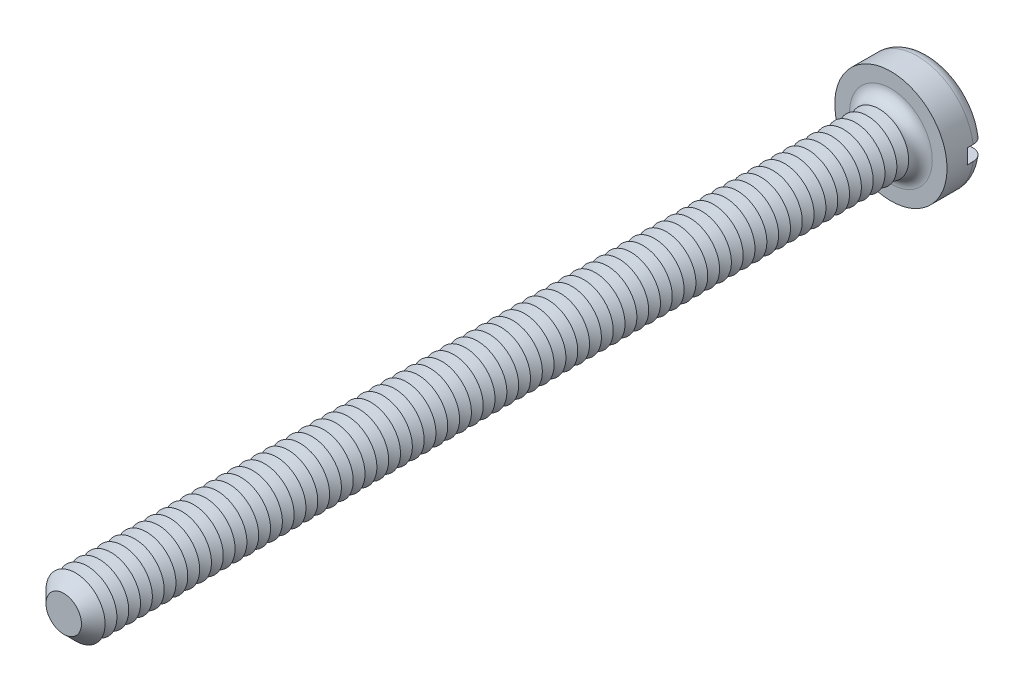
ISO-10303-21;
HEADER;
FILE_DESCRIPTION(('STEP AP214'),'2;1');
FILE_NAME('part.step','',(''),(''),'','','');
FILE_SCHEMA(('AUTOMOTIVE_DESIGN { 1 0 10303 214 1 1 1 1 }'));
ENDSEC;
DATA;
#1=APPLICATION_CONTEXT('core data for automotive mechanical design processes');
#2=APPLICATION_PROTOCOL_DEFINITION('international standard','automotive_design',2000,#1);
#3=PRODUCT_CONTEXT('',#1,'mechanical');
#4=PRODUCT('Part','Part','',(#3));
#5=PRODUCT_RELATED_PRODUCT_CATEGORY('part','',(#4));
#6=PRODUCT_DEFINITION_FORMATION('','',#4);
#7=PRODUCT_DEFINITION_CONTEXT('part definition',#1,'design');
#8=PRODUCT_DEFINITION('design','',#6,#7);
#9=PRODUCT_DEFINITION_SHAPE('','',#8);
#10=(LENGTH_UNIT() NAMED_UNIT(*) SI_UNIT(.MILLI.,.METRE.));
#11=(NAMED_UNIT(*) PLANE_ANGLE_UNIT() SI_UNIT($,.RADIAN.));
#12=(NAMED_UNIT(*) SI_UNIT($,.STERADIAN.) SOLID_ANGLE_UNIT());
#13=UNCERTAINTY_MEASURE_WITH_UNIT(LENGTH_MEASURE(1.E-05),#10,'distance_accuracy_value','');
#14=(GEOMETRIC_REPRESENTATION_CONTEXT(3) GLOBAL_UNCERTAINTY_ASSIGNED_CONTEXT((#13)) GLOBAL_UNIT_ASSIGNED_CONTEXT((#10,
#11,#12)) REPRESENTATION_CONTEXT('',''));
#15=CARTESIAN_POINT('',(0.,0.,0.));
#16=DIRECTION('',(0.,0.,1.));
#17=DIRECTION('',(1.,0.,0.));
#18=AXIS2_PLACEMENT_3D('',#15,#16,#17);
#19=CARTESIAN_POINT('',(0.,0.,-1.3));
#20=DIRECTION('',(0.,0.,1.));
#21=DIRECTION('',(1.,0.,0.));
#22=AXIS2_PLACEMENT_3D('',#19,#20,#21);
#23=PLANE('',#22);
#24=CARTESIAN_POINT('',(0.,0.,-1.3));
#25=DIRECTION('',(0.,0.,1.));
#26=DIRECTION('',(1.,0.,0.));
#27=AXIS2_PLACEMENT_3D('',#24,#25,#26);
#28=CIRCLE('',#27,1.5);
#29=CARTESIAN_POINT('',(-1.4790199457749,0.25,-1.3));
#30=VERTEX_POINT('',#29);
#31=CARTESIAN_POINT('',(1.4790199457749,0.25,-1.3));
#32=VERTEX_POINT('',#31);
#33=EDGE_CURVE('E116',#30,#32,#28,.F.);
#34=ORIENTED_EDGE('',*,*,#33,.T.);
#35=DIRECTION('',(1.,0.,0.));
#36=VECTOR('',#35,1.);
#37=CARTESIAN_POINT('',(-1.9,0.25,-1.3));
#38=LINE('',#37,#36);
#39=EDGE_CURVE('E111',#30,#32,#38,.T.);
#40=ORIENTED_EDGE('',*,*,#39,.F.);
#41=EDGE_LOOP('',(#34,#40));
#42=FACE_BOUND('',#41,.T.);
#43=ADVANCED_FACE('F39',(#42),#23,.F.);
#44=CARTESIAN_POINT('',(0.,0.,-0.9));
#45=DIRECTION('',(0.,0.,1.));
#46=DIRECTION('',(1.,0.,0.));
#47=AXIS2_PLACEMENT_3D('',#44,#45,#46);
#48=TOROIDAL_SURFACE('',#47,1.5,0.4);
#49=CARTESIAN_POINT('',(-1.8150392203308,0.25,-1.12284384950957));
#50=CARTESIAN_POINT('',(-1.80236980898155,0.25,-1.14155059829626));
#51=CARTESIAN_POINT('',(-1.78809920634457,0.25,-1.15919399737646));
#52=CARTESIAN_POINT('',(-1.75677844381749,0.25,-1.19184073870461));
#53=CARTESIAN_POINT('',(-1.73972468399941,0.25,-1.20684060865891));
#54=CARTESIAN_POINT('',(-1.70336024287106,0.25,-1.23375848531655));
#55=CARTESIAN_POINT('',(-1.68405164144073,0.25,-1.24567930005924));
#56=CARTESIAN_POINT('',(-1.64372549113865,0.25,-1.26613528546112));
#57=CARTESIAN_POINT('',(-1.6227083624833,0.25,-1.27467128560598));
#58=CARTESIAN_POINT('',(-1.57937988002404,0.25,-1.2881995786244));
#59=CARTESIAN_POINT('',(-1.55705957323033,0.25,-1.29316318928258));
#60=CARTESIAN_POINT('',(-1.51190394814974,0.25,-1.29931753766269));
#61=CARTESIAN_POINT('',(-1.48906857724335,0.25,-1.3005078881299));
#62=CARTESIAN_POINT('',(-1.4432641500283,0.25,-1.29909058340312));
#63=CARTESIAN_POINT('',(-1.42029638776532,0.25,-1.29644099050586));
#64=CARTESIAN_POINT('',(-1.37512297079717,0.25,-1.28735146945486));
#65=CARTESIAN_POINT('',(-1.3529173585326,0.25,-1.28091133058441));
#66=CARTESIAN_POINT('',(-1.30974098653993,0.25,-1.26436295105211));
#67=CARTESIAN_POINT('',(-1.28877978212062,0.25,-1.25422975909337));
#68=CARTESIAN_POINT('',(-1.24886205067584,0.25,-1.23057736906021));
#69=CARTESIAN_POINT('',(-1.22990554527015,0.25,-1.21705813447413));
#70=CARTESIAN_POINT('',(-1.19461911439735,0.25,-1.18704970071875));
#71=CARTESIAN_POINT('',(-1.17828051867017,0.25,-1.17057070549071));
#72=CARTESIAN_POINT('',(-1.14865897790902,0.25,-1.13506201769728));
#73=CARTESIAN_POINT('',(-1.13537576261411,0.25,-1.11603255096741));
#74=CARTESIAN_POINT('',(-1.11249827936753,0.25,-1.07630328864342));
#75=CARTESIAN_POINT('',(-1.10284494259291,0.25,-1.05563752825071));
#76=CARTESIAN_POINT('',(-1.08724024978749,0.25,-1.01295282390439));
#77=CARTESIAN_POINT('',(-1.08128829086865,0.25,-0.990934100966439));
#78=CARTESIAN_POINT('',(-1.07339124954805,0.25,-0.946722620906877));
#79=CARTESIAN_POINT('',(-1.07135558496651,0.25,-0.924546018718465));
#80=CARTESIAN_POINT('',(-1.07108722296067,0.25,-0.880170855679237));
#81=CARTESIAN_POINT('',(-1.07285419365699,0.25,-0.857972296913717));
#82=CARTESIAN_POINT('',(-1.0800838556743,0.25,-0.814463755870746));
#83=CARTESIAN_POINT('',(-1.08550159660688,0.25,-0.793146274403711));
#84=CARTESIAN_POINT('',(-1.09980522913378,0.25,-0.751709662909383));
#85=CARTESIAN_POINT('',(-1.10869126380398,0.25,-0.731590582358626));
#86=CARTESIAN_POINT('',(-1.12975121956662,0.25,-0.692901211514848));
#87=CARTESIAN_POINT('',(-1.14195627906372,0.25,-0.674347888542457));
#88=CARTESIAN_POINT('',(-1.1692428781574,0.25,-0.639494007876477));
#89=CARTESIAN_POINT('',(-1.18432473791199,0.25,-0.623193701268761));
#90=CARTESIAN_POINT('',(-1.21730350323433,0.25,-0.592916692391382));
#91=CARTESIAN_POINT('',(-1.23525650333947,0.25,-0.579001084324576));
#92=CARTESIAN_POINT('',(-1.27320799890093,0.25,-0.554314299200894));
#93=CARTESIAN_POINT('',(-1.2932067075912,0.25,-0.543543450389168));
#94=CARTESIAN_POINT('',(-1.33509120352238,0.25,-0.525253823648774));
#95=CARTESIAN_POINT('',(-1.35700545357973,0.25,-0.517800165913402));
#96=CARTESIAN_POINT('',(-1.401770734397,0.25,-0.506652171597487));
#97=CARTESIAN_POINT('',(-1.42462180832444,0.25,-0.502958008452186));
#98=CARTESIAN_POINT('',(-1.4707602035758,0.25,-0.499429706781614));
#99=CARTESIAN_POINT('',(-1.49404932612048,0.25,-0.499619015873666));
#100=CARTESIAN_POINT('',(-1.54026206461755,0.25,-0.50392615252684));
#101=CARTESIAN_POINT('',(-1.56318568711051,0.25,-0.508043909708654));
#102=CARTESIAN_POINT('',(-1.60788420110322,0.25,-0.520077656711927));
#103=CARTESIAN_POINT('',(-1.6296645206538,0.25,-0.527973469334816));
#104=CARTESIAN_POINT('',(-1.67156889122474,0.25,-0.547348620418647));
#105=CARTESIAN_POINT('',(-1.69169302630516,0.25,-0.558827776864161));
#106=CARTESIAN_POINT('',(-1.72948251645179,0.25,-0.584913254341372));
#107=CARTESIAN_POINT('',(-1.74717189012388,0.25,-0.599484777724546));
#108=CARTESIAN_POINT('',(-1.77981909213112,0.25,-0.63142070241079));
#109=CARTESIAN_POINT('',(-1.79477707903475,0.25,-0.648784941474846));
#110=CARTESIAN_POINT('',(-1.82136524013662,0.25,-0.685607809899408));
#111=CARTESIAN_POINT('',(-1.83303003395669,0.25,-0.705041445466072));
#112=CARTESIAN_POINT('',(-1.85289960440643,0.25,-0.745602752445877));
#113=CARTESIAN_POINT('',(-1.86110468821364,0.25,-0.76673027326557));
#114=CARTESIAN_POINT('',(-1.87375648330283,0.25,-0.809891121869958));
#115=CARTESIAN_POINT('',(-1.87823381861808,0.25,-0.831915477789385));
#116=CARTESIAN_POINT('',(-1.88341152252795,0.25,-0.87640983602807));
#117=CARTESIAN_POINT('',(-1.88411103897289,0.25,-0.898879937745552));
#118=CARTESIAN_POINT('',(-1.88171559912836,0.25,-0.943534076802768));
#119=CARTESIAN_POINT('',(-1.87863413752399,0.25,-0.965718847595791));
#120=CARTESIAN_POINT('',(-1.86879153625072,0.25,-1.00923650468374));
#121=CARTESIAN_POINT('',(-1.86203494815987,0.25,-1.03057040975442));
#122=CARTESIAN_POINT('',(-1.84837477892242,0.25,-1.06373797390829));
#123=CARTESIAN_POINT('',(-1.84255723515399,0.25,-1.07603047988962));
#124=CARTESIAN_POINT('',(-1.82969924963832,0.25,-1.09995814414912));
#125=CARTESIAN_POINT('',(-1.82265881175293,0.25,-1.11159330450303));
#126=CARTESIAN_POINT('',(-1.8150392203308,0.25,-1.12284384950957));
#127=B_SPLINE_CURVE_WITH_KNOTS('',3,(#49,#50,#51,#52,#53,#54,#55,#56,#57,#58,#59,#60,#61,#62,
#63,#64,#65,#66,#67,#68,#69,#70,#71,#72,#73,#74,#75,#76,#77,#78,#79,#80,#81,#82,#83,#84,#85,#86,
#87,#88,#89,#90,#91,#92,#93,#94,#95,#96,#97,#98,#99,#100,#101,#102,#103,#104,#105,#106,#107,
#108,#109,#110,#111,#112,#113,#114,#115,#116,#117,#118,#119,#120,#121,#122,#123,#124,#125,#126),
.UNSPECIFIED.,.T.,.F.,(4,2,2,2,2,2,2,2,2,2,2,2,2,2,2,2,2,2,2,2,2,2,2,2,2,2,2,2,2,2,2,2,2,2,2,2,
2,2,4),(0.,0.0677296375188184,0.135547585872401,0.203303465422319,0.27104273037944,
0.339319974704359,0.407604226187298,0.47663988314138,0.545679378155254,0.615194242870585,
0.684709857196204,0.753990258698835,0.82326452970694,0.891356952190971,0.959438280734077,
1.02592503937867,1.0924059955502,1.15808300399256,1.2237627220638,1.29008126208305,
1.35640718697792,1.4242376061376,1.49207510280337,1.5611911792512,1.63031044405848,
1.69984715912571,1.76938262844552,1.8385508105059,1.90771547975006,1.97613962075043,
2.04455978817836,2.11223135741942,2.17989691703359,2.24700094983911,2.31412011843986,
2.38100042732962,2.44779809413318,2.48853193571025,2.52926564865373),.UNSPECIFIED.);
#128=CARTESIAN_POINT('',(-1.88348082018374,0.25,-0.9));
#129=VERTEX_POINT('',#128);
#130=EDGE_CURVE('E723',#129,#30,#127,.T.);
#131=ORIENTED_EDGE('',*,*,#130,.F.);
#132=CARTESIAN_POINT('',(0.,0.,-0.9));
#133=DIRECTION('',(0.,0.,1.));
#134=DIRECTION('',(1.,0.,0.));
#135=AXIS2_PLACEMENT_3D('',#132,#133,#134);
#136=CIRCLE('',#135,1.9);
#137=CARTESIAN_POINT('',(1.88348082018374,0.25,-0.9));
#138=VERTEX_POINT('',#137);
#139=EDGE_CURVE('E125',#138,#129,#136,.T.);
#140=ORIENTED_EDGE('',*,*,#139,.F.);
#141=CARTESIAN_POINT('',(1.11362660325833,0.25,-1.07710243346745));
#142=CARTESIAN_POINT('',(1.12388366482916,0.25,-1.09736755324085));
#143=CARTESIAN_POINT('',(1.13589127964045,0.25,-1.11676768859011));
#144=CARTESIAN_POINT('',(1.16301945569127,0.25,-1.15328107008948));
#145=CARTESIAN_POINT('',(1.17814463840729,0.25,-1.17039085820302));
#146=CARTESIAN_POINT('',(1.21101661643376,0.25,-1.20182395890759));
#147=CARTESIAN_POINT('',(1.22875976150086,0.25,-1.21615108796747));
#148=CARTESIAN_POINT('',(1.26636392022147,0.25,-1.24166932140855));
#149=CARTESIAN_POINT('',(1.28622436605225,0.25,-1.25286126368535));
#150=CARTESIAN_POINT('',(1.32781377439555,0.25,-1.27196191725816));
#151=CARTESIAN_POINT('',(1.34956550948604,0.25,-1.27982107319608));
#152=CARTESIAN_POINT('',(1.39407620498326,0.25,-1.29180513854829));
#153=CARTESIAN_POINT('',(1.41683526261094,0.25,-1.29592968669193));
#154=CARTESIAN_POINT('',(1.46288034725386,0.25,-1.3003367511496));
#155=CARTESIAN_POINT('',(1.48616890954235,0.25,-1.30059287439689));
#156=CARTESIAN_POINT('',(1.53245605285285,0.25,-1.29717239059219));
#157=CARTESIAN_POINT('',(1.55545463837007,0.25,-1.29349584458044));
#158=CARTESIAN_POINT('',(1.60038828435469,0.25,-1.28232271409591));
#159=CARTESIAN_POINT('',(1.62232790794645,0.25,-1.27484449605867));
#160=CARTESIAN_POINT('',(1.66461970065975,0.25,-1.25627203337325));
#161=CARTESIAN_POINT('',(1.68497195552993,0.25,-1.24517798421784));
#162=CARTESIAN_POINT('',(1.72328060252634,0.25,-1.21981269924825));
#163=CARTESIAN_POINT('',(1.74126001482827,0.25,-1.2055762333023));
#164=CARTESIAN_POINT('',(1.77453973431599,0.25,-1.17425606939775));
#165=CARTESIAN_POINT('',(1.78984019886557,0.25,-1.1571725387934));
#166=CARTESIAN_POINT('',(1.81715014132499,0.25,-1.12084732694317));
#167=CARTESIAN_POINT('',(1.82919410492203,0.25,-1.10163156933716));
#168=CARTESIAN_POINT('',(1.84985315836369,0.25,-1.06143759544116));
#169=CARTESIAN_POINT('',(1.85846842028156,0.25,-1.04045946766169));
#170=CARTESIAN_POINT('',(1.87195437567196,0.25,-0.997526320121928));
#171=CARTESIAN_POINT('',(1.87685590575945,0.25,-0.975580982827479));
#172=CARTESIAN_POINT('',(1.88288741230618,0.25,-0.931178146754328));
#173=CARTESIAN_POINT('',(1.88401750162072,0.25,-0.908720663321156));
#174=CARTESIAN_POINT('',(1.88247598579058,0.25,-0.864033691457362));
#175=CARTESIAN_POINT('',(1.87982069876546,0.25,-0.841803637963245));
#176=CARTESIAN_POINT('',(1.87081646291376,0.25,-0.798104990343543));
#177=CARTESIAN_POINT('',(1.86446754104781,0.25,-0.776636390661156));
#178=CARTESIAN_POINT('',(1.84826063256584,0.25,-0.735060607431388));
#179=CARTESIAN_POINT('',(1.83840161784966,0.25,-0.714953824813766));
#180=CARTESIAN_POINT('',(1.81546327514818,0.25,-0.676670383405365));
#181=CARTESIAN_POINT('',(1.80238389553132,0.25,-0.658493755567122));
#182=CARTESIAN_POINT('',(1.77331327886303,0.25,-0.62448916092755));
#183=CARTESIAN_POINT('',(1.75730833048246,0.25,-0.608672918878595));
#184=CARTESIAN_POINT('',(1.72289038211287,0.25,-0.579924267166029));
#185=CARTESIAN_POINT('',(1.70447729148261,0.25,-0.566991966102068));
#186=CARTESIAN_POINT('',(1.66559643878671,0.25,-0.544254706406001));
#187=CARTESIAN_POINT('',(1.64511218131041,0.25,-0.53447796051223));
#188=CARTESIAN_POINT('',(1.60280554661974,0.25,-0.518459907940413));
#189=CARTESIAN_POINT('',(1.58098309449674,0.25,-0.512218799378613));
#190=CARTESIAN_POINT('',(1.53636184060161,0.25,-0.503375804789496));
#191=CARTESIAN_POINT('',(1.51355490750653,0.25,-0.500814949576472));
#192=CARTESIAN_POINT('',(1.46783245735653,0.25,-0.499516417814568));
#193=CARTESIAN_POINT('',(1.44491693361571,0.25,-0.500778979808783));
#194=CARTESIAN_POINT('',(1.39937748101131,0.25,-0.50711284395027));
#195=CARTESIAN_POINT('',(1.37675897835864,0.25,-0.512223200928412));
#196=CARTESIAN_POINT('',(1.33269286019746,0.25,-0.526151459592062));
#197=CARTESIAN_POINT('',(1.31124530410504,0.25,-0.534969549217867));
#198=CARTESIAN_POINT('',(1.27004097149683,0.25,-0.556118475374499));
#199=CARTESIAN_POINT('',(1.25029179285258,0.25,-0.568464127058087));
#200=CARTESIAN_POINT('',(1.21316554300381,0.25,-0.59631968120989));
#201=CARTESIAN_POINT('',(1.19578844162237,0.25,-0.611829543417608));
#202=CARTESIAN_POINT('',(1.16406059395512,0.25,-0.645459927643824));
#203=CARTESIAN_POINT('',(1.14968747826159,0.25,-0.663559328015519));
#204=CARTESIAN_POINT('',(1.12425968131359,0.25,-0.70195566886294));
#205=CARTESIAN_POINT('',(1.11320445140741,0.25,-0.722252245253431));
#206=CARTESIAN_POINT('',(1.09497726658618,0.25,-0.764020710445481));
#207=CARTESIAN_POINT('',(1.08772970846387,0.25,-0.785459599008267));
#208=CARTESIAN_POINT('',(1.07702618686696,0.25,-0.829269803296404));
#209=CARTESIAN_POINT('',(1.07357062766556,0.25,-0.851641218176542));
#210=CARTESIAN_POINT('',(1.07060826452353,0.25,-0.896160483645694));
#211=CARTESIAN_POINT('',(1.07101876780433,0.25,-0.918302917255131));
#212=CARTESIAN_POINT('',(1.07557730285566,0.25,-0.962179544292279));
#213=CARTESIAN_POINT('',(1.07972048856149,0.25,-0.983914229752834));
#214=CARTESIAN_POINT('',(1.08912066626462,0.25,-1.01754924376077));
#215=CARTESIAN_POINT('',(1.09320341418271,0.25,-1.02979035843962));
#216=CARTESIAN_POINT('',(1.10254493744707,0.25,-1.05381470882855));
#217=CARTESIAN_POINT('',(1.10780368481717,0.25,-1.06559795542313));
#218=CARTESIAN_POINT('',(1.11362660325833,0.25,-1.07710243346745));
#219=B_SPLINE_CURVE_WITH_KNOTS('',3,(#141,#142,#143,#144,#145,#146,#147,#148,#149,#150,#151,
#152,#153,#154,#155,#156,#157,#158,#159,#160,#161,#162,#163,#164,#165,#166,#167,#168,#169,#170,
#171,#172,#173,#174,#175,#176,#177,#178,#179,#180,#181,#182,#183,#184,#185,#186,#187,#188,#189,
#190,#191,#192,#193,#194,#195,#196,#197,#198,#199,#200,#201,#202,#203,#204,#205,#206,#207,#208,
#209,#210,#211,#212,#213,#214,#215,#216,#217,#218),.UNSPECIFIED.,.T.,.F.,(4,2,2,2,2,2,2,2,2,2,2,
2,2,2,2,2,2,2,2,2,2,2,2,2,2,2,2,2,2,2,2,2,2,2,2,2,2,2,4),(0.,0.0680907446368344,
0.136283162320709,0.204381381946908,0.272461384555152,0.341520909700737,0.410587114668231,
0.480124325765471,0.549660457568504,0.618863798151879,0.688063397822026,0.756532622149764,
0.824997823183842,0.892706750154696,0.960412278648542,1.02754926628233,1.09468424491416,
1.16153068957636,1.22837664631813,1.29524219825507,1.36210882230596,1.42929726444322,
1.49648823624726,1.56426429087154,1.63204414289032,1.70057395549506,1.76910804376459,
1.83834728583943,1.90759003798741,1.97712798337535,2.0466650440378,2.11566422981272,
2.18465199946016,2.25221259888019,2.3197804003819,2.38590630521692,2.45194648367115,
2.49060241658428,2.5292574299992),.UNSPECIFIED.);
#220=EDGE_CURVE('E725',#32,#138,#219,.T.);
#221=ORIENTED_EDGE('',*,*,#220,.F.);
#222=ORIENTED_EDGE('',*,*,#33,.F.);
#223=EDGE_LOOP('',(#131,#140,#221,#222));
#224=FACE_BOUND('',#223,.T.);
#225=ADVANCED_FACE('F707',(#224),#48,.T.);
#226=CARTESIAN_POINT('',(0.,0.,-1.3));
#227=DIRECTION('',(0.,0.,1.));
#228=DIRECTION('',(1.,0.,0.));
#229=AXIS2_PLACEMENT_3D('',#226,#227,#228);
#230=CYLINDRICAL_SURFACE('',#229,1.9);
#231=DIRECTION('',(0.,0.,1.));
#232=VECTOR('',#231,1.);
#233=CARTESIAN_POINT('',(1.88348082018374,0.25,-1.3));
#234=LINE('',#233,#232);
#235=CARTESIAN_POINT('',(1.88348082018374,0.25,-0.7));
#236=VERTEX_POINT('',#235);
#237=EDGE_CURVE('E741',#138,#236,#234,.T.);
#238=ORIENTED_EDGE('',*,*,#237,.F.);
#239=ORIENTED_EDGE('',*,*,#139,.T.);
#240=DIRECTION('',(0.,0.,1.));
#241=VECTOR('',#240,1.);
#242=CARTESIAN_POINT('',(-1.88348082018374,0.25,-1.3));
#243=LINE('',#242,#241);
#244=CARTESIAN_POINT('',(-1.88348082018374,0.25,-0.7));
#245=VERTEX_POINT('',#244);
#246=EDGE_CURVE('E63',#245,#129,#243,.F.);
#247=ORIENTED_EDGE('',*,*,#246,.F.);
#248=CARTESIAN_POINT('',(0.,0.,-0.7));
#249=DIRECTION('',(0.,0.,-1.));
#250=DIRECTION('',(-1.,0.,0.));
#251=AXIS2_PLACEMENT_3D('',#248,#249,#250);
#252=CIRCLE('',#251,1.9);
#253=CARTESIAN_POINT('',(-1.88348082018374,-0.25,-0.7));
#254=VERTEX_POINT('',#253);
#255=EDGE_CURVE('E43',#245,#254,#252,.F.);
#256=ORIENTED_EDGE('',*,*,#255,.T.);
#257=DIRECTION('',(0.,0.,1.));
#258=VECTOR('',#257,1.);
#259=CARTESIAN_POINT('',(-1.88348082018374,-0.25,-1.3));
#260=LINE('',#259,#258);
#261=CARTESIAN_POINT('',(-1.88348082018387,-0.25,-0.899999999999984));
#262=VERTEX_POINT('',#261);
#263=EDGE_CURVE('E738',#262,#254,#260,.T.);
#264=ORIENTED_EDGE('',*,*,#263,.F.);
#265=CARTESIAN_POINT('',(1.88348082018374,-0.25,-0.9));
#266=VERTEX_POINT('',#265);
#267=EDGE_CURVE('E127',#262,#266,#136,.T.);
#268=ORIENTED_EDGE('',*,*,#267,.T.);
#269=DIRECTION('',(0.,0.,1.));
#270=VECTOR('',#269,1.);
#271=CARTESIAN_POINT('',(1.88348082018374,-0.25,-1.3));
#272=LINE('',#271,#270);
#273=CARTESIAN_POINT('',(1.88348082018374,-0.25,-0.7));
#274=VERTEX_POINT('',#273);
#275=EDGE_CURVE('E55',#274,#266,#272,.F.);
#276=ORIENTED_EDGE('',*,*,#275,.F.);
#277=EDGE_CURVE('E11',#274,#236,#252,.F.);
#278=ORIENTED_EDGE('',*,*,#277,.T.);
#279=EDGE_LOOP('',(#238,#239,#247,#256,#264,#268,#276,#278));
#280=FACE_BOUND('',#279,.T.);
#281=CARTESIAN_POINT('',(0.,0.,0.));
#282=DIRECTION('',(0.,0.,1.));
#283=DIRECTION('',(1.,0.,0.));
#284=AXIS2_PLACEMENT_3D('',#281,#282,#283);
#285=CIRCLE('',#284,1.9);
#286=CARTESIAN_POINT('',(1.9,0.,0.));
#287=VERTEX_POINT('',#286);
#288=EDGE_CURVE('E744',#287,#287,#285,.T.);
#289=ORIENTED_EDGE('',*,*,#288,.F.);
#290=EDGE_LOOP('',(#289));
#291=FACE_BOUND('',#290,.T.);
#292=ADVANCED_FACE('F703',(#280,#291),#230,.T.);
#293=CARTESIAN_POINT('',(1.4790199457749,-0.25,-1.3));
#294=VERTEX_POINT('',#293);
#295=CARTESIAN_POINT('',(-1.4790199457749,-0.25,-1.3));
#296=VERTEX_POINT('',#295);
#297=EDGE_CURVE('E109',#294,#296,#28,.F.);
#298=ORIENTED_EDGE('',*,*,#297,.T.);
#299=DIRECTION('',(-1.,0.,0.));
#300=VECTOR('',#299,1.);
#301=CARTESIAN_POINT('',(-1.9,-0.25,-1.3));
#302=LINE('',#301,#300);
#303=EDGE_CURVE('E96',#294,#296,#302,.T.);
#304=ORIENTED_EDGE('',*,*,#303,.F.);
#305=EDGE_LOOP('',(#298,#304));
#306=FACE_BOUND('',#305,.T.);
#307=ADVANCED_FACE('F108',(#306),#23,.F.);
#308=CARTESIAN_POINT('',(0.,0.,0.));
#309=DIRECTION('',(0.,0.,1.));
#310=DIRECTION('',(1.,0.,0.));
#311=AXIS2_PLACEMENT_3D('',#308,#309,#310);
#312=PLANE('',#311);
#313=CARTESIAN_POINT('',(0.,0.,0.));
#314=DIRECTION('',(0.,0.,1.));
#315=DIRECTION('',(1.,0.,0.));
#316=AXIS2_PLACEMENT_3D('',#313,#314,#315);
#317=CIRCLE('',#316,1.4);
#318=CARTESIAN_POINT('',(1.4,0.,0.));
#319=VERTEX_POINT('',#318);
#320=EDGE_CURVE('E115',#319,#319,#317,.F.);
#321=ORIENTED_EDGE('',*,*,#320,.T.);
#322=EDGE_LOOP('',(#321));
#323=FACE_BOUND('',#322,.T.);
#324=ORIENTED_EDGE('',*,*,#288,.T.);
#325=EDGE_LOOP('',(#324));
#326=FACE_BOUND('',#325,.T.);
#327=ADVANCED_FACE('F702',(#323,#326),#312,.T.);
#328=CARTESIAN_POINT('',(-1.8150392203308,-0.25,-1.12284384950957));
#329=CARTESIAN_POINT('',(-1.82756185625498,-0.25,-1.10435021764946));
#330=CARTESIAN_POINT('',(-1.83853807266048,-0.25,-1.08479072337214));
#331=CARTESIAN_POINT('',(-1.85706233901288,-0.25,-1.04409188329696));
#332=CARTESIAN_POINT('',(-1.86460655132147,-0.25,-1.02295079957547));
#333=CARTESIAN_POINT('',(-1.87603074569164,-0.25,-0.979704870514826));
#334=CARTESIAN_POINT('',(-1.87991177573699,-0.25,-0.957600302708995));
#335=CARTESIAN_POINT('',(-1.88389586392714,-0.25,-0.913058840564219));
#336=CARTESIAN_POINT('',(-1.88399981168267,-0.25,-0.890622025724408));
#337=CARTESIAN_POINT('',(-1.88043374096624,-0.25,-0.846104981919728));
#338=CARTESIAN_POINT('',(-1.87677281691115,-0.25,-0.824024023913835));
#339=CARTESIAN_POINT('',(-1.86579880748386,-0.25,-0.780788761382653));
#340=CARTESIAN_POINT('',(-1.85848560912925,-0.25,-0.759634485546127));
#341=CARTESIAN_POINT('',(-1.8404137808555,-0.25,-0.718830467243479));
#342=CARTESIAN_POINT('',(-1.82965205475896,-0.25,-0.699182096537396));
#343=CARTESIAN_POINT('',(-1.80499939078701,-0.25,-0.661958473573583));
#344=CARTESIAN_POINT('',(-1.7911083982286,-0.25,-0.644383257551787));
#345=CARTESIAN_POINT('',(-1.76051564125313,-0.25,-0.611699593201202));
#346=CARTESIAN_POINT('',(-1.74379913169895,-0.25,-0.596604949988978));
#347=CARTESIAN_POINT('',(-1.70808901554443,-0.25,-0.569406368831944));
#348=CARTESIAN_POINT('',(-1.68909532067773,-0.25,-0.557302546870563));
#349=CARTESIAN_POINT('',(-1.64918615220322,-0.25,-0.536307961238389));
#350=CARTESIAN_POINT('',(-1.62825469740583,-0.25,-0.527447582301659));
#351=CARTESIAN_POINT('',(-1.58521203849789,-0.25,-0.513323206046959));
#352=CARTESIAN_POINT('',(-1.5631007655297,-0.25,-0.508059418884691));
#353=CARTESIAN_POINT('',(-1.51806209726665,-0.25,-0.501215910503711));
#354=CARTESIAN_POINT('',(-1.4951283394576,-0.25,-0.499678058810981));
#355=CARTESIAN_POINT('',(-1.4493239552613,-0.25,-0.500434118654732));
#356=CARTESIAN_POINT('',(-1.4264533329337,-0.25,-0.502728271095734));
#357=CARTESIAN_POINT('',(-1.38118643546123,-0.25,-0.511115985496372));
#358=CARTESIAN_POINT('',(-1.35879703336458,-0.25,-0.51724667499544));
#359=CARTESIAN_POINT('',(-1.31535851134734,-0.25,-0.533167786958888));
#360=CARTESIAN_POINT('',(-1.29430945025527,-0.25,-0.542958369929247));
#361=CARTESIAN_POINT('',(-1.25409242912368,-0.25,-0.565968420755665));
#362=CARTESIAN_POINT('',(-1.23493023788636,-0.25,-0.579197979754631));
#363=CARTESIAN_POINT('',(-1.19912477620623,-0.25,-0.608715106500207));
#364=CARTESIAN_POINT('',(-1.18248143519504,-0.25,-0.625002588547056));
#365=CARTESIAN_POINT('',(-1.15237533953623,-0.25,-0.660018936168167));
#366=CARTESIAN_POINT('',(-1.13888343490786,-0.25,-0.678722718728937));
#367=CARTESIAN_POINT('',(-1.115312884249,-0.25,-0.718170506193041));
#368=CARTESIAN_POINT('',(-1.10523377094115,-0.25,-0.738914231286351));
#369=CARTESIAN_POINT('',(-1.08901310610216,-0.25,-0.781372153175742));
#370=CARTESIAN_POINT('',(-1.08279080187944,-0.25,-0.803055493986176));
#371=CARTESIAN_POINT('',(-1.07416105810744,-0.25,-0.847167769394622));
#372=CARTESIAN_POINT('',(-1.07175306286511,-0.25,-0.869596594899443));
#373=CARTESIAN_POINT('',(-1.07084656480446,-0.25,-0.914070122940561));
#374=CARTESIAN_POINT('',(-1.07226874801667,-0.25,-0.936113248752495));
#375=CARTESIAN_POINT('',(-1.07880428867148,-0.25,-0.979644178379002));
#376=CARTESIAN_POINT('',(-1.08391755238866,-0.25,-1.00113199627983));
#377=CARTESIAN_POINT('',(-1.09764616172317,-0.25,-1.04290115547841));
#378=CARTESIAN_POINT('',(-1.10625346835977,-0.25,-1.06318514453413));
#379=CARTESIAN_POINT('',(-1.12669365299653,-0.25,-1.10205584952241));
#380=CARTESIAN_POINT('',(-1.13852679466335,-0.25,-1.12064242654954));
#381=CARTESIAN_POINT('',(-1.16529672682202,-0.25,-1.15594801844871));
#382=CARTESIAN_POINT('',(-1.18028464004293,-0.25,-1.17262825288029));
#383=CARTESIAN_POINT('',(-1.21279183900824,-0.25,-1.20330600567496));
#384=CARTESIAN_POINT('',(-1.23031142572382,-0.25,-1.21730320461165));
#385=CARTESIAN_POINT('',(-1.26781695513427,-0.25,-1.24254670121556));
#386=CARTESIAN_POINT('',(-1.28784999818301,-0.25,-1.25372305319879));
#387=CARTESIAN_POINT('',(-1.3294899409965,-0.25,-1.27260611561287));
#388=CARTESIAN_POINT('',(-1.35109697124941,-0.25,-1.28031253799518));
#389=CARTESIAN_POINT('',(-1.39558575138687,-0.25,-1.29212626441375));
#390=CARTESIAN_POINT('',(-1.4184807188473,-0.25,-1.29618386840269));
#391=CARTESIAN_POINT('',(-1.4646266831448,-0.25,-1.30039947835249));
#392=CARTESIAN_POINT('',(-1.48787767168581,-0.25,-1.30055757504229));
#393=CARTESIAN_POINT('',(-1.53407883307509,-0.25,-1.29695468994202));
#394=CARTESIAN_POINT('',(-1.55702895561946,-0.25,-1.29319306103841));
#395=CARTESIAN_POINT('',(-1.60196718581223,-0.25,-1.28183520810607));
#396=CARTESIAN_POINT('',(-1.62395508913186,-0.25,-1.27423817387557));
#397=CARTESIAN_POINT('',(-1.66614393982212,-0.25,-1.25548646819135));
#398=CARTESIAN_POINT('',(-1.68635782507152,-0.25,-1.24436087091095));
#399=CARTESIAN_POINT('',(-1.72458266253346,-0.25,-1.21884344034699));
#400=CARTESIAN_POINT('',(-1.74259637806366,-0.25,-1.20445577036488));
#401=CARTESIAN_POINT('',(-1.76968989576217,-0.25,-1.1787247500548));
#402=CARTESIAN_POINT('',(-1.77959984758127,-0.25,-1.1682407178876));
#403=CARTESIAN_POINT('',(-1.79823423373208,-0.25,-1.14626700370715));
#404=CARTESIAN_POINT('',(-1.80695867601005,-0.25,-1.1347773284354));
#405=CARTESIAN_POINT('',(-1.8150392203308,-0.25,-1.12284384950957));
#406=B_SPLINE_CURVE_WITH_KNOTS('',3,(#328,#329,#330,#331,#332,#333,#334,#335,#336,#337,#338,
#339,#340,#341,#342,#343,#344,#345,#346,#347,#348,#349,#350,#351,#352,#353,#354,#355,#356,#357,
#358,#359,#360,#361,#362,#363,#364,#365,#366,#367,#368,#369,#370,#371,#372,#373,#374,#375,#376,
#377,#378,#379,#380,#381,#382,#383,#384,#385,#386,#387,#388,#389,#390,#391,#392,#393,#394,#395,
#396,#397,#398,#399,#400,#401,#402,#403,#404,#405),.UNSPECIFIED.,.T.,.F.,(4,2,2,2,2,2,2,2,2,2,2,
2,2,2,2,2,2,2,2,2,2,2,2,2,2,2,2,2,2,2,2,2,2,2,2,2,2,2,4),(0.,0.0669512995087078,
0.133977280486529,0.200984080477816,0.267975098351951,0.334804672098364,0.401636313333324,
0.468528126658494,0.535421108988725,0.602674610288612,0.669930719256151,0.737801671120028,
0.805676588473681,0.87431077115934,0.942949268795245,1.0122625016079,1.08157877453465,
1.15110078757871,1.22062085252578,1.28946987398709,1.35830946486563,1.42565417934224,
1.49298908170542,1.55894041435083,1.62489007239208,1.69068884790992,1.75649300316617,
1.82345932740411,1.89043361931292,1.95893391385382,2.02743989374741,2.09686543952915,
2.16628937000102,2.23572476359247,2.3051748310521,2.3740669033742,2.44287154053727,
2.48607383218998,2.52927583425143),.UNSPECIFIED.);
#407=EDGE_CURVE('E103',#296,#262,#406,.T.);
#408=ORIENTED_EDGE('',*,*,#407,.F.);
#409=ORIENTED_EDGE('',*,*,#297,.F.);
#410=CARTESIAN_POINT('',(1.11362660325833,-0.25,-1.07710243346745));
#411=CARTESIAN_POINT('',(1.10368387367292,-0.25,-1.05745397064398));
#412=CARTESIAN_POINT('',(1.09537204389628,-0.25,-1.0369644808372));
#413=CARTESIAN_POINT('',(1.08229212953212,-0.25,-0.994867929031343));
#414=CARTESIAN_POINT('',(1.07752732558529,-0.25,-0.973259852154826));
#415=CARTESIAN_POINT('',(1.07171197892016,-0.25,-0.929545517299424));
#416=CARTESIAN_POINT('',(1.07066166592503,-0.25,-0.907439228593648));
#417=CARTESIAN_POINT('',(1.07231382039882,-0.25,-0.863372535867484));
#418=CARTESIAN_POINT('',(1.07501551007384,-0.25,-0.841412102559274));
#419=CARTESIAN_POINT('',(1.08404966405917,-0.25,-0.798386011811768));
#420=CARTESIAN_POINT('',(1.09036099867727,-0.25,-0.777315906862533));
#421=CARTESIAN_POINT('',(1.10638973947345,-0.25,-0.736514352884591));
#422=CARTESIAN_POINT('',(1.11610743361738,-0.25,-0.716783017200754));
#423=CARTESIAN_POINT('',(1.13878208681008,-0.25,-0.678952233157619));
#424=CARTESIAN_POINT('',(1.15177705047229,-0.25,-0.660875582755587));
#425=CARTESIAN_POINT('',(1.18055347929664,-0.25,-0.62709692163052));
#426=CARTESIAN_POINT('',(1.19633525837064,-0.25,-0.611395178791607));
#427=CARTESIAN_POINT('',(1.23062926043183,-0.25,-0.582430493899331));
#428=CARTESIAN_POINT('',(1.24919608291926,-0.25,-0.569232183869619));
#429=CARTESIAN_POINT('',(1.28825118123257,-0.25,-0.546076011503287));
#430=CARTESIAN_POINT('',(1.30873964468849,-0.25,-0.536118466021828));
#431=CARTESIAN_POINT('',(1.35144534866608,-0.25,-0.519560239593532));
#432=CARTESIAN_POINT('',(1.3736865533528,-0.25,-0.513021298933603));
#433=CARTESIAN_POINT('',(1.41894945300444,-0.25,-0.503751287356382));
#434=CARTESIAN_POINT('',(1.44197117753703,-0.25,-0.50102036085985));
#435=CARTESIAN_POINT('',(1.48824913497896,-0.25,-0.499449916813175));
#436=CARTESIAN_POINT('',(1.5115059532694,-0.25,-0.500627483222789));
#437=CARTESIAN_POINT('',(1.55748678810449,-0.25,-0.506895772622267));
#438=CARTESIAN_POINT('',(1.58021081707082,-0.25,-0.511986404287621));
#439=CARTESIAN_POINT('',(1.6243247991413,-0.25,-0.525910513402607));
#440=CARTESIAN_POINT('',(1.64572225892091,-0.25,-0.534720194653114));
#441=CARTESIAN_POINT('',(1.68671060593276,-0.25,-0.555845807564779));
#442=CARTESIAN_POINT('',(1.70630159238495,-0.25,-0.568161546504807));
#443=CARTESIAN_POINT('',(1.74289060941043,-0.25,-0.595805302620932));
#444=CARTESIAN_POINT('',(1.75991474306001,-0.25,-0.611098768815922));
#445=CARTESIAN_POINT('',(1.79111916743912,-0.25,-0.644354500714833));
#446=CARTESIAN_POINT('',(1.80529962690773,-0.25,-0.662316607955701));
#447=CARTESIAN_POINT('',(1.83025525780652,-0.25,-0.700191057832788));
#448=CARTESIAN_POINT('',(1.84106535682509,-0.25,-0.720080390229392));
#449=CARTESIAN_POINT('',(1.8591630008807,-0.25,-0.761401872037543));
#450=CARTESIAN_POINT('',(1.86645070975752,-0.25,-0.782833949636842));
#451=CARTESIAN_POINT('',(1.87724305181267,-0.25,-0.826454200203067));
#452=CARTESIAN_POINT('',(1.88077646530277,-0.25,-0.848635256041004));
#453=CARTESIAN_POINT('',(1.88405487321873,-0.25,-0.89327539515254));
#454=CARTESIAN_POINT('',(1.88379996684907,-0.25,-0.915734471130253));
#455=CARTESIAN_POINT('',(1.87951702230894,-0.25,-0.96021054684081));
#456=CARTESIAN_POINT('',(1.87550211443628,-0.25,-0.982228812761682));
#457=CARTESIAN_POINT('',(1.86383665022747,-0.25,-1.0252797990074));
#458=CARTESIAN_POINT('',(1.85618610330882,-0.25,-1.04631252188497));
#459=CARTESIAN_POINT('',(1.83746332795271,-0.25,-1.08682395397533));
#460=CARTESIAN_POINT('',(1.82638722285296,-0.25,-1.10630087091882));
#461=CARTESIAN_POINT('',(1.80113946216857,-0.25,-1.14313202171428));
#462=CARTESIAN_POINT('',(1.78696774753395,-0.25,-1.1604862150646));
#463=CARTESIAN_POINT('',(1.75585044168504,-0.25,-1.19268694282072));
#464=CARTESIAN_POINT('',(1.73888979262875,-0.25,-1.20751892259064));
#465=CARTESIAN_POINT('',(1.7027387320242,-0.25,-1.23415579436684));
#466=CARTESIAN_POINT('',(1.68354822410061,-0.25,-1.24596055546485));
#467=CARTESIAN_POINT('',(1.64329341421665,-0.25,-1.26632784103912));
#468=CARTESIAN_POINT('',(1.62221336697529,-0.25,-1.27485924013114));
#469=CARTESIAN_POINT('',(1.5789301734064,-0.25,-1.28830571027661));
#470=CARTESIAN_POINT('',(1.55672695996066,-0.25,-1.29322056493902));
#471=CARTESIAN_POINT('',(1.5115614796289,-0.25,-1.29935191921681));
#472=CARTESIAN_POINT('',(1.4885934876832,-0.25,-1.30052625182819));
#473=CARTESIAN_POINT('',(1.44278240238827,-0.25,-1.2990417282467));
#474=CARTESIAN_POINT('',(1.41993931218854,-0.25,-1.29638277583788));
#475=CARTESIAN_POINT('',(1.37479511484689,-0.25,-1.28727159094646));
#476=CARTESIAN_POINT('',(1.35250125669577,-0.25,-1.2807834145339));
#477=CARTESIAN_POINT('',(1.30930729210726,-0.25,-1.2641644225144));
#478=CARTESIAN_POINT('',(1.2884075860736,-0.25,-1.25403256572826));
#479=CARTESIAN_POINT('',(1.24854853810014,-0.25,-1.23036781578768));
#480=CARTESIAN_POINT('',(1.22959511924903,-0.25,-1.21682495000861));
#481=CARTESIAN_POINT('',(1.19427766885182,-0.25,-1.18672803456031));
#482=CARTESIAN_POINT('',(1.17791048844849,-0.25,-1.170177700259));
#483=CARTESIAN_POINT('',(1.15346856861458,-0.25,-1.14079355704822));
#484=CARTESIAN_POINT('',(1.14449891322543,-0.25,-1.12869247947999));
#485=CARTESIAN_POINT('',(1.12797460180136,-0.25,-1.10355927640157));
#486=CARTESIAN_POINT('',(1.1204199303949,-0.25,-1.09052716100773));
#487=CARTESIAN_POINT('',(1.11362660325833,-0.25,-1.07710243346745));
#488=B_SPLINE_CURVE_WITH_KNOTS('',3,(#410,#411,#412,#413,#414,#415,#416,#417,#418,#419,#420,
#421,#422,#423,#424,#425,#426,#427,#428,#429,#430,#431,#432,#433,#434,#435,#436,#437,#438,#439,
#440,#441,#442,#443,#444,#445,#446,#447,#448,#449,#450,#451,#452,#453,#454,#455,#456,#457,#458,
#459,#460,#461,#462,#463,#464,#465,#466,#467,#468,#469,#470,#471,#472,#473,#474,#475,#476,#477,
#478,#479,#480,#481,#482,#483,#484,#485,#486,#487),.UNSPECIFIED.,.T.,.F.,(4,2,2,2,2,2,2,2,2,2,2,
2,2,2,2,2,2,2,2,2,2,2,2,2,2,2,2,2,2,2,2,2,2,2,2,2,2,2,4),(0.,0.0660089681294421,
0.132078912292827,0.198152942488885,0.26421327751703,0.329890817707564,0.395573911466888,
0.462056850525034,0.528547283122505,0.596571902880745,0.664603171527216,0.733823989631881,
0.803047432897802,0.872573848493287,0.94209864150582,1.01118516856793,1.08026789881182,
1.14859228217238,1.21691261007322,1.28449938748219,1.35208302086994,1.41914473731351,
1.48620469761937,1.55303134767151,1.61985782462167,1.68676020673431,1.75366386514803,
1.82094137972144,1.88822180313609,1.95612699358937,2.0240362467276,2.09270838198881,
2.16138224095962,2.23071121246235,2.30006001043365,2.36961396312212,2.4390825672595,
2.48418340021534,2.52928374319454),.UNSPECIFIED.);
#489=EDGE_CURVE('E92',#266,#294,#488,.T.);
#490=ORIENTED_EDGE('',*,*,#489,.F.);
#491=ORIENTED_EDGE('',*,*,#267,.F.);
#492=EDGE_LOOP('',(#408,#409,#490,#491));
#493=FACE_BOUND('',#492,.T.);
#494=ADVANCED_FACE('F113',(#493),#48,.T.);
#495=CARTESIAN_POINT('',(0.,0.,0.400000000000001));
#496=DIRECTION('',(0.,0.,1.));
#497=DIRECTION('',(1.,0.,0.));
#498=AXIS2_PLACEMENT_3D('',#495,#496,#497);
#499=TOROIDAL_SURFACE('',#498,1.4,0.4);
#500=ORIENTED_EDGE('',*,*,#320,.F.);
#501=EDGE_LOOP('',(#500));
#502=FACE_BOUND('',#501,.T.);
#503=CARTESIAN_POINT('',(0.,0.,0.400000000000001));
#504=DIRECTION('',(0.,0.,-1.));
#505=DIRECTION('',(-1.,0.,0.));
#506=AXIS2_PLACEMENT_3D('',#503,#504,#505);
#507=CIRCLE('',#506,1.);
#508=CARTESIAN_POINT('',(-1.,0.,0.400000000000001));
#509=VERTEX_POINT('',#508);
#510=EDGE_CURVE('E750',#509,#509,#507,.T.);
#511=ORIENTED_EDGE('',*,*,#510,.T.);
#512=EDGE_LOOP('',(#511));
#513=FACE_BOUND('',#512,.T.);
#514=ADVANCED_FACE('F695',(#502,#513),#499,.F.);
#515=CARTESIAN_POINT('',(0.,0.,0.600000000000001));
#516=DIRECTION('',(0.,0.,-1.));
#517=DIRECTION('',(-1.,0.,0.));
#518=AXIS2_PLACEMENT_3D('',#515,#516,#517);
#519=CONICAL_SURFACE('',#518,0.653589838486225,1.0471975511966);
#520=ORIENTED_EDGE('',*,*,#510,.F.);
#521=EDGE_LOOP('',(#520));
#522=FACE_BOUND('',#521,.T.);
#523=CARTESIAN_POINT('',(0.,0.,0.600000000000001));
#524=DIRECTION('',(0.,0.,-1.));
#525=DIRECTION('',(-1.,0.,0.));
#526=AXIS2_PLACEMENT_3D('',#523,#524,#525);
#527=CIRCLE('',#526,0.653589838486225);
#528=CARTESIAN_POINT('',(-0.653589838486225,0.,0.600000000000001));
#529=VERTEX_POINT('',#528);
#530=EDGE_CURVE('E757',#529,#529,#527,.T.);
#531=ORIENTED_EDGE('',*,*,#530,.T.);
#532=EDGE_LOOP('',(#531));
#533=FACE_BOUND('',#532,.T.);
#534=ADVANCED_FACE('F691',(#522,#533),#519,.T.);
#535=CARTESIAN_POINT('',(0.,0.,0.800000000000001));
#536=DIRECTION('',(0.,0.,1.));
#537=DIRECTION('',(1.,0.,0.));
#538=AXIS2_PLACEMENT_3D('',#535,#536,#537);
#539=CONICAL_SURFACE('',#538,1.,1.0471975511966);
#540=ORIENTED_EDGE('',*,*,#530,.F.);
#541=EDGE_LOOP('',(#540));
#542=FACE_BOUND('',#541,.T.);
#543=CARTESIAN_POINT('',(0.,0.,0.800000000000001));
#544=DIRECTION('',(0.,0.,-1.));
#545=DIRECTION('',(-1.,0.,0.));
#546=AXIS2_PLACEMENT_3D('',#543,#544,#545);
#547=CIRCLE('',#546,1.);
#548=CARTESIAN_POINT('',(-1.,0.,0.800000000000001));
#549=VERTEX_POINT('',#548);
#550=EDGE_CURVE('E763',#549,#549,#547,.T.);
#551=ORIENTED_EDGE('',*,*,#550,.T.);
#552=EDGE_LOOP('',(#551));
#553=FACE_BOUND('',#552,.T.);
#554=ADVANCED_FACE('F687',(#542,#553),#539,.T.);
#555=CARTESIAN_POINT('',(0.,0.,1.));
#556=DIRECTION('',(0.,0.,-1.));
#557=DIRECTION('',(-1.,0.,0.));
#558=AXIS2_PLACEMENT_3D('',#555,#556,#557);
#559=CONICAL_SURFACE('',#558,0.653589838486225,1.0471975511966);
#560=ORIENTED_EDGE('',*,*,#550,.F.);
#561=EDGE_LOOP('',(#560));
#562=FACE_BOUND('',#561,.T.);
#563=CARTESIAN_POINT('',(0.,0.,1.));
#564=DIRECTION('',(0.,0.,-1.));
#565=DIRECTION('',(-1.,0.,0.));
#566=AXIS2_PLACEMENT_3D('',#563,#564,#565);
#567=CIRCLE('',#566,0.653589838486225);
#568=CARTESIAN_POINT('',(-0.653589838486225,0.,1.));
#569=VERTEX_POINT('',#568);
#570=EDGE_CURVE('E767',#569,#569,#567,.T.);
#571=ORIENTED_EDGE('',*,*,#570,.T.);
#572=EDGE_LOOP('',(#571));
#573=FACE_BOUND('',#572,.T.);
#574=ADVANCED_FACE('F683',(#562,#573),#559,.T.);
#575=CARTESIAN_POINT('',(0.,0.,1.2));
#576=DIRECTION('',(0.,0.,1.));
#577=DIRECTION('',(1.,0.,0.));
#578=AXIS2_PLACEMENT_3D('',#575,#576,#577);
#579=CONICAL_SURFACE('',#578,1.,1.0471975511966);
#580=ORIENTED_EDGE('',*,*,#570,.F.);
#581=EDGE_LOOP('',(#580));
#582=FACE_BOUND('',#581,.T.);
#583=CARTESIAN_POINT('',(0.,0.,1.2));
#584=DIRECTION('',(0.,0.,-1.));
#585=DIRECTION('',(-1.,0.,0.));
#586=AXIS2_PLACEMENT_3D('',#583,#584,#585);
#587=CIRCLE('',#586,1.);
#588=CARTESIAN_POINT('',(-1.,0.,1.2));
#589=VERTEX_POINT('',#588);
#590=EDGE_CURVE('E771',#589,#589,#587,.T.);
#591=ORIENTED_EDGE('',*,*,#590,.T.);
#592=EDGE_LOOP('',(#591));
#593=FACE_BOUND('',#592,.T.);
#594=ADVANCED_FACE('F679',(#582,#593),#579,.T.);
#595=CARTESIAN_POINT('',(0.,0.,1.4));
#596=DIRECTION('',(0.,0.,-1.));
#597=DIRECTION('',(-1.,0.,0.));
#598=AXIS2_PLACEMENT_3D('',#595,#596,#597);
#599=CONICAL_SURFACE('',#598,0.653589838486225,1.0471975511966);
#600=ORIENTED_EDGE('',*,*,#590,.F.);
#601=EDGE_LOOP('',(#600));
#602=FACE_BOUND('',#601,.T.);
#603=CARTESIAN_POINT('',(0.,0.,1.4));
#604=DIRECTION('',(0.,0.,-1.));
#605=DIRECTION('',(-1.,0.,0.));
#606=AXIS2_PLACEMENT_3D('',#603,#604,#605);
#607=CIRCLE('',#606,0.653589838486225);
#608=CARTESIAN_POINT('',(-0.653589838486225,0.,1.4));
#609=VERTEX_POINT('',#608);
#610=EDGE_CURVE('E774',#609,#609,#607,.T.);
#611=ORIENTED_EDGE('',*,*,#610,.T.);
#612=EDGE_LOOP('',(#611));
#613=FACE_BOUND('',#612,.T.);
#614=ADVANCED_FACE('F675',(#602,#613),#599,.T.);
#615=CARTESIAN_POINT('',(0.,0.,1.6));
#616=DIRECTION('',(0.,0.,1.));
#617=DIRECTION('',(1.,0.,0.));
#618=AXIS2_PLACEMENT_3D('',#615,#616,#617);
#619=CONICAL_SURFACE('',#618,1.,1.0471975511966);
#620=ORIENTED_EDGE('',*,*,#610,.F.);
#621=EDGE_LOOP('',(#620));
#622=FACE_BOUND('',#621,.T.);
#623=CARTESIAN_POINT('',(0.,0.,1.6));
#624=DIRECTION('',(0.,0.,-1.));
#625=DIRECTION('',(-1.,0.,0.));
#626=AXIS2_PLACEMENT_3D('',#623,#624,#625);
#627=CIRCLE('',#626,1.);
#628=CARTESIAN_POINT('',(-1.,0.,1.6));
#629=VERTEX_POINT('',#628);
#630=EDGE_CURVE('E778',#629,#629,#627,.T.);
#631=ORIENTED_EDGE('',*,*,#630,.T.);
#632=EDGE_LOOP('',(#631));
#633=FACE_BOUND('',#632,.T.);
#634=ADVANCED_FACE('F671',(#622,#633),#619,.T.);
#635=CARTESIAN_POINT('',(0.,0.,1.8));
#636=DIRECTION('',(0.,0.,-1.));
#637=DIRECTION('',(-1.,0.,0.));
#638=AXIS2_PLACEMENT_3D('',#635,#636,#637);
#639=CONICAL_SURFACE('',#638,0.653589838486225,1.0471975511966);
#640=ORIENTED_EDGE('',*,*,#630,.F.);
#641=EDGE_LOOP('',(#640));
#642=FACE_BOUND('',#641,.T.);
#643=CARTESIAN_POINT('',(0.,0.,1.8));
#644=DIRECTION('',(0.,0.,-1.));
#645=DIRECTION('',(-1.,0.,0.));
#646=AXIS2_PLACEMENT_3D('',#643,#644,#645);
#647=CIRCLE('',#646,0.653589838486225);
#648=CARTESIAN_POINT('',(-0.653589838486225,0.,1.8));
#649=VERTEX_POINT('',#648);
#650=EDGE_CURVE('E782',#649,#649,#647,.T.);
#651=ORIENTED_EDGE('',*,*,#650,.T.);
#652=EDGE_LOOP('',(#651));
#653=FACE_BOUND('',#652,.T.);
#654=ADVANCED_FACE('F667',(#642,#653),#639,.T.);
#655=CARTESIAN_POINT('',(0.,0.,2.));
#656=DIRECTION('',(0.,0.,1.));
#657=DIRECTION('',(1.,0.,0.));
#658=AXIS2_PLACEMENT_3D('',#655,#656,#657);
#659=CONICAL_SURFACE('',#658,1.,1.0471975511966);
#660=ORIENTED_EDGE('',*,*,#650,.F.);
#661=EDGE_LOOP('',(#660));
#662=FACE_BOUND('',#661,.T.);
#663=CARTESIAN_POINT('',(0.,0.,2.));
#664=DIRECTION('',(0.,0.,-1.));
#665=DIRECTION('',(-1.,0.,0.));
#666=AXIS2_PLACEMENT_3D('',#663,#664,#665);
#667=CIRCLE('',#666,1.);
#668=CARTESIAN_POINT('',(-1.,0.,2.));
#669=VERTEX_POINT('',#668);
#670=EDGE_CURVE('E786',#669,#669,#667,.T.);
#671=ORIENTED_EDGE('',*,*,#670,.T.);
#672=EDGE_LOOP('',(#671));
#673=FACE_BOUND('',#672,.T.);
#674=ADVANCED_FACE('F663',(#662,#673),#659,.T.);
#675=CARTESIAN_POINT('',(0.,0.,2.2));
#676=DIRECTION('',(0.,0.,-1.));
#677=DIRECTION('',(-1.,0.,0.));
#678=AXIS2_PLACEMENT_3D('',#675,#676,#677);
#679=CONICAL_SURFACE('',#678,0.653589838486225,1.0471975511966);
#680=ORIENTED_EDGE('',*,*,#670,.F.);
#681=EDGE_LOOP('',(#680));
#682=FACE_BOUND('',#681,.T.);
#683=CARTESIAN_POINT('',(0.,0.,2.2));
#684=DIRECTION('',(0.,0.,-1.));
#685=DIRECTION('',(-1.,0.,0.));
#686=AXIS2_PLACEMENT_3D('',#683,#684,#685);
#687=CIRCLE('',#686,0.653589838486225);
#688=CARTESIAN_POINT('',(-0.653589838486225,0.,2.2));
#689=VERTEX_POINT('',#688);
#690=EDGE_CURVE('E790',#689,#689,#687,.T.);
#691=ORIENTED_EDGE('',*,*,#690,.T.);
#692=EDGE_LOOP('',(#691));
#693=FACE_BOUND('',#692,.T.);
#694=ADVANCED_FACE('F659',(#682,#693),#679,.T.);
#695=CARTESIAN_POINT('',(0.,0.,2.4));
#696=DIRECTION('',(0.,0.,1.));
#697=DIRECTION('',(1.,0.,0.));
#698=AXIS2_PLACEMENT_3D('',#695,#696,#697);
#699=CONICAL_SURFACE('',#698,1.,1.0471975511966);
#700=ORIENTED_EDGE('',*,*,#690,.F.);
#701=EDGE_LOOP('',(#700));
#702=FACE_BOUND('',#701,.T.);
#703=CARTESIAN_POINT('',(0.,0.,2.4));
#704=DIRECTION('',(0.,0.,-1.));
#705=DIRECTION('',(-1.,0.,0.));
#706=AXIS2_PLACEMENT_3D('',#703,#704,#705);
#707=CIRCLE('',#706,1.);
#708=CARTESIAN_POINT('',(-1.,0.,2.4));
#709=VERTEX_POINT('',#708);
#710=EDGE_CURVE('E793',#709,#709,#707,.T.);
#711=ORIENTED_EDGE('',*,*,#710,.T.);
#712=EDGE_LOOP('',(#711));
#713=FACE_BOUND('',#712,.T.);
#714=ADVANCED_FACE('F655',(#702,#713),#699,.T.);
#715=CARTESIAN_POINT('',(0.,0.,2.6));
#716=DIRECTION('',(0.,0.,-1.));
#717=DIRECTION('',(-1.,0.,0.));
#718=AXIS2_PLACEMENT_3D('',#715,#716,#717);
#719=CONICAL_SURFACE('',#718,0.653589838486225,1.0471975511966);
#720=ORIENTED_EDGE('',*,*,#710,.F.);
#721=EDGE_LOOP('',(#720));
#722=FACE_BOUND('',#721,.T.);
#723=CARTESIAN_POINT('',(0.,0.,2.6));
#724=DIRECTION('',(0.,0.,-1.));
#725=DIRECTION('',(-1.,0.,0.));
#726=AXIS2_PLACEMENT_3D('',#723,#724,#725);
#727=CIRCLE('',#726,0.653589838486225);
#728=CARTESIAN_POINT('',(-0.653589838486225,0.,2.6));
#729=VERTEX_POINT('',#728);
#730=EDGE_CURVE('E796',#729,#729,#727,.T.);
#731=ORIENTED_EDGE('',*,*,#730,.T.);
#732=EDGE_LOOP('',(#731));
#733=FACE_BOUND('',#732,.T.);
#734=ADVANCED_FACE('F651',(#722,#733),#719,.T.);
#735=CARTESIAN_POINT('',(0.,0.,2.8));
#736=DIRECTION('',(0.,0.,1.));
#737=DIRECTION('',(1.,0.,0.));
#738=AXIS2_PLACEMENT_3D('',#735,#736,#737);
#739=CONICAL_SURFACE('',#738,1.,1.0471975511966);
#740=ORIENTED_EDGE('',*,*,#730,.F.);
#741=EDGE_LOOP('',(#740));
#742=FACE_BOUND('',#741,.T.);
#743=CARTESIAN_POINT('',(0.,0.,2.8));
#744=DIRECTION('',(0.,0.,-1.));
#745=DIRECTION('',(-1.,0.,0.));
#746=AXIS2_PLACEMENT_3D('',#743,#744,#745);
#747=CIRCLE('',#746,1.);
#748=CARTESIAN_POINT('',(-1.,0.,2.8));
#749=VERTEX_POINT('',#748);
#750=EDGE_CURVE('E800',#749,#749,#747,.T.);
#751=ORIENTED_EDGE('',*,*,#750,.T.);
#752=EDGE_LOOP('',(#751));
#753=FACE_BOUND('',#752,.T.);
#754=ADVANCED_FACE('F647',(#742,#753),#739,.T.);
#755=CARTESIAN_POINT('',(0.,0.,3.));
#756=DIRECTION('',(0.,0.,-1.));
#757=DIRECTION('',(-1.,0.,0.));
#758=AXIS2_PLACEMENT_3D('',#755,#756,#757);
#759=CONICAL_SURFACE('',#758,0.653589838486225,1.0471975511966);
#760=ORIENTED_EDGE('',*,*,#750,.F.);
#761=EDGE_LOOP('',(#760));
#762=FACE_BOUND('',#761,.T.);
#763=CARTESIAN_POINT('',(0.,0.,3.));
#764=DIRECTION('',(0.,0.,-1.));
#765=DIRECTION('',(-1.,0.,0.));
#766=AXIS2_PLACEMENT_3D('',#763,#764,#765);
#767=CIRCLE('',#766,0.653589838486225);
#768=CARTESIAN_POINT('',(-0.653589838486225,0.,3.));
#769=VERTEX_POINT('',#768);
#770=EDGE_CURVE('E803',#769,#769,#767,.T.);
#771=ORIENTED_EDGE('',*,*,#770,.T.);
#772=EDGE_LOOP('',(#771));
#773=FACE_BOUND('',#772,.T.);
#774=ADVANCED_FACE('F643',(#762,#773),#759,.T.);
#775=CARTESIAN_POINT('',(0.,0.,3.2));
#776=DIRECTION('',(0.,0.,1.));
#777=DIRECTION('',(1.,0.,0.));
#778=AXIS2_PLACEMENT_3D('',#775,#776,#777);
#779=CONICAL_SURFACE('',#778,1.,1.0471975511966);
#780=ORIENTED_EDGE('',*,*,#770,.F.);
#781=EDGE_LOOP('',(#780));
#782=FACE_BOUND('',#781,.T.);
#783=CARTESIAN_POINT('',(0.,0.,3.2));
#784=DIRECTION('',(0.,0.,-1.));
#785=DIRECTION('',(-1.,0.,0.));
#786=AXIS2_PLACEMENT_3D('',#783,#784,#785);
#787=CIRCLE('',#786,1.);
#788=CARTESIAN_POINT('',(-1.,0.,3.2));
#789=VERTEX_POINT('',#788);
#790=EDGE_CURVE('E807',#789,#789,#787,.T.);
#791=ORIENTED_EDGE('',*,*,#790,.T.);
#792=EDGE_LOOP('',(#791));
#793=FACE_BOUND('',#792,.T.);
#794=ADVANCED_FACE('F639',(#782,#793),#779,.T.);
#795=CARTESIAN_POINT('',(0.,0.,3.4));
#796=DIRECTION('',(0.,0.,-1.));
#797=DIRECTION('',(-1.,0.,0.));
#798=AXIS2_PLACEMENT_3D('',#795,#796,#797);
#799=CONICAL_SURFACE('',#798,0.653589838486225,1.0471975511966);
#800=ORIENTED_EDGE('',*,*,#790,.F.);
#801=EDGE_LOOP('',(#800));
#802=FACE_BOUND('',#801,.T.);
#803=CARTESIAN_POINT('',(0.,0.,3.4));
#804=DIRECTION('',(0.,0.,-1.));
#805=DIRECTION('',(-1.,0.,0.));
#806=AXIS2_PLACEMENT_3D('',#803,#804,#805);
#807=CIRCLE('',#806,0.653589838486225);
#808=CARTESIAN_POINT('',(-0.653589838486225,0.,3.4));
#809=VERTEX_POINT('',#808);
#810=EDGE_CURVE('E811',#809,#809,#807,.T.);
#811=ORIENTED_EDGE('',*,*,#810,.T.);
#812=EDGE_LOOP('',(#811));
#813=FACE_BOUND('',#812,.T.);
#814=ADVANCED_FACE('F635',(#802,#813),#799,.T.);
#815=CARTESIAN_POINT('',(0.,0.,3.6));
#816=DIRECTION('',(0.,0.,1.));
#817=DIRECTION('',(1.,0.,0.));
#818=AXIS2_PLACEMENT_3D('',#815,#816,#817);
#819=CONICAL_SURFACE('',#818,1.,1.0471975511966);
#820=ORIENTED_EDGE('',*,*,#810,.F.);
#821=EDGE_LOOP('',(#820));
#822=FACE_BOUND('',#821,.T.);
#823=CARTESIAN_POINT('',(0.,0.,3.6));
#824=DIRECTION('',(0.,0.,-1.));
#825=DIRECTION('',(-1.,0.,0.));
#826=AXIS2_PLACEMENT_3D('',#823,#824,#825);
#827=CIRCLE('',#826,1.);
#828=CARTESIAN_POINT('',(-1.,0.,3.6));
#829=VERTEX_POINT('',#828);
#830=EDGE_CURVE('E815',#829,#829,#827,.T.);
#831=ORIENTED_EDGE('',*,*,#830,.T.);
#832=EDGE_LOOP('',(#831));
#833=FACE_BOUND('',#832,.T.);
#834=ADVANCED_FACE('F631',(#822,#833),#819,.T.);
#835=CARTESIAN_POINT('',(0.,0.,3.8));
#836=DIRECTION('',(0.,0.,-1.));
#837=DIRECTION('',(-1.,0.,0.));
#838=AXIS2_PLACEMENT_3D('',#835,#836,#837);
#839=CONICAL_SURFACE('',#838,0.653589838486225,1.0471975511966);
#840=ORIENTED_EDGE('',*,*,#830,.F.);
#841=EDGE_LOOP('',(#840));
#842=FACE_BOUND('',#841,.T.);
#843=CARTESIAN_POINT('',(0.,0.,3.8));
#844=DIRECTION('',(0.,0.,-1.));
#845=DIRECTION('',(-1.,0.,0.));
#846=AXIS2_PLACEMENT_3D('',#843,#844,#845);
#847=CIRCLE('',#846,0.653589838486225);
#848=CARTESIAN_POINT('',(-0.653589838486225,0.,3.8));
#849=VERTEX_POINT('',#848);
#850=EDGE_CURVE('E819',#849,#849,#847,.T.);
#851=ORIENTED_EDGE('',*,*,#850,.T.);
#852=EDGE_LOOP('',(#851));
#853=FACE_BOUND('',#852,.T.);
#854=ADVANCED_FACE('F627',(#842,#853),#839,.T.);
#855=CARTESIAN_POINT('',(0.,0.,4.));
#856=DIRECTION('',(0.,0.,1.));
#857=DIRECTION('',(1.,0.,0.));
#858=AXIS2_PLACEMENT_3D('',#855,#856,#857);
#859=CONICAL_SURFACE('',#858,1.,1.0471975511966);
#860=ORIENTED_EDGE('',*,*,#850,.F.);
#861=EDGE_LOOP('',(#860));
#862=FACE_BOUND('',#861,.T.);
#863=CARTESIAN_POINT('',(0.,0.,4.));
#864=DIRECTION('',(0.,0.,-1.));
#865=DIRECTION('',(-1.,0.,0.));
#866=AXIS2_PLACEMENT_3D('',#863,#864,#865);
#867=CIRCLE('',#866,1.);
#868=CARTESIAN_POINT('',(-1.,0.,4.));
#869=VERTEX_POINT('',#868);
#870=EDGE_CURVE('E823',#869,#869,#867,.T.);
#871=ORIENTED_EDGE('',*,*,#870,.T.);
#872=EDGE_LOOP('',(#871));
#873=FACE_BOUND('',#872,.T.);
#874=ADVANCED_FACE('F623',(#862,#873),#859,.T.);
#875=CARTESIAN_POINT('',(0.,0.,4.2));
#876=DIRECTION('',(0.,0.,-1.));
#877=DIRECTION('',(-1.,0.,0.));
#878=AXIS2_PLACEMENT_3D('',#875,#876,#877);
#879=CONICAL_SURFACE('',#878,0.653589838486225,1.0471975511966);
#880=ORIENTED_EDGE('',*,*,#870,.F.);
#881=EDGE_LOOP('',(#880));
#882=FACE_BOUND('',#881,.T.);
#883=CARTESIAN_POINT('',(0.,0.,4.2));
#884=DIRECTION('',(0.,0.,-1.));
#885=DIRECTION('',(-1.,0.,0.));
#886=AXIS2_PLACEMENT_3D('',#883,#884,#885);
#887=CIRCLE('',#886,0.653589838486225);
#888=CARTESIAN_POINT('',(-0.653589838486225,0.,4.2));
#889=VERTEX_POINT('',#888);
#890=EDGE_CURVE('E827',#889,#889,#887,.T.);
#891=ORIENTED_EDGE('',*,*,#890,.T.);
#892=EDGE_LOOP('',(#891));
#893=FACE_BOUND('',#892,.T.);
#894=ADVANCED_FACE('F619',(#882,#893),#879,.T.);
#895=CARTESIAN_POINT('',(0.,0.,4.4));
#896=DIRECTION('',(0.,0.,1.));
#897=DIRECTION('',(1.,0.,0.));
#898=AXIS2_PLACEMENT_3D('',#895,#896,#897);
#899=CONICAL_SURFACE('',#898,1.,1.0471975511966);
#900=ORIENTED_EDGE('',*,*,#890,.F.);
#901=EDGE_LOOP('',(#900));
#902=FACE_BOUND('',#901,.T.);
#903=CARTESIAN_POINT('',(0.,0.,4.4));
#904=DIRECTION('',(0.,0.,-1.));
#905=DIRECTION('',(-1.,0.,0.));
#906=AXIS2_PLACEMENT_3D('',#903,#904,#905);
#907=CIRCLE('',#906,1.);
#908=CARTESIAN_POINT('',(-1.,0.,4.4));
#909=VERTEX_POINT('',#908);
#910=EDGE_CURVE('E831',#909,#909,#907,.T.);
#911=ORIENTED_EDGE('',*,*,#910,.T.);
#912=EDGE_LOOP('',(#911));
#913=FACE_BOUND('',#912,.T.);
#914=ADVANCED_FACE('F615',(#902,#913),#899,.T.);
#915=CARTESIAN_POINT('',(0.,0.,4.6));
#916=DIRECTION('',(0.,0.,-1.));
#917=DIRECTION('',(-1.,0.,0.));
#918=AXIS2_PLACEMENT_3D('',#915,#916,#917);
#919=CONICAL_SURFACE('',#918,0.653589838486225,1.0471975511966);
#920=ORIENTED_EDGE('',*,*,#910,.F.);
#921=EDGE_LOOP('',(#920));
#922=FACE_BOUND('',#921,.T.);
#923=CARTESIAN_POINT('',(0.,0.,4.6));
#924=DIRECTION('',(0.,0.,-1.));
#925=DIRECTION('',(-1.,0.,0.));
#926=AXIS2_PLACEMENT_3D('',#923,#924,#925);
#927=CIRCLE('',#926,0.653589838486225);
#928=CARTESIAN_POINT('',(-0.653589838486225,0.,4.6));
#929=VERTEX_POINT('',#928);
#930=EDGE_CURVE('E835',#929,#929,#927,.T.);
#931=ORIENTED_EDGE('',*,*,#930,.T.);
#932=EDGE_LOOP('',(#931));
#933=FACE_BOUND('',#932,.T.);
#934=ADVANCED_FACE('F611',(#922,#933),#919,.T.);
#935=CARTESIAN_POINT('',(0.,0.,4.8));
#936=DIRECTION('',(0.,0.,1.));
#937=DIRECTION('',(1.,0.,0.));
#938=AXIS2_PLACEMENT_3D('',#935,#936,#937);
#939=CONICAL_SURFACE('',#938,1.,1.0471975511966);
#940=ORIENTED_EDGE('',*,*,#930,.F.);
#941=EDGE_LOOP('',(#940));
#942=FACE_BOUND('',#941,.T.);
#943=CARTESIAN_POINT('',(0.,0.,4.8));
#944=DIRECTION('',(0.,0.,-1.));
#945=DIRECTION('',(-1.,0.,0.));
#946=AXIS2_PLACEMENT_3D('',#943,#944,#945);
#947=CIRCLE('',#946,1.);
#948=CARTESIAN_POINT('',(-1.,0.,4.8));
#949=VERTEX_POINT('',#948);
#950=EDGE_CURVE('E838',#949,#949,#947,.T.);
#951=ORIENTED_EDGE('',*,*,#950,.T.);
#952=EDGE_LOOP('',(#951));
#953=FACE_BOUND('',#952,.T.);
#954=ADVANCED_FACE('F607',(#942,#953),#939,.T.);
#955=CARTESIAN_POINT('',(0.,0.,5.));
#956=DIRECTION('',(0.,0.,-1.));
#957=DIRECTION('',(-1.,0.,0.));
#958=AXIS2_PLACEMENT_3D('',#955,#956,#957);
#959=CONICAL_SURFACE('',#958,0.653589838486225,1.0471975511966);
#960=ORIENTED_EDGE('',*,*,#950,.F.);
#961=EDGE_LOOP('',(#960));
#962=FACE_BOUND('',#961,.T.);
#963=CARTESIAN_POINT('',(0.,0.,5.));
#964=DIRECTION('',(0.,0.,-1.));
#965=DIRECTION('',(-1.,0.,0.));
#966=AXIS2_PLACEMENT_3D('',#963,#964,#965);
#967=CIRCLE('',#966,0.653589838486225);
#968=CARTESIAN_POINT('',(-0.653589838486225,0.,5.));
#969=VERTEX_POINT('',#968);
#970=EDGE_CURVE('E842',#969,#969,#967,.T.);
#971=ORIENTED_EDGE('',*,*,#970,.T.);
#972=EDGE_LOOP('',(#971));
#973=FACE_BOUND('',#972,.T.);
#974=ADVANCED_FACE('F603',(#962,#973),#959,.T.);
#975=CARTESIAN_POINT('',(0.,0.,5.2));
#976=DIRECTION('',(0.,0.,1.));
#977=DIRECTION('',(1.,0.,0.));
#978=AXIS2_PLACEMENT_3D('',#975,#976,#977);
#979=CONICAL_SURFACE('',#978,1.,1.0471975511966);
#980=ORIENTED_EDGE('',*,*,#970,.F.);
#981=EDGE_LOOP('',(#980));
#982=FACE_BOUND('',#981,.T.);
#983=CARTESIAN_POINT('',(0.,0.,5.2));
#984=DIRECTION('',(0.,0.,-1.));
#985=DIRECTION('',(-1.,0.,0.));
#986=AXIS2_PLACEMENT_3D('',#983,#984,#985);
#987=CIRCLE('',#986,1.);
#988=CARTESIAN_POINT('',(-1.,0.,5.2));
#989=VERTEX_POINT('',#988);
#990=EDGE_CURVE('E846',#989,#989,#987,.T.);
#991=ORIENTED_EDGE('',*,*,#990,.T.);
#992=EDGE_LOOP('',(#991));
#993=FACE_BOUND('',#992,.T.);
#994=ADVANCED_FACE('F599',(#982,#993),#979,.T.);
#995=CARTESIAN_POINT('',(0.,0.,5.4));
#996=DIRECTION('',(0.,0.,-1.));
#997=DIRECTION('',(-1.,0.,0.));
#998=AXIS2_PLACEMENT_3D('',#995,#996,#997);
#999=CONICAL_SURFACE('',#998,0.653589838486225,1.0471975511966);
#1000=ORIENTED_EDGE('',*,*,#990,.F.);
#1001=EDGE_LOOP('',(#1000));
#1002=FACE_BOUND('',#1001,.T.);
#1003=CARTESIAN_POINT('',(0.,0.,5.4));
#1004=DIRECTION('',(0.,0.,-1.));
#1005=DIRECTION('',(-1.,0.,0.));
#1006=AXIS2_PLACEMENT_3D('',#1003,#1004,#1005);
#1007=CIRCLE('',#1006,0.653589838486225);
#1008=CARTESIAN_POINT('',(-0.653589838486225,0.,5.4));
#1009=VERTEX_POINT('',#1008);
#1010=EDGE_CURVE('E850',#1009,#1009,#1007,.T.);
#1011=ORIENTED_EDGE('',*,*,#1010,.T.);
#1012=EDGE_LOOP('',(#1011));
#1013=FACE_BOUND('',#1012,.T.);
#1014=ADVANCED_FACE('F595',(#1002,#1013),#999,.T.);
#1015=CARTESIAN_POINT('',(0.,0.,5.6));
#1016=DIRECTION('',(0.,0.,1.));
#1017=DIRECTION('',(1.,0.,0.));
#1018=AXIS2_PLACEMENT_3D('',#1015,#1016,#1017);
#1019=CONICAL_SURFACE('',#1018,1.,1.0471975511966);
#1020=ORIENTED_EDGE('',*,*,#1010,.F.);
#1021=EDGE_LOOP('',(#1020));
#1022=FACE_BOUND('',#1021,.T.);
#1023=CARTESIAN_POINT('',(0.,0.,5.6));
#1024=DIRECTION('',(0.,0.,-1.));
#1025=DIRECTION('',(-1.,0.,0.));
#1026=AXIS2_PLACEMENT_3D('',#1023,#1024,#1025);
#1027=CIRCLE('',#1026,1.);
#1028=CARTESIAN_POINT('',(-1.,0.,5.6));
#1029=VERTEX_POINT('',#1028);
#1030=EDGE_CURVE('E854',#1029,#1029,#1027,.T.);
#1031=ORIENTED_EDGE('',*,*,#1030,.T.);
#1032=EDGE_LOOP('',(#1031));
#1033=FACE_BOUND('',#1032,.T.);
#1034=ADVANCED_FACE('F591',(#1022,#1033),#1019,.T.);
#1035=CARTESIAN_POINT('',(0.,0.,5.8));
#1036=DIRECTION('',(0.,0.,-1.));
#1037=DIRECTION('',(-1.,0.,0.));
#1038=AXIS2_PLACEMENT_3D('',#1035,#1036,#1037);
#1039=CONICAL_SURFACE('',#1038,0.653589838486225,1.0471975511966);
#1040=ORIENTED_EDGE('',*,*,#1030,.F.);
#1041=EDGE_LOOP('',(#1040));
#1042=FACE_BOUND('',#1041,.T.);
#1043=CARTESIAN_POINT('',(0.,0.,5.8));
#1044=DIRECTION('',(0.,0.,-1.));
#1045=DIRECTION('',(-1.,0.,0.));
#1046=AXIS2_PLACEMENT_3D('',#1043,#1044,#1045);
#1047=CIRCLE('',#1046,0.653589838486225);
#1048=CARTESIAN_POINT('',(-0.653589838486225,0.,5.8));
#1049=VERTEX_POINT('',#1048);
#1050=EDGE_CURVE('E858',#1049,#1049,#1047,.T.);
#1051=ORIENTED_EDGE('',*,*,#1050,.T.);
#1052=EDGE_LOOP('',(#1051));
#1053=FACE_BOUND('',#1052,.T.);
#1054=ADVANCED_FACE('F587',(#1042,#1053),#1039,.T.);
#1055=CARTESIAN_POINT('',(0.,0.,6.));
#1056=DIRECTION('',(0.,0.,1.));
#1057=DIRECTION('',(1.,0.,0.));
#1058=AXIS2_PLACEMENT_3D('',#1055,#1056,#1057);
#1059=CONICAL_SURFACE('',#1058,1.,1.0471975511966);
#1060=ORIENTED_EDGE('',*,*,#1050,.F.);
#1061=EDGE_LOOP('',(#1060));
#1062=FACE_BOUND('',#1061,.T.);
#1063=CARTESIAN_POINT('',(0.,0.,6.));
#1064=DIRECTION('',(0.,0.,-1.));
#1065=DIRECTION('',(-1.,0.,0.));
#1066=AXIS2_PLACEMENT_3D('',#1063,#1064,#1065);
#1067=CIRCLE('',#1066,1.);
#1068=CARTESIAN_POINT('',(-1.,0.,6.));
#1069=VERTEX_POINT('',#1068);
#1070=EDGE_CURVE('E862',#1069,#1069,#1067,.T.);
#1071=ORIENTED_EDGE('',*,*,#1070,.T.);
#1072=EDGE_LOOP('',(#1071));
#1073=FACE_BOUND('',#1072,.T.);
#1074=ADVANCED_FACE('F583',(#1062,#1073),#1059,.T.);
#1075=CARTESIAN_POINT('',(0.,0.,6.2));
#1076=DIRECTION('',(0.,0.,-1.));
#1077=DIRECTION('',(-1.,0.,0.));
#1078=AXIS2_PLACEMENT_3D('',#1075,#1076,#1077);
#1079=CONICAL_SURFACE('',#1078,0.653589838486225,1.0471975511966);
#1080=ORIENTED_EDGE('',*,*,#1070,.F.);
#1081=EDGE_LOOP('',(#1080));
#1082=FACE_BOUND('',#1081,.T.);
#1083=CARTESIAN_POINT('',(0.,0.,6.2));
#1084=DIRECTION('',(0.,0.,-1.));
#1085=DIRECTION('',(-1.,0.,0.));
#1086=AXIS2_PLACEMENT_3D('',#1083,#1084,#1085);
#1087=CIRCLE('',#1086,0.653589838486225);
#1088=CARTESIAN_POINT('',(-0.653589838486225,0.,6.2));
#1089=VERTEX_POINT('',#1088);
#1090=EDGE_CURVE('E866',#1089,#1089,#1087,.T.);
#1091=ORIENTED_EDGE('',*,*,#1090,.T.);
#1092=EDGE_LOOP('',(#1091));
#1093=FACE_BOUND('',#1092,.T.);
#1094=ADVANCED_FACE('F579',(#1082,#1093),#1079,.T.);
#1095=CARTESIAN_POINT('',(0.,0.,6.4));
#1096=DIRECTION('',(0.,0.,1.));
#1097=DIRECTION('',(1.,0.,0.));
#1098=AXIS2_PLACEMENT_3D('',#1095,#1096,#1097);
#1099=CONICAL_SURFACE('',#1098,1.,1.0471975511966);
#1100=ORIENTED_EDGE('',*,*,#1090,.F.);
#1101=EDGE_LOOP('',(#1100));
#1102=FACE_BOUND('',#1101,.T.);
#1103=CARTESIAN_POINT('',(0.,0.,6.4));
#1104=DIRECTION('',(0.,0.,-1.));
#1105=DIRECTION('',(-1.,0.,0.));
#1106=AXIS2_PLACEMENT_3D('',#1103,#1104,#1105);
#1107=CIRCLE('',#1106,1.);
#1108=CARTESIAN_POINT('',(-1.,0.,6.4));
#1109=VERTEX_POINT('',#1108);
#1110=EDGE_CURVE('E870',#1109,#1109,#1107,.T.);
#1111=ORIENTED_EDGE('',*,*,#1110,.T.);
#1112=EDGE_LOOP('',(#1111));
#1113=FACE_BOUND('',#1112,.T.);
#1114=ADVANCED_FACE('F575',(#1102,#1113),#1099,.T.);
#1115=CARTESIAN_POINT('',(0.,0.,6.6));
#1116=DIRECTION('',(0.,0.,-1.));
#1117=DIRECTION('',(-1.,0.,0.));
#1118=AXIS2_PLACEMENT_3D('',#1115,#1116,#1117);
#1119=CONICAL_SURFACE('',#1118,0.653589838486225,1.0471975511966);
#1120=ORIENTED_EDGE('',*,*,#1110,.F.);
#1121=EDGE_LOOP('',(#1120));
#1122=FACE_BOUND('',#1121,.T.);
#1123=CARTESIAN_POINT('',(0.,0.,6.6));
#1124=DIRECTION('',(0.,0.,-1.));
#1125=DIRECTION('',(-1.,0.,0.));
#1126=AXIS2_PLACEMENT_3D('',#1123,#1124,#1125);
#1127=CIRCLE('',#1126,0.653589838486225);
#1128=CARTESIAN_POINT('',(-0.653589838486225,0.,6.6));
#1129=VERTEX_POINT('',#1128);
#1130=EDGE_CURVE('E874',#1129,#1129,#1127,.T.);
#1131=ORIENTED_EDGE('',*,*,#1130,.T.);
#1132=EDGE_LOOP('',(#1131));
#1133=FACE_BOUND('',#1132,.T.);
#1134=ADVANCED_FACE('F571',(#1122,#1133),#1119,.T.);
#1135=CARTESIAN_POINT('',(0.,0.,6.8));
#1136=DIRECTION('',(0.,0.,1.));
#1137=DIRECTION('',(1.,0.,0.));
#1138=AXIS2_PLACEMENT_3D('',#1135,#1136,#1137);
#1139=CONICAL_SURFACE('',#1138,1.,1.0471975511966);
#1140=ORIENTED_EDGE('',*,*,#1130,.F.);
#1141=EDGE_LOOP('',(#1140));
#1142=FACE_BOUND('',#1141,.T.);
#1143=CARTESIAN_POINT('',(0.,0.,6.8));
#1144=DIRECTION('',(0.,0.,-1.));
#1145=DIRECTION('',(-1.,0.,0.));
#1146=AXIS2_PLACEMENT_3D('',#1143,#1144,#1145);
#1147=CIRCLE('',#1146,1.);
#1148=CARTESIAN_POINT('',(-1.,0.,6.8));
#1149=VERTEX_POINT('',#1148);
#1150=EDGE_CURVE('E878',#1149,#1149,#1147,.T.);
#1151=ORIENTED_EDGE('',*,*,#1150,.T.);
#1152=EDGE_LOOP('',(#1151));
#1153=FACE_BOUND('',#1152,.T.);
#1154=ADVANCED_FACE('F567',(#1142,#1153),#1139,.T.);
#1155=CARTESIAN_POINT('',(0.,0.,7.));
#1156=DIRECTION('',(0.,0.,-1.));
#1157=DIRECTION('',(-1.,0.,0.));
#1158=AXIS2_PLACEMENT_3D('',#1155,#1156,#1157);
#1159=CONICAL_SURFACE('',#1158,0.653589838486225,1.0471975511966);
#1160=ORIENTED_EDGE('',*,*,#1150,.F.);
#1161=EDGE_LOOP('',(#1160));
#1162=FACE_BOUND('',#1161,.T.);
#1163=CARTESIAN_POINT('',(0.,0.,7.));
#1164=DIRECTION('',(0.,0.,-1.));
#1165=DIRECTION('',(-1.,0.,0.));
#1166=AXIS2_PLACEMENT_3D('',#1163,#1164,#1165);
#1167=CIRCLE('',#1166,0.653589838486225);
#1168=CARTESIAN_POINT('',(-0.653589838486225,0.,7.));
#1169=VERTEX_POINT('',#1168);
#1170=EDGE_CURVE('E882',#1169,#1169,#1167,.T.);
#1171=ORIENTED_EDGE('',*,*,#1170,.T.);
#1172=EDGE_LOOP('',(#1171));
#1173=FACE_BOUND('',#1172,.T.);
#1174=ADVANCED_FACE('F563',(#1162,#1173),#1159,.T.);
#1175=CARTESIAN_POINT('',(0.,0.,7.2));
#1176=DIRECTION('',(0.,0.,1.));
#1177=DIRECTION('',(1.,0.,0.));
#1178=AXIS2_PLACEMENT_3D('',#1175,#1176,#1177);
#1179=CONICAL_SURFACE('',#1178,1.,1.0471975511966);
#1180=ORIENTED_EDGE('',*,*,#1170,.F.);
#1181=EDGE_LOOP('',(#1180));
#1182=FACE_BOUND('',#1181,.T.);
#1183=CARTESIAN_POINT('',(0.,0.,7.2));
#1184=DIRECTION('',(0.,0.,-1.));
#1185=DIRECTION('',(-1.,0.,0.));
#1186=AXIS2_PLACEMENT_3D('',#1183,#1184,#1185);
#1187=CIRCLE('',#1186,1.);
#1188=CARTESIAN_POINT('',(-1.,0.,7.2));
#1189=VERTEX_POINT('',#1188);
#1190=EDGE_CURVE('E886',#1189,#1189,#1187,.T.);
#1191=ORIENTED_EDGE('',*,*,#1190,.T.);
#1192=EDGE_LOOP('',(#1191));
#1193=FACE_BOUND('',#1192,.T.);
#1194=ADVANCED_FACE('F559',(#1182,#1193),#1179,.T.);
#1195=CARTESIAN_POINT('',(0.,0.,7.4));
#1196=DIRECTION('',(0.,0.,-1.));
#1197=DIRECTION('',(-1.,0.,0.));
#1198=AXIS2_PLACEMENT_3D('',#1195,#1196,#1197);
#1199=CONICAL_SURFACE('',#1198,0.653589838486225,1.0471975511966);
#1200=ORIENTED_EDGE('',*,*,#1190,.F.);
#1201=EDGE_LOOP('',(#1200));
#1202=FACE_BOUND('',#1201,.T.);
#1203=CARTESIAN_POINT('',(0.,0.,7.4));
#1204=DIRECTION('',(0.,0.,-1.));
#1205=DIRECTION('',(-1.,0.,0.));
#1206=AXIS2_PLACEMENT_3D('',#1203,#1204,#1205);
#1207=CIRCLE('',#1206,0.653589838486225);
#1208=CARTESIAN_POINT('',(-0.653589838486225,0.,7.4));
#1209=VERTEX_POINT('',#1208);
#1210=EDGE_CURVE('E890',#1209,#1209,#1207,.T.);
#1211=ORIENTED_EDGE('',*,*,#1210,.T.);
#1212=EDGE_LOOP('',(#1211));
#1213=FACE_BOUND('',#1212,.T.);
#1214=ADVANCED_FACE('F555',(#1202,#1213),#1199,.T.);
#1215=CARTESIAN_POINT('',(0.,0.,7.6));
#1216=DIRECTION('',(0.,0.,1.));
#1217=DIRECTION('',(1.,0.,0.));
#1218=AXIS2_PLACEMENT_3D('',#1215,#1216,#1217);
#1219=CONICAL_SURFACE('',#1218,1.,1.0471975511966);
#1220=ORIENTED_EDGE('',*,*,#1210,.F.);
#1221=EDGE_LOOP('',(#1220));
#1222=FACE_BOUND('',#1221,.T.);
#1223=CARTESIAN_POINT('',(0.,0.,7.6));
#1224=DIRECTION('',(0.,0.,-1.));
#1225=DIRECTION('',(-1.,0.,0.));
#1226=AXIS2_PLACEMENT_3D('',#1223,#1224,#1225);
#1227=CIRCLE('',#1226,1.);
#1228=CARTESIAN_POINT('',(-1.,0.,7.6));
#1229=VERTEX_POINT('',#1228);
#1230=EDGE_CURVE('E894',#1229,#1229,#1227,.T.);
#1231=ORIENTED_EDGE('',*,*,#1230,.T.);
#1232=EDGE_LOOP('',(#1231));
#1233=FACE_BOUND('',#1232,.T.);
#1234=ADVANCED_FACE('F551',(#1222,#1233),#1219,.T.);
#1235=CARTESIAN_POINT('',(0.,0.,7.8));
#1236=DIRECTION('',(0.,0.,-1.));
#1237=DIRECTION('',(-1.,0.,0.));
#1238=AXIS2_PLACEMENT_3D('',#1235,#1236,#1237);
#1239=CONICAL_SURFACE('',#1238,0.653589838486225,1.0471975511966);
#1240=ORIENTED_EDGE('',*,*,#1230,.F.);
#1241=EDGE_LOOP('',(#1240));
#1242=FACE_BOUND('',#1241,.T.);
#1243=CARTESIAN_POINT('',(0.,0.,7.8));
#1244=DIRECTION('',(0.,0.,-1.));
#1245=DIRECTION('',(-1.,0.,0.));
#1246=AXIS2_PLACEMENT_3D('',#1243,#1244,#1245);
#1247=CIRCLE('',#1246,0.653589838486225);
#1248=CARTESIAN_POINT('',(-0.653589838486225,0.,7.8));
#1249=VERTEX_POINT('',#1248);
#1250=EDGE_CURVE('E898',#1249,#1249,#1247,.T.);
#1251=ORIENTED_EDGE('',*,*,#1250,.T.);
#1252=EDGE_LOOP('',(#1251));
#1253=FACE_BOUND('',#1252,.T.);
#1254=ADVANCED_FACE('F547',(#1242,#1253),#1239,.T.);
#1255=CARTESIAN_POINT('',(0.,0.,8.));
#1256=DIRECTION('',(0.,0.,1.));
#1257=DIRECTION('',(1.,0.,0.));
#1258=AXIS2_PLACEMENT_3D('',#1255,#1256,#1257);
#1259=CONICAL_SURFACE('',#1258,1.,1.0471975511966);
#1260=ORIENTED_EDGE('',*,*,#1250,.F.);
#1261=EDGE_LOOP('',(#1260));
#1262=FACE_BOUND('',#1261,.T.);
#1263=CARTESIAN_POINT('',(0.,0.,8.));
#1264=DIRECTION('',(0.,0.,-1.));
#1265=DIRECTION('',(-1.,0.,0.));
#1266=AXIS2_PLACEMENT_3D('',#1263,#1264,#1265);
#1267=CIRCLE('',#1266,1.);
#1268=CARTESIAN_POINT('',(-1.,0.,8.));
#1269=VERTEX_POINT('',#1268);
#1270=EDGE_CURVE('E902',#1269,#1269,#1267,.T.);
#1271=ORIENTED_EDGE('',*,*,#1270,.T.);
#1272=EDGE_LOOP('',(#1271));
#1273=FACE_BOUND('',#1272,.T.);
#1274=ADVANCED_FACE('F543',(#1262,#1273),#1259,.T.);
#1275=CARTESIAN_POINT('',(0.,0.,8.2));
#1276=DIRECTION('',(0.,0.,-1.));
#1277=DIRECTION('',(-1.,0.,0.));
#1278=AXIS2_PLACEMENT_3D('',#1275,#1276,#1277);
#1279=CONICAL_SURFACE('',#1278,0.653589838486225,1.0471975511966);
#1280=ORIENTED_EDGE('',*,*,#1270,.F.);
#1281=EDGE_LOOP('',(#1280));
#1282=FACE_BOUND('',#1281,.T.);
#1283=CARTESIAN_POINT('',(0.,0.,8.2));
#1284=DIRECTION('',(0.,0.,-1.));
#1285=DIRECTION('',(-1.,0.,0.));
#1286=AXIS2_PLACEMENT_3D('',#1283,#1284,#1285);
#1287=CIRCLE('',#1286,0.653589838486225);
#1288=CARTESIAN_POINT('',(-0.653589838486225,0.,8.2));
#1289=VERTEX_POINT('',#1288);
#1290=EDGE_CURVE('E906',#1289,#1289,#1287,.T.);
#1291=ORIENTED_EDGE('',*,*,#1290,.T.);
#1292=EDGE_LOOP('',(#1291));
#1293=FACE_BOUND('',#1292,.T.);
#1294=ADVANCED_FACE('F539',(#1282,#1293),#1279,.T.);
#1295=CARTESIAN_POINT('',(0.,0.,8.4));
#1296=DIRECTION('',(0.,0.,1.));
#1297=DIRECTION('',(1.,0.,0.));
#1298=AXIS2_PLACEMENT_3D('',#1295,#1296,#1297);
#1299=CONICAL_SURFACE('',#1298,1.,1.0471975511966);
#1300=ORIENTED_EDGE('',*,*,#1290,.F.);
#1301=EDGE_LOOP('',(#1300));
#1302=FACE_BOUND('',#1301,.T.);
#1303=CARTESIAN_POINT('',(0.,0.,8.4));
#1304=DIRECTION('',(0.,0.,-1.));
#1305=DIRECTION('',(-1.,0.,0.));
#1306=AXIS2_PLACEMENT_3D('',#1303,#1304,#1305);
#1307=CIRCLE('',#1306,1.);
#1308=CARTESIAN_POINT('',(-1.,0.,8.4));
#1309=VERTEX_POINT('',#1308);
#1310=EDGE_CURVE('E910',#1309,#1309,#1307,.T.);
#1311=ORIENTED_EDGE('',*,*,#1310,.T.);
#1312=EDGE_LOOP('',(#1311));
#1313=FACE_BOUND('',#1312,.T.);
#1314=ADVANCED_FACE('F535',(#1302,#1313),#1299,.T.);
#1315=CARTESIAN_POINT('',(0.,0.,8.6));
#1316=DIRECTION('',(0.,0.,-1.));
#1317=DIRECTION('',(-1.,0.,0.));
#1318=AXIS2_PLACEMENT_3D('',#1315,#1316,#1317);
#1319=CONICAL_SURFACE('',#1318,0.653589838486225,1.0471975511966);
#1320=ORIENTED_EDGE('',*,*,#1310,.F.);
#1321=EDGE_LOOP('',(#1320));
#1322=FACE_BOUND('',#1321,.T.);
#1323=CARTESIAN_POINT('',(0.,0.,8.6));
#1324=DIRECTION('',(0.,0.,-1.));
#1325=DIRECTION('',(-1.,0.,0.));
#1326=AXIS2_PLACEMENT_3D('',#1323,#1324,#1325);
#1327=CIRCLE('',#1326,0.653589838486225);
#1328=CARTESIAN_POINT('',(-0.653589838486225,0.,8.6));
#1329=VERTEX_POINT('',#1328);
#1330=EDGE_CURVE('E914',#1329,#1329,#1327,.T.);
#1331=ORIENTED_EDGE('',*,*,#1330,.T.);
#1332=EDGE_LOOP('',(#1331));
#1333=FACE_BOUND('',#1332,.T.);
#1334=ADVANCED_FACE('F531',(#1322,#1333),#1319,.T.);
#1335=CARTESIAN_POINT('',(0.,0.,8.8));
#1336=DIRECTION('',(0.,0.,1.));
#1337=DIRECTION('',(1.,0.,0.));
#1338=AXIS2_PLACEMENT_3D('',#1335,#1336,#1337);
#1339=CONICAL_SURFACE('',#1338,1.,1.0471975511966);
#1340=ORIENTED_EDGE('',*,*,#1330,.F.);
#1341=EDGE_LOOP('',(#1340));
#1342=FACE_BOUND('',#1341,.T.);
#1343=CARTESIAN_POINT('',(0.,0.,8.8));
#1344=DIRECTION('',(0.,0.,-1.));
#1345=DIRECTION('',(-1.,0.,0.));
#1346=AXIS2_PLACEMENT_3D('',#1343,#1344,#1345);
#1347=CIRCLE('',#1346,1.);
#1348=CARTESIAN_POINT('',(-1.,0.,8.8));
#1349=VERTEX_POINT('',#1348);
#1350=EDGE_CURVE('E918',#1349,#1349,#1347,.T.);
#1351=ORIENTED_EDGE('',*,*,#1350,.T.);
#1352=EDGE_LOOP('',(#1351));
#1353=FACE_BOUND('',#1352,.T.);
#1354=ADVANCED_FACE('F527',(#1342,#1353),#1339,.T.);
#1355=CARTESIAN_POINT('',(0.,0.,9.));
#1356=DIRECTION('',(0.,0.,-1.));
#1357=DIRECTION('',(-1.,0.,0.));
#1358=AXIS2_PLACEMENT_3D('',#1355,#1356,#1357);
#1359=CONICAL_SURFACE('',#1358,0.653589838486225,1.0471975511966);
#1360=ORIENTED_EDGE('',*,*,#1350,.F.);
#1361=EDGE_LOOP('',(#1360));
#1362=FACE_BOUND('',#1361,.T.);
#1363=CARTESIAN_POINT('',(0.,0.,9.));
#1364=DIRECTION('',(0.,0.,-1.));
#1365=DIRECTION('',(-1.,0.,0.));
#1366=AXIS2_PLACEMENT_3D('',#1363,#1364,#1365);
#1367=CIRCLE('',#1366,0.653589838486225);
#1368=CARTESIAN_POINT('',(-0.653589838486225,0.,9.));
#1369=VERTEX_POINT('',#1368);
#1370=EDGE_CURVE('E922',#1369,#1369,#1367,.T.);
#1371=ORIENTED_EDGE('',*,*,#1370,.T.);
#1372=EDGE_LOOP('',(#1371));
#1373=FACE_BOUND('',#1372,.T.);
#1374=ADVANCED_FACE('F523',(#1362,#1373),#1359,.T.);
#1375=CARTESIAN_POINT('',(0.,0.,9.2));
#1376=DIRECTION('',(0.,0.,1.));
#1377=DIRECTION('',(1.,0.,0.));
#1378=AXIS2_PLACEMENT_3D('',#1375,#1376,#1377);
#1379=CONICAL_SURFACE('',#1378,1.,1.0471975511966);
#1380=ORIENTED_EDGE('',*,*,#1370,.F.);
#1381=EDGE_LOOP('',(#1380));
#1382=FACE_BOUND('',#1381,.T.);
#1383=CARTESIAN_POINT('',(0.,0.,9.2));
#1384=DIRECTION('',(0.,0.,-1.));
#1385=DIRECTION('',(-1.,0.,0.));
#1386=AXIS2_PLACEMENT_3D('',#1383,#1384,#1385);
#1387=CIRCLE('',#1386,1.);
#1388=CARTESIAN_POINT('',(-1.,0.,9.2));
#1389=VERTEX_POINT('',#1388);
#1390=EDGE_CURVE('E926',#1389,#1389,#1387,.T.);
#1391=ORIENTED_EDGE('',*,*,#1390,.T.);
#1392=EDGE_LOOP('',(#1391));
#1393=FACE_BOUND('',#1392,.T.);
#1394=ADVANCED_FACE('F519',(#1382,#1393),#1379,.T.);
#1395=CARTESIAN_POINT('',(0.,0.,9.4));
#1396=DIRECTION('',(0.,0.,-1.));
#1397=DIRECTION('',(-1.,0.,0.));
#1398=AXIS2_PLACEMENT_3D('',#1395,#1396,#1397);
#1399=CONICAL_SURFACE('',#1398,0.653589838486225,1.0471975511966);
#1400=ORIENTED_EDGE('',*,*,#1390,.F.);
#1401=EDGE_LOOP('',(#1400));
#1402=FACE_BOUND('',#1401,.T.);
#1403=CARTESIAN_POINT('',(0.,0.,9.4));
#1404=DIRECTION('',(0.,0.,-1.));
#1405=DIRECTION('',(-1.,0.,0.));
#1406=AXIS2_PLACEMENT_3D('',#1403,#1404,#1405);
#1407=CIRCLE('',#1406,0.653589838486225);
#1408=CARTESIAN_POINT('',(-0.653589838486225,0.,9.4));
#1409=VERTEX_POINT('',#1408);
#1410=EDGE_CURVE('E930',#1409,#1409,#1407,.T.);
#1411=ORIENTED_EDGE('',*,*,#1410,.T.);
#1412=EDGE_LOOP('',(#1411));
#1413=FACE_BOUND('',#1412,.T.);
#1414=ADVANCED_FACE('F515',(#1402,#1413),#1399,.T.);
#1415=CARTESIAN_POINT('',(0.,0.,9.6));
#1416=DIRECTION('',(0.,0.,1.));
#1417=DIRECTION('',(1.,0.,0.));
#1418=AXIS2_PLACEMENT_3D('',#1415,#1416,#1417);
#1419=CONICAL_SURFACE('',#1418,1.,1.0471975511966);
#1420=ORIENTED_EDGE('',*,*,#1410,.F.);
#1421=EDGE_LOOP('',(#1420));
#1422=FACE_BOUND('',#1421,.T.);
#1423=CARTESIAN_POINT('',(0.,0.,9.6));
#1424=DIRECTION('',(0.,0.,-1.));
#1425=DIRECTION('',(-1.,0.,0.));
#1426=AXIS2_PLACEMENT_3D('',#1423,#1424,#1425);
#1427=CIRCLE('',#1426,1.);
#1428=CARTESIAN_POINT('',(-1.,0.,9.6));
#1429=VERTEX_POINT('',#1428);
#1430=EDGE_CURVE('E934',#1429,#1429,#1427,.T.);
#1431=ORIENTED_EDGE('',*,*,#1430,.T.);
#1432=EDGE_LOOP('',(#1431));
#1433=FACE_BOUND('',#1432,.T.);
#1434=ADVANCED_FACE('F511',(#1422,#1433),#1419,.T.);
#1435=CARTESIAN_POINT('',(0.,0.,9.8));
#1436=DIRECTION('',(0.,0.,-1.));
#1437=DIRECTION('',(-1.,0.,0.));
#1438=AXIS2_PLACEMENT_3D('',#1435,#1436,#1437);
#1439=CONICAL_SURFACE('',#1438,0.653589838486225,1.0471975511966);
#1440=ORIENTED_EDGE('',*,*,#1430,.F.);
#1441=EDGE_LOOP('',(#1440));
#1442=FACE_BOUND('',#1441,.T.);
#1443=CARTESIAN_POINT('',(0.,0.,9.8));
#1444=DIRECTION('',(0.,0.,-1.));
#1445=DIRECTION('',(-1.,0.,0.));
#1446=AXIS2_PLACEMENT_3D('',#1443,#1444,#1445);
#1447=CIRCLE('',#1446,0.653589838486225);
#1448=CARTESIAN_POINT('',(-0.653589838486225,0.,9.8));
#1449=VERTEX_POINT('',#1448);
#1450=EDGE_CURVE('E938',#1449,#1449,#1447,.T.);
#1451=ORIENTED_EDGE('',*,*,#1450,.T.);
#1452=EDGE_LOOP('',(#1451));
#1453=FACE_BOUND('',#1452,.T.);
#1454=ADVANCED_FACE('F507',(#1442,#1453),#1439,.T.);
#1455=CARTESIAN_POINT('',(0.,0.,10.));
#1456=DIRECTION('',(0.,0.,1.));
#1457=DIRECTION('',(1.,0.,0.));
#1458=AXIS2_PLACEMENT_3D('',#1455,#1456,#1457);
#1459=CONICAL_SURFACE('',#1458,1.,1.0471975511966);
#1460=ORIENTED_EDGE('',*,*,#1450,.F.);
#1461=EDGE_LOOP('',(#1460));
#1462=FACE_BOUND('',#1461,.T.);
#1463=CARTESIAN_POINT('',(0.,0.,10.));
#1464=DIRECTION('',(0.,0.,-1.));
#1465=DIRECTION('',(-1.,0.,0.));
#1466=AXIS2_PLACEMENT_3D('',#1463,#1464,#1465);
#1467=CIRCLE('',#1466,1.);
#1468=CARTESIAN_POINT('',(-1.,0.,10.));
#1469=VERTEX_POINT('',#1468);
#1470=EDGE_CURVE('E942',#1469,#1469,#1467,.T.);
#1471=ORIENTED_EDGE('',*,*,#1470,.T.);
#1472=EDGE_LOOP('',(#1471));
#1473=FACE_BOUND('',#1472,.T.);
#1474=ADVANCED_FACE('F503',(#1462,#1473),#1459,.T.);
#1475=CARTESIAN_POINT('',(0.,0.,10.2));
#1476=DIRECTION('',(0.,0.,-1.));
#1477=DIRECTION('',(-1.,0.,0.));
#1478=AXIS2_PLACEMENT_3D('',#1475,#1476,#1477);
#1479=CONICAL_SURFACE('',#1478,0.653589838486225,1.0471975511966);
#1480=ORIENTED_EDGE('',*,*,#1470,.F.);
#1481=EDGE_LOOP('',(#1480));
#1482=FACE_BOUND('',#1481,.T.);
#1483=CARTESIAN_POINT('',(0.,0.,10.2));
#1484=DIRECTION('',(0.,0.,-1.));
#1485=DIRECTION('',(-1.,0.,0.));
#1486=AXIS2_PLACEMENT_3D('',#1483,#1484,#1485);
#1487=CIRCLE('',#1486,0.653589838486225);
#1488=CARTESIAN_POINT('',(-0.653589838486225,0.,10.2));
#1489=VERTEX_POINT('',#1488);
#1490=EDGE_CURVE('E946',#1489,#1489,#1487,.T.);
#1491=ORIENTED_EDGE('',*,*,#1490,.T.);
#1492=EDGE_LOOP('',(#1491));
#1493=FACE_BOUND('',#1492,.T.);
#1494=ADVANCED_FACE('F499',(#1482,#1493),#1479,.T.);
#1495=CARTESIAN_POINT('',(0.,0.,10.4));
#1496=DIRECTION('',(0.,0.,1.));
#1497=DIRECTION('',(1.,0.,0.));
#1498=AXIS2_PLACEMENT_3D('',#1495,#1496,#1497);
#1499=CONICAL_SURFACE('',#1498,1.,1.0471975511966);
#1500=ORIENTED_EDGE('',*,*,#1490,.F.);
#1501=EDGE_LOOP('',(#1500));
#1502=FACE_BOUND('',#1501,.T.);
#1503=CARTESIAN_POINT('',(0.,0.,10.4));
#1504=DIRECTION('',(0.,0.,-1.));
#1505=DIRECTION('',(-1.,0.,0.));
#1506=AXIS2_PLACEMENT_3D('',#1503,#1504,#1505);
#1507=CIRCLE('',#1506,1.);
#1508=CARTESIAN_POINT('',(-1.,0.,10.4));
#1509=VERTEX_POINT('',#1508);
#1510=EDGE_CURVE('E950',#1509,#1509,#1507,.T.);
#1511=ORIENTED_EDGE('',*,*,#1510,.T.);
#1512=EDGE_LOOP('',(#1511));
#1513=FACE_BOUND('',#1512,.T.);
#1514=ADVANCED_FACE('F495',(#1502,#1513),#1499,.T.);
#1515=CARTESIAN_POINT('',(0.,0.,10.6));
#1516=DIRECTION('',(0.,0.,-1.));
#1517=DIRECTION('',(-1.,0.,0.));
#1518=AXIS2_PLACEMENT_3D('',#1515,#1516,#1517);
#1519=CONICAL_SURFACE('',#1518,0.653589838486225,1.0471975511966);
#1520=ORIENTED_EDGE('',*,*,#1510,.F.);
#1521=EDGE_LOOP('',(#1520));
#1522=FACE_BOUND('',#1521,.T.);
#1523=CARTESIAN_POINT('',(0.,0.,10.6));
#1524=DIRECTION('',(0.,0.,-1.));
#1525=DIRECTION('',(-1.,0.,0.));
#1526=AXIS2_PLACEMENT_3D('',#1523,#1524,#1525);
#1527=CIRCLE('',#1526,0.653589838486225);
#1528=CARTESIAN_POINT('',(-0.653589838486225,0.,10.6));
#1529=VERTEX_POINT('',#1528);
#1530=EDGE_CURVE('E954',#1529,#1529,#1527,.T.);
#1531=ORIENTED_EDGE('',*,*,#1530,.T.);
#1532=EDGE_LOOP('',(#1531));
#1533=FACE_BOUND('',#1532,.T.);
#1534=ADVANCED_FACE('F491',(#1522,#1533),#1519,.T.);
#1535=CARTESIAN_POINT('',(0.,0.,10.8));
#1536=DIRECTION('',(0.,0.,1.));
#1537=DIRECTION('',(1.,0.,0.));
#1538=AXIS2_PLACEMENT_3D('',#1535,#1536,#1537);
#1539=CONICAL_SURFACE('',#1538,1.,1.0471975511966);
#1540=ORIENTED_EDGE('',*,*,#1530,.F.);
#1541=EDGE_LOOP('',(#1540));
#1542=FACE_BOUND('',#1541,.T.);
#1543=CARTESIAN_POINT('',(0.,0.,10.8));
#1544=DIRECTION('',(0.,0.,-1.));
#1545=DIRECTION('',(-1.,0.,0.));
#1546=AXIS2_PLACEMENT_3D('',#1543,#1544,#1545);
#1547=CIRCLE('',#1546,1.);
#1548=CARTESIAN_POINT('',(-1.,0.,10.8));
#1549=VERTEX_POINT('',#1548);
#1550=EDGE_CURVE('E958',#1549,#1549,#1547,.T.);
#1551=ORIENTED_EDGE('',*,*,#1550,.T.);
#1552=EDGE_LOOP('',(#1551));
#1553=FACE_BOUND('',#1552,.T.);
#1554=ADVANCED_FACE('F487',(#1542,#1553),#1539,.T.);
#1555=CARTESIAN_POINT('',(0.,0.,11.));
#1556=DIRECTION('',(0.,0.,-1.));
#1557=DIRECTION('',(-1.,0.,0.));
#1558=AXIS2_PLACEMENT_3D('',#1555,#1556,#1557);
#1559=CONICAL_SURFACE('',#1558,0.653589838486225,1.0471975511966);
#1560=ORIENTED_EDGE('',*,*,#1550,.F.);
#1561=EDGE_LOOP('',(#1560));
#1562=FACE_BOUND('',#1561,.T.);
#1563=CARTESIAN_POINT('',(0.,0.,11.));
#1564=DIRECTION('',(0.,0.,-1.));
#1565=DIRECTION('',(-1.,0.,0.));
#1566=AXIS2_PLACEMENT_3D('',#1563,#1564,#1565);
#1567=CIRCLE('',#1566,0.653589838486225);
#1568=CARTESIAN_POINT('',(-0.653589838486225,0.,11.));
#1569=VERTEX_POINT('',#1568);
#1570=EDGE_CURVE('E962',#1569,#1569,#1567,.T.);
#1571=ORIENTED_EDGE('',*,*,#1570,.T.);
#1572=EDGE_LOOP('',(#1571));
#1573=FACE_BOUND('',#1572,.T.);
#1574=ADVANCED_FACE('F483',(#1562,#1573),#1559,.T.);
#1575=CARTESIAN_POINT('',(0.,0.,11.2));
#1576=DIRECTION('',(0.,0.,1.));
#1577=DIRECTION('',(1.,0.,0.));
#1578=AXIS2_PLACEMENT_3D('',#1575,#1576,#1577);
#1579=CONICAL_SURFACE('',#1578,1.,1.0471975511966);
#1580=ORIENTED_EDGE('',*,*,#1570,.F.);
#1581=EDGE_LOOP('',(#1580));
#1582=FACE_BOUND('',#1581,.T.);
#1583=CARTESIAN_POINT('',(0.,0.,11.2));
#1584=DIRECTION('',(0.,0.,-1.));
#1585=DIRECTION('',(-1.,0.,0.));
#1586=AXIS2_PLACEMENT_3D('',#1583,#1584,#1585);
#1587=CIRCLE('',#1586,1.);
#1588=CARTESIAN_POINT('',(-1.,0.,11.2));
#1589=VERTEX_POINT('',#1588);
#1590=EDGE_CURVE('E966',#1589,#1589,#1587,.T.);
#1591=ORIENTED_EDGE('',*,*,#1590,.T.);
#1592=EDGE_LOOP('',(#1591));
#1593=FACE_BOUND('',#1592,.T.);
#1594=ADVANCED_FACE('F479',(#1582,#1593),#1579,.T.);
#1595=CARTESIAN_POINT('',(0.,0.,11.4));
#1596=DIRECTION('',(0.,0.,-1.));
#1597=DIRECTION('',(-1.,0.,0.));
#1598=AXIS2_PLACEMENT_3D('',#1595,#1596,#1597);
#1599=CONICAL_SURFACE('',#1598,0.653589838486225,1.0471975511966);
#1600=ORIENTED_EDGE('',*,*,#1590,.F.);
#1601=EDGE_LOOP('',(#1600));
#1602=FACE_BOUND('',#1601,.T.);
#1603=CARTESIAN_POINT('',(0.,0.,11.4));
#1604=DIRECTION('',(0.,0.,-1.));
#1605=DIRECTION('',(-1.,0.,0.));
#1606=AXIS2_PLACEMENT_3D('',#1603,#1604,#1605);
#1607=CIRCLE('',#1606,0.653589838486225);
#1608=CARTESIAN_POINT('',(-0.653589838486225,0.,11.4));
#1609=VERTEX_POINT('',#1608);
#1610=EDGE_CURVE('E970',#1609,#1609,#1607,.T.);
#1611=ORIENTED_EDGE('',*,*,#1610,.T.);
#1612=EDGE_LOOP('',(#1611));
#1613=FACE_BOUND('',#1612,.T.);
#1614=ADVANCED_FACE('F475',(#1602,#1613),#1599,.T.);
#1615=CARTESIAN_POINT('',(0.,0.,11.6));
#1616=DIRECTION('',(0.,0.,1.));
#1617=DIRECTION('',(1.,0.,0.));
#1618=AXIS2_PLACEMENT_3D('',#1615,#1616,#1617);
#1619=CONICAL_SURFACE('',#1618,1.,1.0471975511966);
#1620=ORIENTED_EDGE('',*,*,#1610,.F.);
#1621=EDGE_LOOP('',(#1620));
#1622=FACE_BOUND('',#1621,.T.);
#1623=CARTESIAN_POINT('',(0.,0.,11.6));
#1624=DIRECTION('',(0.,0.,-1.));
#1625=DIRECTION('',(-1.,0.,0.));
#1626=AXIS2_PLACEMENT_3D('',#1623,#1624,#1625);
#1627=CIRCLE('',#1626,1.);
#1628=CARTESIAN_POINT('',(-1.,0.,11.6));
#1629=VERTEX_POINT('',#1628);
#1630=EDGE_CURVE('E974',#1629,#1629,#1627,.T.);
#1631=ORIENTED_EDGE('',*,*,#1630,.T.);
#1632=EDGE_LOOP('',(#1631));
#1633=FACE_BOUND('',#1632,.T.);
#1634=ADVANCED_FACE('F471',(#1622,#1633),#1619,.T.);
#1635=CARTESIAN_POINT('',(0.,0.,11.8));
#1636=DIRECTION('',(0.,0.,-1.));
#1637=DIRECTION('',(-1.,0.,0.));
#1638=AXIS2_PLACEMENT_3D('',#1635,#1636,#1637);
#1639=CONICAL_SURFACE('',#1638,0.653589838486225,1.0471975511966);
#1640=ORIENTED_EDGE('',*,*,#1630,.F.);
#1641=EDGE_LOOP('',(#1640));
#1642=FACE_BOUND('',#1641,.T.);
#1643=CARTESIAN_POINT('',(0.,0.,11.8));
#1644=DIRECTION('',(0.,0.,-1.));
#1645=DIRECTION('',(-1.,0.,0.));
#1646=AXIS2_PLACEMENT_3D('',#1643,#1644,#1645);
#1647=CIRCLE('',#1646,0.653589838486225);
#1648=CARTESIAN_POINT('',(-0.653589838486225,0.,11.8));
#1649=VERTEX_POINT('',#1648);
#1650=EDGE_CURVE('E978',#1649,#1649,#1647,.T.);
#1651=ORIENTED_EDGE('',*,*,#1650,.T.);
#1652=EDGE_LOOP('',(#1651));
#1653=FACE_BOUND('',#1652,.T.);
#1654=ADVANCED_FACE('F467',(#1642,#1653),#1639,.T.);
#1655=CARTESIAN_POINT('',(0.,0.,12.));
#1656=DIRECTION('',(0.,0.,1.));
#1657=DIRECTION('',(1.,0.,0.));
#1658=AXIS2_PLACEMENT_3D('',#1655,#1656,#1657);
#1659=CONICAL_SURFACE('',#1658,1.,1.0471975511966);
#1660=ORIENTED_EDGE('',*,*,#1650,.F.);
#1661=EDGE_LOOP('',(#1660));
#1662=FACE_BOUND('',#1661,.T.);
#1663=CARTESIAN_POINT('',(0.,0.,12.));
#1664=DIRECTION('',(0.,0.,-1.));
#1665=DIRECTION('',(-1.,0.,0.));
#1666=AXIS2_PLACEMENT_3D('',#1663,#1664,#1665);
#1667=CIRCLE('',#1666,1.);
#1668=CARTESIAN_POINT('',(-1.,0.,12.));
#1669=VERTEX_POINT('',#1668);
#1670=EDGE_CURVE('E982',#1669,#1669,#1667,.T.);
#1671=ORIENTED_EDGE('',*,*,#1670,.T.);
#1672=EDGE_LOOP('',(#1671));
#1673=FACE_BOUND('',#1672,.T.);
#1674=ADVANCED_FACE('F463',(#1662,#1673),#1659,.T.);
#1675=CARTESIAN_POINT('',(0.,0.,12.2));
#1676=DIRECTION('',(0.,0.,-1.));
#1677=DIRECTION('',(-1.,0.,0.));
#1678=AXIS2_PLACEMENT_3D('',#1675,#1676,#1677);
#1679=CONICAL_SURFACE('',#1678,0.653589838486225,1.0471975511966);
#1680=ORIENTED_EDGE('',*,*,#1670,.F.);
#1681=EDGE_LOOP('',(#1680));
#1682=FACE_BOUND('',#1681,.T.);
#1683=CARTESIAN_POINT('',(0.,0.,12.2));
#1684=DIRECTION('',(0.,0.,-1.));
#1685=DIRECTION('',(-1.,0.,0.));
#1686=AXIS2_PLACEMENT_3D('',#1683,#1684,#1685);
#1687=CIRCLE('',#1686,0.653589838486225);
#1688=CARTESIAN_POINT('',(-0.653589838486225,0.,12.2));
#1689=VERTEX_POINT('',#1688);
#1690=EDGE_CURVE('E986',#1689,#1689,#1687,.T.);
#1691=ORIENTED_EDGE('',*,*,#1690,.T.);
#1692=EDGE_LOOP('',(#1691));
#1693=FACE_BOUND('',#1692,.T.);
#1694=ADVANCED_FACE('F459',(#1682,#1693),#1679,.T.);
#1695=CARTESIAN_POINT('',(0.,0.,12.4));
#1696=DIRECTION('',(0.,0.,1.));
#1697=DIRECTION('',(1.,0.,0.));
#1698=AXIS2_PLACEMENT_3D('',#1695,#1696,#1697);
#1699=CONICAL_SURFACE('',#1698,1.,1.0471975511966);
#1700=ORIENTED_EDGE('',*,*,#1690,.F.);
#1701=EDGE_LOOP('',(#1700));
#1702=FACE_BOUND('',#1701,.T.);
#1703=CARTESIAN_POINT('',(0.,0.,12.4));
#1704=DIRECTION('',(0.,0.,-1.));
#1705=DIRECTION('',(-1.,0.,0.));
#1706=AXIS2_PLACEMENT_3D('',#1703,#1704,#1705);
#1707=CIRCLE('',#1706,1.);
#1708=CARTESIAN_POINT('',(-1.,0.,12.4));
#1709=VERTEX_POINT('',#1708);
#1710=EDGE_CURVE('E990',#1709,#1709,#1707,.T.);
#1711=ORIENTED_EDGE('',*,*,#1710,.T.);
#1712=EDGE_LOOP('',(#1711));
#1713=FACE_BOUND('',#1712,.T.);
#1714=ADVANCED_FACE('F455',(#1702,#1713),#1699,.T.);
#1715=CARTESIAN_POINT('',(0.,0.,12.6));
#1716=DIRECTION('',(0.,0.,-1.));
#1717=DIRECTION('',(-1.,0.,0.));
#1718=AXIS2_PLACEMENT_3D('',#1715,#1716,#1717);
#1719=CONICAL_SURFACE('',#1718,0.653589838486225,1.0471975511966);
#1720=ORIENTED_EDGE('',*,*,#1710,.F.);
#1721=EDGE_LOOP('',(#1720));
#1722=FACE_BOUND('',#1721,.T.);
#1723=CARTESIAN_POINT('',(0.,0.,12.6));
#1724=DIRECTION('',(0.,0.,-1.));
#1725=DIRECTION('',(-1.,0.,0.));
#1726=AXIS2_PLACEMENT_3D('',#1723,#1724,#1725);
#1727=CIRCLE('',#1726,0.653589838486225);
#1728=CARTESIAN_POINT('',(-0.653589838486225,0.,12.6));
#1729=VERTEX_POINT('',#1728);
#1730=EDGE_CURVE('E994',#1729,#1729,#1727,.T.);
#1731=ORIENTED_EDGE('',*,*,#1730,.T.);
#1732=EDGE_LOOP('',(#1731));
#1733=FACE_BOUND('',#1732,.T.);
#1734=ADVANCED_FACE('F451',(#1722,#1733),#1719,.T.);
#1735=CARTESIAN_POINT('',(0.,0.,12.8));
#1736=DIRECTION('',(0.,0.,1.));
#1737=DIRECTION('',(1.,0.,0.));
#1738=AXIS2_PLACEMENT_3D('',#1735,#1736,#1737);
#1739=CONICAL_SURFACE('',#1738,1.,1.0471975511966);
#1740=ORIENTED_EDGE('',*,*,#1730,.F.);
#1741=EDGE_LOOP('',(#1740));
#1742=FACE_BOUND('',#1741,.T.);
#1743=CARTESIAN_POINT('',(0.,0.,12.8));
#1744=DIRECTION('',(0.,0.,-1.));
#1745=DIRECTION('',(-1.,0.,0.));
#1746=AXIS2_PLACEMENT_3D('',#1743,#1744,#1745);
#1747=CIRCLE('',#1746,1.);
#1748=CARTESIAN_POINT('',(-1.,0.,12.8));
#1749=VERTEX_POINT('',#1748);
#1750=EDGE_CURVE('E998',#1749,#1749,#1747,.T.);
#1751=ORIENTED_EDGE('',*,*,#1750,.T.);
#1752=EDGE_LOOP('',(#1751));
#1753=FACE_BOUND('',#1752,.T.);
#1754=ADVANCED_FACE('F447',(#1742,#1753),#1739,.T.);
#1755=CARTESIAN_POINT('',(0.,0.,13.));
#1756=DIRECTION('',(0.,0.,-1.));
#1757=DIRECTION('',(-1.,0.,0.));
#1758=AXIS2_PLACEMENT_3D('',#1755,#1756,#1757);
#1759=CONICAL_SURFACE('',#1758,0.653589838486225,1.0471975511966);
#1760=ORIENTED_EDGE('',*,*,#1750,.F.);
#1761=EDGE_LOOP('',(#1760));
#1762=FACE_BOUND('',#1761,.T.);
#1763=CARTESIAN_POINT('',(0.,0.,13.));
#1764=DIRECTION('',(0.,0.,-1.));
#1765=DIRECTION('',(-1.,0.,0.));
#1766=AXIS2_PLACEMENT_3D('',#1763,#1764,#1765);
#1767=CIRCLE('',#1766,0.653589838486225);
#1768=CARTESIAN_POINT('',(-0.653589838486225,0.,13.));
#1769=VERTEX_POINT('',#1768);
#1770=EDGE_CURVE('E1002',#1769,#1769,#1767,.T.);
#1771=ORIENTED_EDGE('',*,*,#1770,.T.);
#1772=EDGE_LOOP('',(#1771));
#1773=FACE_BOUND('',#1772,.T.);
#1774=ADVANCED_FACE('F443',(#1762,#1773),#1759,.T.);
#1775=CARTESIAN_POINT('',(0.,0.,13.2));
#1776=DIRECTION('',(0.,0.,1.));
#1777=DIRECTION('',(1.,0.,0.));
#1778=AXIS2_PLACEMENT_3D('',#1775,#1776,#1777);
#1779=CONICAL_SURFACE('',#1778,1.,1.0471975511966);
#1780=ORIENTED_EDGE('',*,*,#1770,.F.);
#1781=EDGE_LOOP('',(#1780));
#1782=FACE_BOUND('',#1781,.T.);
#1783=CARTESIAN_POINT('',(0.,0.,13.2));
#1784=DIRECTION('',(0.,0.,-1.));
#1785=DIRECTION('',(-1.,0.,0.));
#1786=AXIS2_PLACEMENT_3D('',#1783,#1784,#1785);
#1787=CIRCLE('',#1786,1.);
#1788=CARTESIAN_POINT('',(-1.,0.,13.2));
#1789=VERTEX_POINT('',#1788);
#1790=EDGE_CURVE('E1006',#1789,#1789,#1787,.T.);
#1791=ORIENTED_EDGE('',*,*,#1790,.T.);
#1792=EDGE_LOOP('',(#1791));
#1793=FACE_BOUND('',#1792,.T.);
#1794=ADVANCED_FACE('F439',(#1782,#1793),#1779,.T.);
#1795=CARTESIAN_POINT('',(0.,0.,13.4));
#1796=DIRECTION('',(0.,0.,-1.));
#1797=DIRECTION('',(-1.,0.,0.));
#1798=AXIS2_PLACEMENT_3D('',#1795,#1796,#1797);
#1799=CONICAL_SURFACE('',#1798,0.653589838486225,1.0471975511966);
#1800=ORIENTED_EDGE('',*,*,#1790,.F.);
#1801=EDGE_LOOP('',(#1800));
#1802=FACE_BOUND('',#1801,.T.);
#1803=CARTESIAN_POINT('',(0.,0.,13.4));
#1804=DIRECTION('',(0.,0.,-1.));
#1805=DIRECTION('',(-1.,0.,0.));
#1806=AXIS2_PLACEMENT_3D('',#1803,#1804,#1805);
#1807=CIRCLE('',#1806,0.653589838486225);
#1808=CARTESIAN_POINT('',(-0.653589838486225,0.,13.4));
#1809=VERTEX_POINT('',#1808);
#1810=EDGE_CURVE('E1010',#1809,#1809,#1807,.T.);
#1811=ORIENTED_EDGE('',*,*,#1810,.T.);
#1812=EDGE_LOOP('',(#1811));
#1813=FACE_BOUND('',#1812,.T.);
#1814=ADVANCED_FACE('F435',(#1802,#1813),#1799,.T.);
#1815=CARTESIAN_POINT('',(0.,0.,13.6));
#1816=DIRECTION('',(0.,0.,1.));
#1817=DIRECTION('',(1.,0.,0.));
#1818=AXIS2_PLACEMENT_3D('',#1815,#1816,#1817);
#1819=CONICAL_SURFACE('',#1818,1.,1.0471975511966);
#1820=ORIENTED_EDGE('',*,*,#1810,.F.);
#1821=EDGE_LOOP('',(#1820));
#1822=FACE_BOUND('',#1821,.T.);
#1823=CARTESIAN_POINT('',(0.,0.,13.6));
#1824=DIRECTION('',(0.,0.,-1.));
#1825=DIRECTION('',(-1.,0.,0.));
#1826=AXIS2_PLACEMENT_3D('',#1823,#1824,#1825);
#1827=CIRCLE('',#1826,1.);
#1828=CARTESIAN_POINT('',(-1.,0.,13.6));
#1829=VERTEX_POINT('',#1828);
#1830=EDGE_CURVE('E1014',#1829,#1829,#1827,.T.);
#1831=ORIENTED_EDGE('',*,*,#1830,.T.);
#1832=EDGE_LOOP('',(#1831));
#1833=FACE_BOUND('',#1832,.T.);
#1834=ADVANCED_FACE('F431',(#1822,#1833),#1819,.T.);
#1835=CARTESIAN_POINT('',(0.,0.,13.8));
#1836=DIRECTION('',(0.,0.,-1.));
#1837=DIRECTION('',(-1.,0.,0.));
#1838=AXIS2_PLACEMENT_3D('',#1835,#1836,#1837);
#1839=CONICAL_SURFACE('',#1838,0.653589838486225,1.0471975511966);
#1840=ORIENTED_EDGE('',*,*,#1830,.F.);
#1841=EDGE_LOOP('',(#1840));
#1842=FACE_BOUND('',#1841,.T.);
#1843=CARTESIAN_POINT('',(0.,0.,13.8));
#1844=DIRECTION('',(0.,0.,-1.));
#1845=DIRECTION('',(-1.,0.,0.));
#1846=AXIS2_PLACEMENT_3D('',#1843,#1844,#1845);
#1847=CIRCLE('',#1846,0.653589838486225);
#1848=CARTESIAN_POINT('',(-0.653589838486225,0.,13.8));
#1849=VERTEX_POINT('',#1848);
#1850=EDGE_CURVE('E1018',#1849,#1849,#1847,.T.);
#1851=ORIENTED_EDGE('',*,*,#1850,.T.);
#1852=EDGE_LOOP('',(#1851));
#1853=FACE_BOUND('',#1852,.T.);
#1854=ADVANCED_FACE('F427',(#1842,#1853),#1839,.T.);
#1855=CARTESIAN_POINT('',(0.,0.,14.));
#1856=DIRECTION('',(0.,0.,1.));
#1857=DIRECTION('',(1.,0.,0.));
#1858=AXIS2_PLACEMENT_3D('',#1855,#1856,#1857);
#1859=CONICAL_SURFACE('',#1858,1.,1.0471975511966);
#1860=ORIENTED_EDGE('',*,*,#1850,.F.);
#1861=EDGE_LOOP('',(#1860));
#1862=FACE_BOUND('',#1861,.T.);
#1863=CARTESIAN_POINT('',(0.,0.,14.));
#1864=DIRECTION('',(0.,0.,-1.));
#1865=DIRECTION('',(-1.,0.,0.));
#1866=AXIS2_PLACEMENT_3D('',#1863,#1864,#1865);
#1867=CIRCLE('',#1866,1.);
#1868=CARTESIAN_POINT('',(-1.,0.,14.));
#1869=VERTEX_POINT('',#1868);
#1870=EDGE_CURVE('E1022',#1869,#1869,#1867,.T.);
#1871=ORIENTED_EDGE('',*,*,#1870,.T.);
#1872=EDGE_LOOP('',(#1871));
#1873=FACE_BOUND('',#1872,.T.);
#1874=ADVANCED_FACE('F423',(#1862,#1873),#1859,.T.);
#1875=CARTESIAN_POINT('',(0.,0.,14.2));
#1876=DIRECTION('',(0.,0.,-1.));
#1877=DIRECTION('',(-1.,0.,0.));
#1878=AXIS2_PLACEMENT_3D('',#1875,#1876,#1877);
#1879=CONICAL_SURFACE('',#1878,0.653589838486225,1.0471975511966);
#1880=ORIENTED_EDGE('',*,*,#1870,.F.);
#1881=EDGE_LOOP('',(#1880));
#1882=FACE_BOUND('',#1881,.T.);
#1883=CARTESIAN_POINT('',(0.,0.,14.2));
#1884=DIRECTION('',(0.,0.,-1.));
#1885=DIRECTION('',(-1.,0.,0.));
#1886=AXIS2_PLACEMENT_3D('',#1883,#1884,#1885);
#1887=CIRCLE('',#1886,0.653589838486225);
#1888=CARTESIAN_POINT('',(-0.653589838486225,0.,14.2));
#1889=VERTEX_POINT('',#1888);
#1890=EDGE_CURVE('E1026',#1889,#1889,#1887,.T.);
#1891=ORIENTED_EDGE('',*,*,#1890,.T.);
#1892=EDGE_LOOP('',(#1891));
#1893=FACE_BOUND('',#1892,.T.);
#1894=ADVANCED_FACE('F419',(#1882,#1893),#1879,.T.);
#1895=CARTESIAN_POINT('',(0.,0.,14.4));
#1896=DIRECTION('',(0.,0.,1.));
#1897=DIRECTION('',(1.,0.,0.));
#1898=AXIS2_PLACEMENT_3D('',#1895,#1896,#1897);
#1899=CONICAL_SURFACE('',#1898,1.,1.0471975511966);
#1900=ORIENTED_EDGE('',*,*,#1890,.F.);
#1901=EDGE_LOOP('',(#1900));
#1902=FACE_BOUND('',#1901,.T.);
#1903=CARTESIAN_POINT('',(0.,0.,14.4));
#1904=DIRECTION('',(0.,0.,-1.));
#1905=DIRECTION('',(-1.,0.,0.));
#1906=AXIS2_PLACEMENT_3D('',#1903,#1904,#1905);
#1907=CIRCLE('',#1906,1.);
#1908=CARTESIAN_POINT('',(-1.,0.,14.4));
#1909=VERTEX_POINT('',#1908);
#1910=EDGE_CURVE('E1030',#1909,#1909,#1907,.T.);
#1911=ORIENTED_EDGE('',*,*,#1910,.T.);
#1912=EDGE_LOOP('',(#1911));
#1913=FACE_BOUND('',#1912,.T.);
#1914=ADVANCED_FACE('F415',(#1902,#1913),#1899,.T.);
#1915=CARTESIAN_POINT('',(0.,0.,14.6));
#1916=DIRECTION('',(0.,0.,-1.));
#1917=DIRECTION('',(-1.,0.,0.));
#1918=AXIS2_PLACEMENT_3D('',#1915,#1916,#1917);
#1919=CONICAL_SURFACE('',#1918,0.653589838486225,1.0471975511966);
#1920=ORIENTED_EDGE('',*,*,#1910,.F.);
#1921=EDGE_LOOP('',(#1920));
#1922=FACE_BOUND('',#1921,.T.);
#1923=CARTESIAN_POINT('',(0.,0.,14.6));
#1924=DIRECTION('',(0.,0.,-1.));
#1925=DIRECTION('',(-1.,0.,0.));
#1926=AXIS2_PLACEMENT_3D('',#1923,#1924,#1925);
#1927=CIRCLE('',#1926,0.653589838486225);
#1928=CARTESIAN_POINT('',(-0.653589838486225,0.,14.6));
#1929=VERTEX_POINT('',#1928);
#1930=EDGE_CURVE('E1034',#1929,#1929,#1927,.T.);
#1931=ORIENTED_EDGE('',*,*,#1930,.T.);
#1932=EDGE_LOOP('',(#1931));
#1933=FACE_BOUND('',#1932,.T.);
#1934=ADVANCED_FACE('F411',(#1922,#1933),#1919,.T.);
#1935=CARTESIAN_POINT('',(0.,0.,14.8));
#1936=DIRECTION('',(0.,0.,1.));
#1937=DIRECTION('',(1.,0.,0.));
#1938=AXIS2_PLACEMENT_3D('',#1935,#1936,#1937);
#1939=CONICAL_SURFACE('',#1938,1.,1.0471975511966);
#1940=ORIENTED_EDGE('',*,*,#1930,.F.);
#1941=EDGE_LOOP('',(#1940));
#1942=FACE_BOUND('',#1941,.T.);
#1943=CARTESIAN_POINT('',(0.,0.,14.8));
#1944=DIRECTION('',(0.,0.,-1.));
#1945=DIRECTION('',(-1.,0.,0.));
#1946=AXIS2_PLACEMENT_3D('',#1943,#1944,#1945);
#1947=CIRCLE('',#1946,1.);
#1948=CARTESIAN_POINT('',(-1.,0.,14.8));
#1949=VERTEX_POINT('',#1948);
#1950=EDGE_CURVE('E1038',#1949,#1949,#1947,.T.);
#1951=ORIENTED_EDGE('',*,*,#1950,.T.);
#1952=EDGE_LOOP('',(#1951));
#1953=FACE_BOUND('',#1952,.T.);
#1954=ADVANCED_FACE('F407',(#1942,#1953),#1939,.T.);
#1955=CARTESIAN_POINT('',(0.,0.,15.));
#1956=DIRECTION('',(0.,0.,-1.));
#1957=DIRECTION('',(-1.,0.,0.));
#1958=AXIS2_PLACEMENT_3D('',#1955,#1956,#1957);
#1959=CONICAL_SURFACE('',#1958,0.653589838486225,1.0471975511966);
#1960=ORIENTED_EDGE('',*,*,#1950,.F.);
#1961=EDGE_LOOP('',(#1960));
#1962=FACE_BOUND('',#1961,.T.);
#1963=CARTESIAN_POINT('',(0.,0.,15.));
#1964=DIRECTION('',(0.,0.,-1.));
#1965=DIRECTION('',(-1.,0.,0.));
#1966=AXIS2_PLACEMENT_3D('',#1963,#1964,#1965);
#1967=CIRCLE('',#1966,0.653589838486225);
#1968=CARTESIAN_POINT('',(-0.653589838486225,0.,15.));
#1969=VERTEX_POINT('',#1968);
#1970=EDGE_CURVE('E1042',#1969,#1969,#1967,.T.);
#1971=ORIENTED_EDGE('',*,*,#1970,.T.);
#1972=EDGE_LOOP('',(#1971));
#1973=FACE_BOUND('',#1972,.T.);
#1974=ADVANCED_FACE('F403',(#1962,#1973),#1959,.T.);
#1975=CARTESIAN_POINT('',(0.,0.,15.2));
#1976=DIRECTION('',(0.,0.,1.));
#1977=DIRECTION('',(1.,0.,0.));
#1978=AXIS2_PLACEMENT_3D('',#1975,#1976,#1977);
#1979=CONICAL_SURFACE('',#1978,1.,1.0471975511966);
#1980=ORIENTED_EDGE('',*,*,#1970,.F.);
#1981=EDGE_LOOP('',(#1980));
#1982=FACE_BOUND('',#1981,.T.);
#1983=CARTESIAN_POINT('',(0.,0.,15.2));
#1984=DIRECTION('',(0.,0.,-1.));
#1985=DIRECTION('',(-1.,0.,0.));
#1986=AXIS2_PLACEMENT_3D('',#1983,#1984,#1985);
#1987=CIRCLE('',#1986,1.);
#1988=CARTESIAN_POINT('',(-1.,0.,15.2));
#1989=VERTEX_POINT('',#1988);
#1990=EDGE_CURVE('E1046',#1989,#1989,#1987,.T.);
#1991=ORIENTED_EDGE('',*,*,#1990,.T.);
#1992=EDGE_LOOP('',(#1991));
#1993=FACE_BOUND('',#1992,.T.);
#1994=ADVANCED_FACE('F399',(#1982,#1993),#1979,.T.);
#1995=CARTESIAN_POINT('',(0.,0.,15.4));
#1996=DIRECTION('',(0.,0.,-1.));
#1997=DIRECTION('',(-1.,0.,0.));
#1998=AXIS2_PLACEMENT_3D('',#1995,#1996,#1997);
#1999=CONICAL_SURFACE('',#1998,0.653589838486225,1.0471975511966);
#2000=ORIENTED_EDGE('',*,*,#1990,.F.);
#2001=EDGE_LOOP('',(#2000));
#2002=FACE_BOUND('',#2001,.T.);
#2003=CARTESIAN_POINT('',(0.,0.,15.4));
#2004=DIRECTION('',(0.,0.,-1.));
#2005=DIRECTION('',(-1.,0.,0.));
#2006=AXIS2_PLACEMENT_3D('',#2003,#2004,#2005);
#2007=CIRCLE('',#2006,0.653589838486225);
#2008=CARTESIAN_POINT('',(-0.653589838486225,0.,15.4));
#2009=VERTEX_POINT('',#2008);
#2010=EDGE_CURVE('E1050',#2009,#2009,#2007,.T.);
#2011=ORIENTED_EDGE('',*,*,#2010,.T.);
#2012=EDGE_LOOP('',(#2011));
#2013=FACE_BOUND('',#2012,.T.);
#2014=ADVANCED_FACE('F395',(#2002,#2013),#1999,.T.);
#2015=CARTESIAN_POINT('',(0.,0.,15.6));
#2016=DIRECTION('',(0.,0.,1.));
#2017=DIRECTION('',(1.,0.,0.));
#2018=AXIS2_PLACEMENT_3D('',#2015,#2016,#2017);
#2019=CONICAL_SURFACE('',#2018,1.,1.0471975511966);
#2020=ORIENTED_EDGE('',*,*,#2010,.F.);
#2021=EDGE_LOOP('',(#2020));
#2022=FACE_BOUND('',#2021,.T.);
#2023=CARTESIAN_POINT('',(0.,0.,15.6));
#2024=DIRECTION('',(0.,0.,-1.));
#2025=DIRECTION('',(-1.,0.,0.));
#2026=AXIS2_PLACEMENT_3D('',#2023,#2024,#2025);
#2027=CIRCLE('',#2026,1.);
#2028=CARTESIAN_POINT('',(-1.,0.,15.6));
#2029=VERTEX_POINT('',#2028);
#2030=EDGE_CURVE('E1054',#2029,#2029,#2027,.T.);
#2031=ORIENTED_EDGE('',*,*,#2030,.T.);
#2032=EDGE_LOOP('',(#2031));
#2033=FACE_BOUND('',#2032,.T.);
#2034=ADVANCED_FACE('F391',(#2022,#2033),#2019,.T.);
#2035=CARTESIAN_POINT('',(0.,0.,15.8));
#2036=DIRECTION('',(0.,0.,-1.));
#2037=DIRECTION('',(-1.,0.,0.));
#2038=AXIS2_PLACEMENT_3D('',#2035,#2036,#2037);
#2039=CONICAL_SURFACE('',#2038,0.653589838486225,1.0471975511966);
#2040=ORIENTED_EDGE('',*,*,#2030,.F.);
#2041=EDGE_LOOP('',(#2040));
#2042=FACE_BOUND('',#2041,.T.);
#2043=CARTESIAN_POINT('',(0.,0.,15.8));
#2044=DIRECTION('',(0.,0.,-1.));
#2045=DIRECTION('',(-1.,0.,0.));
#2046=AXIS2_PLACEMENT_3D('',#2043,#2044,#2045);
#2047=CIRCLE('',#2046,0.653589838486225);
#2048=CARTESIAN_POINT('',(-0.653589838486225,0.,15.8));
#2049=VERTEX_POINT('',#2048);
#2050=EDGE_CURVE('E1058',#2049,#2049,#2047,.T.);
#2051=ORIENTED_EDGE('',*,*,#2050,.T.);
#2052=EDGE_LOOP('',(#2051));
#2053=FACE_BOUND('',#2052,.T.);
#2054=ADVANCED_FACE('F387',(#2042,#2053),#2039,.T.);
#2055=CARTESIAN_POINT('',(0.,0.,16.));
#2056=DIRECTION('',(0.,0.,1.));
#2057=DIRECTION('',(1.,0.,0.));
#2058=AXIS2_PLACEMENT_3D('',#2055,#2056,#2057);
#2059=CONICAL_SURFACE('',#2058,1.,1.0471975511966);
#2060=ORIENTED_EDGE('',*,*,#2050,.F.);
#2061=EDGE_LOOP('',(#2060));
#2062=FACE_BOUND('',#2061,.T.);
#2063=CARTESIAN_POINT('',(0.,0.,16.));
#2064=DIRECTION('',(0.,0.,-1.));
#2065=DIRECTION('',(-1.,0.,0.));
#2066=AXIS2_PLACEMENT_3D('',#2063,#2064,#2065);
#2067=CIRCLE('',#2066,1.);
#2068=CARTESIAN_POINT('',(-1.,0.,16.));
#2069=VERTEX_POINT('',#2068);
#2070=EDGE_CURVE('E1062',#2069,#2069,#2067,.T.);
#2071=ORIENTED_EDGE('',*,*,#2070,.T.);
#2072=EDGE_LOOP('',(#2071));
#2073=FACE_BOUND('',#2072,.T.);
#2074=ADVANCED_FACE('F383',(#2062,#2073),#2059,.T.);
#2075=CARTESIAN_POINT('',(0.,0.,16.2));
#2076=DIRECTION('',(0.,0.,-1.));
#2077=DIRECTION('',(-1.,0.,0.));
#2078=AXIS2_PLACEMENT_3D('',#2075,#2076,#2077);
#2079=CONICAL_SURFACE('',#2078,0.653589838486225,1.0471975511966);
#2080=ORIENTED_EDGE('',*,*,#2070,.F.);
#2081=EDGE_LOOP('',(#2080));
#2082=FACE_BOUND('',#2081,.T.);
#2083=CARTESIAN_POINT('',(0.,0.,16.2));
#2084=DIRECTION('',(0.,0.,-1.));
#2085=DIRECTION('',(-1.,0.,0.));
#2086=AXIS2_PLACEMENT_3D('',#2083,#2084,#2085);
#2087=CIRCLE('',#2086,0.653589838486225);
#2088=CARTESIAN_POINT('',(-0.653589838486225,0.,16.2));
#2089=VERTEX_POINT('',#2088);
#2090=EDGE_CURVE('E1066',#2089,#2089,#2087,.T.);
#2091=ORIENTED_EDGE('',*,*,#2090,.T.);
#2092=EDGE_LOOP('',(#2091));
#2093=FACE_BOUND('',#2092,.T.);
#2094=ADVANCED_FACE('F379',(#2082,#2093),#2079,.T.);
#2095=CARTESIAN_POINT('',(0.,0.,16.4));
#2096=DIRECTION('',(0.,0.,1.));
#2097=DIRECTION('',(1.,0.,0.));
#2098=AXIS2_PLACEMENT_3D('',#2095,#2096,#2097);
#2099=CONICAL_SURFACE('',#2098,1.,1.0471975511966);
#2100=ORIENTED_EDGE('',*,*,#2090,.F.);
#2101=EDGE_LOOP('',(#2100));
#2102=FACE_BOUND('',#2101,.T.);
#2103=CARTESIAN_POINT('',(0.,0.,16.4));
#2104=DIRECTION('',(0.,0.,-1.));
#2105=DIRECTION('',(-1.,0.,0.));
#2106=AXIS2_PLACEMENT_3D('',#2103,#2104,#2105);
#2107=CIRCLE('',#2106,1.);
#2108=CARTESIAN_POINT('',(-1.,0.,16.4));
#2109=VERTEX_POINT('',#2108);
#2110=EDGE_CURVE('E1070',#2109,#2109,#2107,.T.);
#2111=ORIENTED_EDGE('',*,*,#2110,.T.);
#2112=EDGE_LOOP('',(#2111));
#2113=FACE_BOUND('',#2112,.T.);
#2114=ADVANCED_FACE('F375',(#2102,#2113),#2099,.T.);
#2115=CARTESIAN_POINT('',(0.,0.,16.6));
#2116=DIRECTION('',(0.,0.,-1.));
#2117=DIRECTION('',(-1.,0.,0.));
#2118=AXIS2_PLACEMENT_3D('',#2115,#2116,#2117);
#2119=CONICAL_SURFACE('',#2118,0.653589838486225,1.0471975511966);
#2120=ORIENTED_EDGE('',*,*,#2110,.F.);
#2121=EDGE_LOOP('',(#2120));
#2122=FACE_BOUND('',#2121,.T.);
#2123=CARTESIAN_POINT('',(0.,0.,16.6));
#2124=DIRECTION('',(0.,0.,-1.));
#2125=DIRECTION('',(-1.,0.,0.));
#2126=AXIS2_PLACEMENT_3D('',#2123,#2124,#2125);
#2127=CIRCLE('',#2126,0.653589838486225);
#2128=CARTESIAN_POINT('',(-0.653589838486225,0.,16.6));
#2129=VERTEX_POINT('',#2128);
#2130=EDGE_CURVE('E1074',#2129,#2129,#2127,.T.);
#2131=ORIENTED_EDGE('',*,*,#2130,.T.);
#2132=EDGE_LOOP('',(#2131));
#2133=FACE_BOUND('',#2132,.T.);
#2134=ADVANCED_FACE('F371',(#2122,#2133),#2119,.T.);
#2135=CARTESIAN_POINT('',(0.,0.,16.8));
#2136=DIRECTION('',(0.,0.,1.));
#2137=DIRECTION('',(1.,0.,0.));
#2138=AXIS2_PLACEMENT_3D('',#2135,#2136,#2137);
#2139=CONICAL_SURFACE('',#2138,1.,1.0471975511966);
#2140=ORIENTED_EDGE('',*,*,#2130,.F.);
#2141=EDGE_LOOP('',(#2140));
#2142=FACE_BOUND('',#2141,.T.);
#2143=CARTESIAN_POINT('',(0.,0.,16.8));
#2144=DIRECTION('',(0.,0.,-1.));
#2145=DIRECTION('',(-1.,0.,0.));
#2146=AXIS2_PLACEMENT_3D('',#2143,#2144,#2145);
#2147=CIRCLE('',#2146,1.);
#2148=CARTESIAN_POINT('',(-1.,0.,16.8));
#2149=VERTEX_POINT('',#2148);
#2150=EDGE_CURVE('E1078',#2149,#2149,#2147,.T.);
#2151=ORIENTED_EDGE('',*,*,#2150,.T.);
#2152=EDGE_LOOP('',(#2151));
#2153=FACE_BOUND('',#2152,.T.);
#2154=ADVANCED_FACE('F367',(#2142,#2153),#2139,.T.);
#2155=CARTESIAN_POINT('',(0.,0.,17.));
#2156=DIRECTION('',(0.,0.,-1.));
#2157=DIRECTION('',(-1.,0.,0.));
#2158=AXIS2_PLACEMENT_3D('',#2155,#2156,#2157);
#2159=CONICAL_SURFACE('',#2158,0.653589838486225,1.0471975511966);
#2160=ORIENTED_EDGE('',*,*,#2150,.F.);
#2161=EDGE_LOOP('',(#2160));
#2162=FACE_BOUND('',#2161,.T.);
#2163=CARTESIAN_POINT('',(0.,0.,17.));
#2164=DIRECTION('',(0.,0.,-1.));
#2165=DIRECTION('',(-1.,0.,0.));
#2166=AXIS2_PLACEMENT_3D('',#2163,#2164,#2165);
#2167=CIRCLE('',#2166,0.653589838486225);
#2168=CARTESIAN_POINT('',(-0.653589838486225,0.,17.));
#2169=VERTEX_POINT('',#2168);
#2170=EDGE_CURVE('E1082',#2169,#2169,#2167,.T.);
#2171=ORIENTED_EDGE('',*,*,#2170,.T.);
#2172=EDGE_LOOP('',(#2171));
#2173=FACE_BOUND('',#2172,.T.);
#2174=ADVANCED_FACE('F363',(#2162,#2173),#2159,.T.);
#2175=CARTESIAN_POINT('',(0.,0.,17.2));
#2176=DIRECTION('',(0.,0.,1.));
#2177=DIRECTION('',(1.,0.,0.));
#2178=AXIS2_PLACEMENT_3D('',#2175,#2176,#2177);
#2179=CONICAL_SURFACE('',#2178,1.,1.0471975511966);
#2180=ORIENTED_EDGE('',*,*,#2170,.F.);
#2181=EDGE_LOOP('',(#2180));
#2182=FACE_BOUND('',#2181,.T.);
#2183=CARTESIAN_POINT('',(0.,0.,17.2));
#2184=DIRECTION('',(0.,0.,-1.));
#2185=DIRECTION('',(-1.,0.,0.));
#2186=AXIS2_PLACEMENT_3D('',#2183,#2184,#2185);
#2187=CIRCLE('',#2186,1.);
#2188=CARTESIAN_POINT('',(-1.,0.,17.2));
#2189=VERTEX_POINT('',#2188);
#2190=EDGE_CURVE('E1086',#2189,#2189,#2187,.T.);
#2191=ORIENTED_EDGE('',*,*,#2190,.T.);
#2192=EDGE_LOOP('',(#2191));
#2193=FACE_BOUND('',#2192,.T.);
#2194=ADVANCED_FACE('F359',(#2182,#2193),#2179,.T.);
#2195=CARTESIAN_POINT('',(0.,0.,17.4));
#2196=DIRECTION('',(0.,0.,-1.));
#2197=DIRECTION('',(-1.,0.,0.));
#2198=AXIS2_PLACEMENT_3D('',#2195,#2196,#2197);
#2199=CONICAL_SURFACE('',#2198,0.653589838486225,1.0471975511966);
#2200=ORIENTED_EDGE('',*,*,#2190,.F.);
#2201=EDGE_LOOP('',(#2200));
#2202=FACE_BOUND('',#2201,.T.);
#2203=CARTESIAN_POINT('',(0.,0.,17.4));
#2204=DIRECTION('',(0.,0.,-1.));
#2205=DIRECTION('',(-1.,0.,0.));
#2206=AXIS2_PLACEMENT_3D('',#2203,#2204,#2205);
#2207=CIRCLE('',#2206,0.653589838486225);
#2208=CARTESIAN_POINT('',(-0.653589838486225,0.,17.4));
#2209=VERTEX_POINT('',#2208);
#2210=EDGE_CURVE('E1090',#2209,#2209,#2207,.T.);
#2211=ORIENTED_EDGE('',*,*,#2210,.T.);
#2212=EDGE_LOOP('',(#2211));
#2213=FACE_BOUND('',#2212,.T.);
#2214=ADVANCED_FACE('F355',(#2202,#2213),#2199,.T.);
#2215=CARTESIAN_POINT('',(0.,0.,17.6));
#2216=DIRECTION('',(0.,0.,1.));
#2217=DIRECTION('',(1.,0.,0.));
#2218=AXIS2_PLACEMENT_3D('',#2215,#2216,#2217);
#2219=CONICAL_SURFACE('',#2218,1.,1.0471975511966);
#2220=ORIENTED_EDGE('',*,*,#2210,.F.);
#2221=EDGE_LOOP('',(#2220));
#2222=FACE_BOUND('',#2221,.T.);
#2223=CARTESIAN_POINT('',(0.,0.,17.6));
#2224=DIRECTION('',(0.,0.,-1.));
#2225=DIRECTION('',(-1.,0.,0.));
#2226=AXIS2_PLACEMENT_3D('',#2223,#2224,#2225);
#2227=CIRCLE('',#2226,1.);
#2228=CARTESIAN_POINT('',(-1.,0.,17.6));
#2229=VERTEX_POINT('',#2228);
#2230=EDGE_CURVE('E1094',#2229,#2229,#2227,.T.);
#2231=ORIENTED_EDGE('',*,*,#2230,.T.);
#2232=EDGE_LOOP('',(#2231));
#2233=FACE_BOUND('',#2232,.T.);
#2234=ADVANCED_FACE('F351',(#2222,#2233),#2219,.T.);
#2235=CARTESIAN_POINT('',(0.,0.,17.8));
#2236=DIRECTION('',(0.,0.,-1.));
#2237=DIRECTION('',(-1.,0.,0.));
#2238=AXIS2_PLACEMENT_3D('',#2235,#2236,#2237);
#2239=CONICAL_SURFACE('',#2238,0.653589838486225,1.0471975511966);
#2240=ORIENTED_EDGE('',*,*,#2230,.F.);
#2241=EDGE_LOOP('',(#2240));
#2242=FACE_BOUND('',#2241,.T.);
#2243=CARTESIAN_POINT('',(0.,0.,17.8));
#2244=DIRECTION('',(0.,0.,-1.));
#2245=DIRECTION('',(-1.,0.,0.));
#2246=AXIS2_PLACEMENT_3D('',#2243,#2244,#2245);
#2247=CIRCLE('',#2246,0.653589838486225);
#2248=CARTESIAN_POINT('',(-0.653589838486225,0.,17.8));
#2249=VERTEX_POINT('',#2248);
#2250=EDGE_CURVE('E1098',#2249,#2249,#2247,.T.);
#2251=ORIENTED_EDGE('',*,*,#2250,.T.);
#2252=EDGE_LOOP('',(#2251));
#2253=FACE_BOUND('',#2252,.T.);
#2254=ADVANCED_FACE('F347',(#2242,#2253),#2239,.T.);
#2255=CARTESIAN_POINT('',(0.,0.,18.));
#2256=DIRECTION('',(0.,0.,1.));
#2257=DIRECTION('',(1.,0.,0.));
#2258=AXIS2_PLACEMENT_3D('',#2255,#2256,#2257);
#2259=CONICAL_SURFACE('',#2258,1.,1.0471975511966);
#2260=ORIENTED_EDGE('',*,*,#2250,.F.);
#2261=EDGE_LOOP('',(#2260));
#2262=FACE_BOUND('',#2261,.T.);
#2263=CARTESIAN_POINT('',(0.,0.,18.));
#2264=DIRECTION('',(0.,0.,-1.));
#2265=DIRECTION('',(-1.,0.,0.));
#2266=AXIS2_PLACEMENT_3D('',#2263,#2264,#2265);
#2267=CIRCLE('',#2266,1.);
#2268=CARTESIAN_POINT('',(-1.,0.,18.));
#2269=VERTEX_POINT('',#2268);
#2270=EDGE_CURVE('E1102',#2269,#2269,#2267,.T.);
#2271=ORIENTED_EDGE('',*,*,#2270,.T.);
#2272=EDGE_LOOP('',(#2271));
#2273=FACE_BOUND('',#2272,.T.);
#2274=ADVANCED_FACE('F343',(#2262,#2273),#2259,.T.);
#2275=CARTESIAN_POINT('',(0.,0.,18.2));
#2276=DIRECTION('',(0.,0.,-1.));
#2277=DIRECTION('',(-1.,0.,0.));
#2278=AXIS2_PLACEMENT_3D('',#2275,#2276,#2277);
#2279=CONICAL_SURFACE('',#2278,0.653589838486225,1.0471975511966);
#2280=ORIENTED_EDGE('',*,*,#2270,.F.);
#2281=EDGE_LOOP('',(#2280));
#2282=FACE_BOUND('',#2281,.T.);
#2283=CARTESIAN_POINT('',(0.,0.,18.2));
#2284=DIRECTION('',(0.,0.,-1.));
#2285=DIRECTION('',(-1.,0.,0.));
#2286=AXIS2_PLACEMENT_3D('',#2283,#2284,#2285);
#2287=CIRCLE('',#2286,0.653589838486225);
#2288=CARTESIAN_POINT('',(-0.653589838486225,0.,18.2));
#2289=VERTEX_POINT('',#2288);
#2290=EDGE_CURVE('E1106',#2289,#2289,#2287,.T.);
#2291=ORIENTED_EDGE('',*,*,#2290,.T.);
#2292=EDGE_LOOP('',(#2291));
#2293=FACE_BOUND('',#2292,.T.);
#2294=ADVANCED_FACE('F339',(#2282,#2293),#2279,.T.);
#2295=CARTESIAN_POINT('',(0.,0.,18.4));
#2296=DIRECTION('',(0.,0.,1.));
#2297=DIRECTION('',(1.,0.,0.));
#2298=AXIS2_PLACEMENT_3D('',#2295,#2296,#2297);
#2299=CONICAL_SURFACE('',#2298,1.,1.0471975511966);
#2300=ORIENTED_EDGE('',*,*,#2290,.F.);
#2301=EDGE_LOOP('',(#2300));
#2302=FACE_BOUND('',#2301,.T.);
#2303=CARTESIAN_POINT('',(0.,0.,18.4));
#2304=DIRECTION('',(0.,0.,-1.));
#2305=DIRECTION('',(-1.,0.,0.));
#2306=AXIS2_PLACEMENT_3D('',#2303,#2304,#2305);
#2307=CIRCLE('',#2306,1.);
#2308=CARTESIAN_POINT('',(-1.,0.,18.4));
#2309=VERTEX_POINT('',#2308);
#2310=EDGE_CURVE('E1110',#2309,#2309,#2307,.T.);
#2311=ORIENTED_EDGE('',*,*,#2310,.T.);
#2312=EDGE_LOOP('',(#2311));
#2313=FACE_BOUND('',#2312,.T.);
#2314=ADVANCED_FACE('F335',(#2302,#2313),#2299,.T.);
#2315=CARTESIAN_POINT('',(0.,0.,18.6));
#2316=DIRECTION('',(0.,0.,-1.));
#2317=DIRECTION('',(-1.,0.,0.));
#2318=AXIS2_PLACEMENT_3D('',#2315,#2316,#2317);
#2319=CONICAL_SURFACE('',#2318,0.653589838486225,1.0471975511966);
#2320=ORIENTED_EDGE('',*,*,#2310,.F.);
#2321=EDGE_LOOP('',(#2320));
#2322=FACE_BOUND('',#2321,.T.);
#2323=CARTESIAN_POINT('',(0.,0.,18.6));
#2324=DIRECTION('',(0.,0.,-1.));
#2325=DIRECTION('',(-1.,0.,0.));
#2326=AXIS2_PLACEMENT_3D('',#2323,#2324,#2325);
#2327=CIRCLE('',#2326,0.653589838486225);
#2328=CARTESIAN_POINT('',(-0.653589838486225,0.,18.6));
#2329=VERTEX_POINT('',#2328);
#2330=EDGE_CURVE('E1114',#2329,#2329,#2327,.T.);
#2331=ORIENTED_EDGE('',*,*,#2330,.T.);
#2332=EDGE_LOOP('',(#2331));
#2333=FACE_BOUND('',#2332,.T.);
#2334=ADVANCED_FACE('F331',(#2322,#2333),#2319,.T.);
#2335=CARTESIAN_POINT('',(0.,0.,18.8));
#2336=DIRECTION('',(0.,0.,1.));
#2337=DIRECTION('',(1.,0.,0.));
#2338=AXIS2_PLACEMENT_3D('',#2335,#2336,#2337);
#2339=CONICAL_SURFACE('',#2338,1.,1.0471975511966);
#2340=ORIENTED_EDGE('',*,*,#2330,.F.);
#2341=EDGE_LOOP('',(#2340));
#2342=FACE_BOUND('',#2341,.T.);
#2343=CARTESIAN_POINT('',(0.,0.,18.8));
#2344=DIRECTION('',(0.,0.,-1.));
#2345=DIRECTION('',(-1.,0.,0.));
#2346=AXIS2_PLACEMENT_3D('',#2343,#2344,#2345);
#2347=CIRCLE('',#2346,1.);
#2348=CARTESIAN_POINT('',(-1.,0.,18.8));
#2349=VERTEX_POINT('',#2348);
#2350=EDGE_CURVE('E1118',#2349,#2349,#2347,.T.);
#2351=ORIENTED_EDGE('',*,*,#2350,.T.);
#2352=EDGE_LOOP('',(#2351));
#2353=FACE_BOUND('',#2352,.T.);
#2354=ADVANCED_FACE('F327',(#2342,#2353),#2339,.T.);
#2355=CARTESIAN_POINT('',(0.,0.,19.));
#2356=DIRECTION('',(0.,0.,-1.));
#2357=DIRECTION('',(-1.,0.,0.));
#2358=AXIS2_PLACEMENT_3D('',#2355,#2356,#2357);
#2359=CONICAL_SURFACE('',#2358,0.653589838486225,1.0471975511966);
#2360=ORIENTED_EDGE('',*,*,#2350,.F.);
#2361=EDGE_LOOP('',(#2360));
#2362=FACE_BOUND('',#2361,.T.);
#2363=CARTESIAN_POINT('',(0.,0.,19.));
#2364=DIRECTION('',(0.,0.,-1.));
#2365=DIRECTION('',(-1.,0.,0.));
#2366=AXIS2_PLACEMENT_3D('',#2363,#2364,#2365);
#2367=CIRCLE('',#2366,0.653589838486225);
#2368=CARTESIAN_POINT('',(-0.653589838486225,0.,19.));
#2369=VERTEX_POINT('',#2368);
#2370=EDGE_CURVE('E1122',#2369,#2369,#2367,.T.);
#2371=ORIENTED_EDGE('',*,*,#2370,.T.);
#2372=EDGE_LOOP('',(#2371));
#2373=FACE_BOUND('',#2372,.T.);
#2374=ADVANCED_FACE('F323',(#2362,#2373),#2359,.T.);
#2375=CARTESIAN_POINT('',(0.,0.,19.2));
#2376=DIRECTION('',(0.,0.,1.));
#2377=DIRECTION('',(1.,0.,0.));
#2378=AXIS2_PLACEMENT_3D('',#2375,#2376,#2377);
#2379=CONICAL_SURFACE('',#2378,1.,1.0471975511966);
#2380=ORIENTED_EDGE('',*,*,#2370,.F.);
#2381=EDGE_LOOP('',(#2380));
#2382=FACE_BOUND('',#2381,.T.);
#2383=CARTESIAN_POINT('',(0.,0.,19.2));
#2384=DIRECTION('',(0.,0.,-1.));
#2385=DIRECTION('',(-1.,0.,0.));
#2386=AXIS2_PLACEMENT_3D('',#2383,#2384,#2385);
#2387=CIRCLE('',#2386,1.);
#2388=CARTESIAN_POINT('',(-1.,0.,19.2));
#2389=VERTEX_POINT('',#2388);
#2390=EDGE_CURVE('E1126',#2389,#2389,#2387,.T.);
#2391=ORIENTED_EDGE('',*,*,#2390,.T.);
#2392=EDGE_LOOP('',(#2391));
#2393=FACE_BOUND('',#2392,.T.);
#2394=ADVANCED_FACE('F319',(#2382,#2393),#2379,.T.);
#2395=CARTESIAN_POINT('',(0.,0.,19.4));
#2396=DIRECTION('',(0.,0.,-1.));
#2397=DIRECTION('',(-1.,0.,0.));
#2398=AXIS2_PLACEMENT_3D('',#2395,#2396,#2397);
#2399=CONICAL_SURFACE('',#2398,0.653589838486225,1.0471975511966);
#2400=ORIENTED_EDGE('',*,*,#2390,.F.);
#2401=EDGE_LOOP('',(#2400));
#2402=FACE_BOUND('',#2401,.T.);
#2403=CARTESIAN_POINT('',(0.,0.,19.4));
#2404=DIRECTION('',(0.,0.,-1.));
#2405=DIRECTION('',(-1.,0.,0.));
#2406=AXIS2_PLACEMENT_3D('',#2403,#2404,#2405);
#2407=CIRCLE('',#2406,0.653589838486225);
#2408=CARTESIAN_POINT('',(-0.653589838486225,0.,19.4));
#2409=VERTEX_POINT('',#2408);
#2410=EDGE_CURVE('E1130',#2409,#2409,#2407,.T.);
#2411=ORIENTED_EDGE('',*,*,#2410,.T.);
#2412=EDGE_LOOP('',(#2411));
#2413=FACE_BOUND('',#2412,.T.);
#2414=ADVANCED_FACE('F315',(#2402,#2413),#2399,.T.);
#2415=CARTESIAN_POINT('',(0.,0.,19.6));
#2416=DIRECTION('',(0.,0.,1.));
#2417=DIRECTION('',(1.,0.,0.));
#2418=AXIS2_PLACEMENT_3D('',#2415,#2416,#2417);
#2419=CONICAL_SURFACE('',#2418,1.,1.0471975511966);
#2420=ORIENTED_EDGE('',*,*,#2410,.F.);
#2421=EDGE_LOOP('',(#2420));
#2422=FACE_BOUND('',#2421,.T.);
#2423=CARTESIAN_POINT('',(0.,0.,19.6));
#2424=DIRECTION('',(0.,0.,-1.));
#2425=DIRECTION('',(-1.,0.,0.));
#2426=AXIS2_PLACEMENT_3D('',#2423,#2424,#2425);
#2427=CIRCLE('',#2426,1.);
#2428=CARTESIAN_POINT('',(-1.,0.,19.6));
#2429=VERTEX_POINT('',#2428);
#2430=EDGE_CURVE('E1134',#2429,#2429,#2427,.T.);
#2431=ORIENTED_EDGE('',*,*,#2430,.T.);
#2432=EDGE_LOOP('',(#2431));
#2433=FACE_BOUND('',#2432,.T.);
#2434=ADVANCED_FACE('F311',(#2422,#2433),#2419,.T.);
#2435=CARTESIAN_POINT('',(0.,0.,19.8));
#2436=DIRECTION('',(0.,0.,-1.));
#2437=DIRECTION('',(-1.,0.,0.));
#2438=AXIS2_PLACEMENT_3D('',#2435,#2436,#2437);
#2439=CONICAL_SURFACE('',#2438,0.653589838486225,1.0471975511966);
#2440=ORIENTED_EDGE('',*,*,#2430,.F.);
#2441=EDGE_LOOP('',(#2440));
#2442=FACE_BOUND('',#2441,.T.);
#2443=CARTESIAN_POINT('',(0.,0.,19.8));
#2444=DIRECTION('',(0.,0.,-1.));
#2445=DIRECTION('',(-1.,0.,0.));
#2446=AXIS2_PLACEMENT_3D('',#2443,#2444,#2445);
#2447=CIRCLE('',#2446,0.653589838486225);
#2448=CARTESIAN_POINT('',(-0.653589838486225,0.,19.8));
#2449=VERTEX_POINT('',#2448);
#2450=EDGE_CURVE('E1137',#2449,#2449,#2447,.T.);
#2451=ORIENTED_EDGE('',*,*,#2450,.T.);
#2452=EDGE_LOOP('',(#2451));
#2453=FACE_BOUND('',#2452,.T.);
#2454=ADVANCED_FACE('F307',(#2442,#2453),#2439,.T.);
#2455=CARTESIAN_POINT('',(0.,0.,20.));
#2456=DIRECTION('',(0.,0.,1.));
#2457=DIRECTION('',(1.,0.,0.));
#2458=AXIS2_PLACEMENT_3D('',#2455,#2456,#2457);
#2459=CONICAL_SURFACE('',#2458,1.,1.0471975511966);
#2460=ORIENTED_EDGE('',*,*,#2450,.F.);
#2461=EDGE_LOOP('',(#2460));
#2462=FACE_BOUND('',#2461,.T.);
#2463=CARTESIAN_POINT('',(0.,0.,20.));
#2464=DIRECTION('',(0.,0.,-1.));
#2465=DIRECTION('',(-1.,0.,0.));
#2466=AXIS2_PLACEMENT_3D('',#2463,#2464,#2465);
#2467=CIRCLE('',#2466,1.);
#2468=CARTESIAN_POINT('',(-1.,0.,20.));
#2469=VERTEX_POINT('',#2468);
#2470=EDGE_CURVE('E1141',#2469,#2469,#2467,.T.);
#2471=ORIENTED_EDGE('',*,*,#2470,.T.);
#2472=EDGE_LOOP('',(#2471));
#2473=FACE_BOUND('',#2472,.T.);
#2474=ADVANCED_FACE('F303',(#2462,#2473),#2459,.T.);
#2475=CARTESIAN_POINT('',(0.,0.,20.2));
#2476=DIRECTION('',(0.,0.,-1.));
#2477=DIRECTION('',(-1.,0.,0.));
#2478=AXIS2_PLACEMENT_3D('',#2475,#2476,#2477);
#2479=CONICAL_SURFACE('',#2478,0.653589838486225,1.0471975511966);
#2480=ORIENTED_EDGE('',*,*,#2470,.F.);
#2481=EDGE_LOOP('',(#2480));
#2482=FACE_BOUND('',#2481,.T.);
#2483=CARTESIAN_POINT('',(0.,0.,20.2));
#2484=DIRECTION('',(0.,0.,-1.));
#2485=DIRECTION('',(-1.,0.,0.));
#2486=AXIS2_PLACEMENT_3D('',#2483,#2484,#2485);
#2487=CIRCLE('',#2486,0.653589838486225);
#2488=CARTESIAN_POINT('',(-0.653589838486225,0.,20.2));
#2489=VERTEX_POINT('',#2488);
#2490=EDGE_CURVE('E1145',#2489,#2489,#2487,.T.);
#2491=ORIENTED_EDGE('',*,*,#2490,.T.);
#2492=EDGE_LOOP('',(#2491));
#2493=FACE_BOUND('',#2492,.T.);
#2494=ADVANCED_FACE('F299',(#2482,#2493),#2479,.T.);
#2495=CARTESIAN_POINT('',(0.,0.,20.4));
#2496=DIRECTION('',(0.,0.,1.));
#2497=DIRECTION('',(1.,0.,0.));
#2498=AXIS2_PLACEMENT_3D('',#2495,#2496,#2497);
#2499=CONICAL_SURFACE('',#2498,1.,1.0471975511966);
#2500=ORIENTED_EDGE('',*,*,#2490,.F.);
#2501=EDGE_LOOP('',(#2500));
#2502=FACE_BOUND('',#2501,.T.);
#2503=CARTESIAN_POINT('',(0.,0.,20.4));
#2504=DIRECTION('',(0.,0.,-1.));
#2505=DIRECTION('',(-1.,0.,0.));
#2506=AXIS2_PLACEMENT_3D('',#2503,#2504,#2505);
#2507=CIRCLE('',#2506,1.);
#2508=CARTESIAN_POINT('',(-1.,0.,20.4));
#2509=VERTEX_POINT('',#2508);
#2510=EDGE_CURVE('E1149',#2509,#2509,#2507,.T.);
#2511=ORIENTED_EDGE('',*,*,#2510,.T.);
#2512=EDGE_LOOP('',(#2511));
#2513=FACE_BOUND('',#2512,.T.);
#2514=ADVANCED_FACE('F295',(#2502,#2513),#2499,.T.);
#2515=CARTESIAN_POINT('',(0.,0.,20.6));
#2516=DIRECTION('',(0.,0.,-1.));
#2517=DIRECTION('',(-1.,0.,0.));
#2518=AXIS2_PLACEMENT_3D('',#2515,#2516,#2517);
#2519=CONICAL_SURFACE('',#2518,0.653589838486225,1.0471975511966);
#2520=ORIENTED_EDGE('',*,*,#2510,.F.);
#2521=EDGE_LOOP('',(#2520));
#2522=FACE_BOUND('',#2521,.T.);
#2523=CARTESIAN_POINT('',(0.,0.,20.6));
#2524=DIRECTION('',(0.,0.,-1.));
#2525=DIRECTION('',(-1.,0.,0.));
#2526=AXIS2_PLACEMENT_3D('',#2523,#2524,#2525);
#2527=CIRCLE('',#2526,0.653589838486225);
#2528=CARTESIAN_POINT('',(-0.653589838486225,0.,20.6));
#2529=VERTEX_POINT('',#2528);
#2530=EDGE_CURVE('E1153',#2529,#2529,#2527,.T.);
#2531=ORIENTED_EDGE('',*,*,#2530,.T.);
#2532=EDGE_LOOP('',(#2531));
#2533=FACE_BOUND('',#2532,.T.);
#2534=ADVANCED_FACE('F291',(#2522,#2533),#2519,.T.);
#2535=CARTESIAN_POINT('',(0.,0.,20.8));
#2536=DIRECTION('',(0.,0.,1.));
#2537=DIRECTION('',(1.,0.,0.));
#2538=AXIS2_PLACEMENT_3D('',#2535,#2536,#2537);
#2539=CONICAL_SURFACE('',#2538,1.,1.0471975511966);
#2540=ORIENTED_EDGE('',*,*,#2530,.F.);
#2541=EDGE_LOOP('',(#2540));
#2542=FACE_BOUND('',#2541,.T.);
#2543=CARTESIAN_POINT('',(0.,0.,20.8));
#2544=DIRECTION('',(0.,0.,-1.));
#2545=DIRECTION('',(-1.,0.,0.));
#2546=AXIS2_PLACEMENT_3D('',#2543,#2544,#2545);
#2547=CIRCLE('',#2546,1.);
#2548=CARTESIAN_POINT('',(-1.,0.,20.8));
#2549=VERTEX_POINT('',#2548);
#2550=EDGE_CURVE('E1157',#2549,#2549,#2547,.T.);
#2551=ORIENTED_EDGE('',*,*,#2550,.T.);
#2552=EDGE_LOOP('',(#2551));
#2553=FACE_BOUND('',#2552,.T.);
#2554=ADVANCED_FACE('F287',(#2542,#2553),#2539,.T.);
#2555=CARTESIAN_POINT('',(0.,0.,21.));
#2556=DIRECTION('',(0.,0.,-1.));
#2557=DIRECTION('',(-1.,0.,0.));
#2558=AXIS2_PLACEMENT_3D('',#2555,#2556,#2557);
#2559=CONICAL_SURFACE('',#2558,0.653589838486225,1.0471975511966);
#2560=ORIENTED_EDGE('',*,*,#2550,.F.);
#2561=EDGE_LOOP('',(#2560));
#2562=FACE_BOUND('',#2561,.T.);
#2563=CARTESIAN_POINT('',(0.,0.,21.));
#2564=DIRECTION('',(0.,0.,-1.));
#2565=DIRECTION('',(-1.,0.,0.));
#2566=AXIS2_PLACEMENT_3D('',#2563,#2564,#2565);
#2567=CIRCLE('',#2566,0.653589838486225);
#2568=CARTESIAN_POINT('',(-0.653589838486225,0.,21.));
#2569=VERTEX_POINT('',#2568);
#2570=EDGE_CURVE('E1161',#2569,#2569,#2567,.T.);
#2571=ORIENTED_EDGE('',*,*,#2570,.T.);
#2572=EDGE_LOOP('',(#2571));
#2573=FACE_BOUND('',#2572,.T.);
#2574=ADVANCED_FACE('F283',(#2562,#2573),#2559,.T.);
#2575=CARTESIAN_POINT('',(0.,0.,21.2));
#2576=DIRECTION('',(0.,0.,1.));
#2577=DIRECTION('',(1.,0.,0.));
#2578=AXIS2_PLACEMENT_3D('',#2575,#2576,#2577);
#2579=CONICAL_SURFACE('',#2578,1.,1.0471975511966);
#2580=ORIENTED_EDGE('',*,*,#2570,.F.);
#2581=EDGE_LOOP('',(#2580));
#2582=FACE_BOUND('',#2581,.T.);
#2583=CARTESIAN_POINT('',(0.,0.,21.2));
#2584=DIRECTION('',(0.,0.,-1.));
#2585=DIRECTION('',(-1.,0.,0.));
#2586=AXIS2_PLACEMENT_3D('',#2583,#2584,#2585);
#2587=CIRCLE('',#2586,1.);
#2588=CARTESIAN_POINT('',(-1.,0.,21.2));
#2589=VERTEX_POINT('',#2588);
#2590=EDGE_CURVE('E1165',#2589,#2589,#2587,.T.);
#2591=ORIENTED_EDGE('',*,*,#2590,.T.);
#2592=EDGE_LOOP('',(#2591));
#2593=FACE_BOUND('',#2592,.T.);
#2594=ADVANCED_FACE('F279',(#2582,#2593),#2579,.T.);
#2595=CARTESIAN_POINT('',(0.,0.,21.4));
#2596=DIRECTION('',(0.,0.,-1.));
#2597=DIRECTION('',(-1.,0.,0.));
#2598=AXIS2_PLACEMENT_3D('',#2595,#2596,#2597);
#2599=CONICAL_SURFACE('',#2598,0.653589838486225,1.0471975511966);
#2600=ORIENTED_EDGE('',*,*,#2590,.F.);
#2601=EDGE_LOOP('',(#2600));
#2602=FACE_BOUND('',#2601,.T.);
#2603=CARTESIAN_POINT('',(0.,0.,21.4));
#2604=DIRECTION('',(0.,0.,-1.));
#2605=DIRECTION('',(-1.,0.,0.));
#2606=AXIS2_PLACEMENT_3D('',#2603,#2604,#2605);
#2607=CIRCLE('',#2606,0.653589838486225);
#2608=CARTESIAN_POINT('',(-0.653589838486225,0.,21.4));
#2609=VERTEX_POINT('',#2608);
#2610=EDGE_CURVE('E1169',#2609,#2609,#2607,.T.);
#2611=ORIENTED_EDGE('',*,*,#2610,.T.);
#2612=EDGE_LOOP('',(#2611));
#2613=FACE_BOUND('',#2612,.T.);
#2614=ADVANCED_FACE('F275',(#2602,#2613),#2599,.T.);
#2615=CARTESIAN_POINT('',(0.,0.,21.6));
#2616=DIRECTION('',(0.,0.,1.));
#2617=DIRECTION('',(1.,0.,0.));
#2618=AXIS2_PLACEMENT_3D('',#2615,#2616,#2617);
#2619=CONICAL_SURFACE('',#2618,1.,1.0471975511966);
#2620=ORIENTED_EDGE('',*,*,#2610,.F.);
#2621=EDGE_LOOP('',(#2620));
#2622=FACE_BOUND('',#2621,.T.);
#2623=CARTESIAN_POINT('',(0.,0.,21.6));
#2624=DIRECTION('',(0.,0.,-1.));
#2625=DIRECTION('',(-1.,0.,0.));
#2626=AXIS2_PLACEMENT_3D('',#2623,#2624,#2625);
#2627=CIRCLE('',#2626,1.);
#2628=CARTESIAN_POINT('',(-1.,0.,21.6));
#2629=VERTEX_POINT('',#2628);
#2630=EDGE_CURVE('E1173',#2629,#2629,#2627,.T.);
#2631=ORIENTED_EDGE('',*,*,#2630,.T.);
#2632=EDGE_LOOP('',(#2631));
#2633=FACE_BOUND('',#2632,.T.);
#2634=ADVANCED_FACE('F271',(#2622,#2633),#2619,.T.);
#2635=CARTESIAN_POINT('',(0.,0.,21.8));
#2636=DIRECTION('',(0.,0.,-1.));
#2637=DIRECTION('',(-1.,0.,0.));
#2638=AXIS2_PLACEMENT_3D('',#2635,#2636,#2637);
#2639=CONICAL_SURFACE('',#2638,0.653589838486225,1.0471975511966);
#2640=ORIENTED_EDGE('',*,*,#2630,.F.);
#2641=EDGE_LOOP('',(#2640));
#2642=FACE_BOUND('',#2641,.T.);
#2643=CARTESIAN_POINT('',(0.,0.,21.8));
#2644=DIRECTION('',(0.,0.,-1.));
#2645=DIRECTION('',(-1.,0.,0.));
#2646=AXIS2_PLACEMENT_3D('',#2643,#2644,#2645);
#2647=CIRCLE('',#2646,0.653589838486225);
#2648=CARTESIAN_POINT('',(-0.653589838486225,0.,21.8));
#2649=VERTEX_POINT('',#2648);
#2650=EDGE_CURVE('E1177',#2649,#2649,#2647,.T.);
#2651=ORIENTED_EDGE('',*,*,#2650,.T.);
#2652=EDGE_LOOP('',(#2651));
#2653=FACE_BOUND('',#2652,.T.);
#2654=ADVANCED_FACE('F267',(#2642,#2653),#2639,.T.);
#2655=CARTESIAN_POINT('',(0.,0.,22.));
#2656=DIRECTION('',(0.,0.,1.));
#2657=DIRECTION('',(1.,0.,0.));
#2658=AXIS2_PLACEMENT_3D('',#2655,#2656,#2657);
#2659=CONICAL_SURFACE('',#2658,1.,1.0471975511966);
#2660=ORIENTED_EDGE('',*,*,#2650,.F.);
#2661=EDGE_LOOP('',(#2660));
#2662=FACE_BOUND('',#2661,.T.);
#2663=CARTESIAN_POINT('',(0.,0.,22.));
#2664=DIRECTION('',(0.,0.,-1.));
#2665=DIRECTION('',(-1.,0.,0.));
#2666=AXIS2_PLACEMENT_3D('',#2663,#2664,#2665);
#2667=CIRCLE('',#2666,1.);
#2668=CARTESIAN_POINT('',(-1.,0.,22.));
#2669=VERTEX_POINT('',#2668);
#2670=EDGE_CURVE('E1181',#2669,#2669,#2667,.T.);
#2671=ORIENTED_EDGE('',*,*,#2670,.T.);
#2672=EDGE_LOOP('',(#2671));
#2673=FACE_BOUND('',#2672,.T.);
#2674=ADVANCED_FACE('F263',(#2662,#2673),#2659,.T.);
#2675=CARTESIAN_POINT('',(0.,0.,22.2));
#2676=DIRECTION('',(0.,0.,-1.));
#2677=DIRECTION('',(-1.,0.,0.));
#2678=AXIS2_PLACEMENT_3D('',#2675,#2676,#2677);
#2679=CONICAL_SURFACE('',#2678,0.653589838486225,1.0471975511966);
#2680=ORIENTED_EDGE('',*,*,#2670,.F.);
#2681=EDGE_LOOP('',(#2680));
#2682=FACE_BOUND('',#2681,.T.);
#2683=CARTESIAN_POINT('',(0.,0.,22.2));
#2684=DIRECTION('',(0.,0.,-1.));
#2685=DIRECTION('',(-1.,0.,0.));
#2686=AXIS2_PLACEMENT_3D('',#2683,#2684,#2685);
#2687=CIRCLE('',#2686,0.653589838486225);
#2688=CARTESIAN_POINT('',(-0.653589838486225,0.,22.2));
#2689=VERTEX_POINT('',#2688);
#2690=EDGE_CURVE('E1185',#2689,#2689,#2687,.T.);
#2691=ORIENTED_EDGE('',*,*,#2690,.T.);
#2692=EDGE_LOOP('',(#2691));
#2693=FACE_BOUND('',#2692,.T.);
#2694=ADVANCED_FACE('F259',(#2682,#2693),#2679,.T.);
#2695=CARTESIAN_POINT('',(0.,0.,22.4));
#2696=DIRECTION('',(0.,0.,1.));
#2697=DIRECTION('',(1.,0.,0.));
#2698=AXIS2_PLACEMENT_3D('',#2695,#2696,#2697);
#2699=CONICAL_SURFACE('',#2698,1.,1.0471975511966);
#2700=ORIENTED_EDGE('',*,*,#2690,.F.);
#2701=EDGE_LOOP('',(#2700));
#2702=FACE_BOUND('',#2701,.T.);
#2703=CARTESIAN_POINT('',(0.,0.,22.4));
#2704=DIRECTION('',(0.,0.,-1.));
#2705=DIRECTION('',(-1.,0.,0.));
#2706=AXIS2_PLACEMENT_3D('',#2703,#2704,#2705);
#2707=CIRCLE('',#2706,1.);
#2708=CARTESIAN_POINT('',(-1.,0.,22.4));
#2709=VERTEX_POINT('',#2708);
#2710=EDGE_CURVE('E1189',#2709,#2709,#2707,.T.);
#2711=ORIENTED_EDGE('',*,*,#2710,.T.);
#2712=EDGE_LOOP('',(#2711));
#2713=FACE_BOUND('',#2712,.T.);
#2714=ADVANCED_FACE('F255',(#2702,#2713),#2699,.T.);
#2715=CARTESIAN_POINT('',(0.,0.,22.6));
#2716=DIRECTION('',(0.,0.,-1.));
#2717=DIRECTION('',(-1.,0.,0.));
#2718=AXIS2_PLACEMENT_3D('',#2715,#2716,#2717);
#2719=CONICAL_SURFACE('',#2718,0.653589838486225,1.0471975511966);
#2720=ORIENTED_EDGE('',*,*,#2710,.F.);
#2721=EDGE_LOOP('',(#2720));
#2722=FACE_BOUND('',#2721,.T.);
#2723=CARTESIAN_POINT('',(0.,0.,22.6));
#2724=DIRECTION('',(0.,0.,-1.));
#2725=DIRECTION('',(-1.,0.,0.));
#2726=AXIS2_PLACEMENT_3D('',#2723,#2724,#2725);
#2727=CIRCLE('',#2726,0.653589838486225);
#2728=CARTESIAN_POINT('',(-0.653589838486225,0.,22.6));
#2729=VERTEX_POINT('',#2728);
#2730=EDGE_CURVE('E1193',#2729,#2729,#2727,.T.);
#2731=ORIENTED_EDGE('',*,*,#2730,.T.);
#2732=EDGE_LOOP('',(#2731));
#2733=FACE_BOUND('',#2732,.T.);
#2734=ADVANCED_FACE('F251',(#2722,#2733),#2719,.T.);
#2735=CARTESIAN_POINT('',(0.,0.,22.8));
#2736=DIRECTION('',(0.,0.,1.));
#2737=DIRECTION('',(1.,0.,0.));
#2738=AXIS2_PLACEMENT_3D('',#2735,#2736,#2737);
#2739=CONICAL_SURFACE('',#2738,1.,1.0471975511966);
#2740=ORIENTED_EDGE('',*,*,#2730,.F.);
#2741=EDGE_LOOP('',(#2740));
#2742=FACE_BOUND('',#2741,.T.);
#2743=CARTESIAN_POINT('',(0.,0.,22.8));
#2744=DIRECTION('',(0.,0.,-1.));
#2745=DIRECTION('',(-1.,0.,0.));
#2746=AXIS2_PLACEMENT_3D('',#2743,#2744,#2745);
#2747=CIRCLE('',#2746,1.);
#2748=CARTESIAN_POINT('',(-1.,0.,22.8));
#2749=VERTEX_POINT('',#2748);
#2750=EDGE_CURVE('E1197',#2749,#2749,#2747,.T.);
#2751=ORIENTED_EDGE('',*,*,#2750,.T.);
#2752=EDGE_LOOP('',(#2751));
#2753=FACE_BOUND('',#2752,.T.);
#2754=ADVANCED_FACE('F247',(#2742,#2753),#2739,.T.);
#2755=CARTESIAN_POINT('',(0.,0.,23.));
#2756=DIRECTION('',(0.,0.,-1.));
#2757=DIRECTION('',(-1.,0.,0.));
#2758=AXIS2_PLACEMENT_3D('',#2755,#2756,#2757);
#2759=CONICAL_SURFACE('',#2758,0.653589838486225,1.0471975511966);
#2760=ORIENTED_EDGE('',*,*,#2750,.F.);
#2761=EDGE_LOOP('',(#2760));
#2762=FACE_BOUND('',#2761,.T.);
#2763=CARTESIAN_POINT('',(0.,0.,23.));
#2764=DIRECTION('',(0.,0.,-1.));
#2765=DIRECTION('',(-1.,0.,0.));
#2766=AXIS2_PLACEMENT_3D('',#2763,#2764,#2765);
#2767=CIRCLE('',#2766,0.653589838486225);
#2768=CARTESIAN_POINT('',(-0.653589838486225,0.,23.));
#2769=VERTEX_POINT('',#2768);
#2770=EDGE_CURVE('E1201',#2769,#2769,#2767,.T.);
#2771=ORIENTED_EDGE('',*,*,#2770,.T.);
#2772=EDGE_LOOP('',(#2771));
#2773=FACE_BOUND('',#2772,.T.);
#2774=ADVANCED_FACE('F243',(#2762,#2773),#2759,.T.);
#2775=CARTESIAN_POINT('',(0.,0.,23.2));
#2776=DIRECTION('',(0.,0.,1.));
#2777=DIRECTION('',(1.,0.,0.));
#2778=AXIS2_PLACEMENT_3D('',#2775,#2776,#2777);
#2779=CONICAL_SURFACE('',#2778,1.,1.0471975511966);
#2780=ORIENTED_EDGE('',*,*,#2770,.F.);
#2781=EDGE_LOOP('',(#2780));
#2782=FACE_BOUND('',#2781,.T.);
#2783=CARTESIAN_POINT('',(0.,0.,23.2));
#2784=DIRECTION('',(0.,0.,-1.));
#2785=DIRECTION('',(-1.,0.,0.));
#2786=AXIS2_PLACEMENT_3D('',#2783,#2784,#2785);
#2787=CIRCLE('',#2786,1.);
#2788=CARTESIAN_POINT('',(-1.,0.,23.2));
#2789=VERTEX_POINT('',#2788);
#2790=EDGE_CURVE('E1205',#2789,#2789,#2787,.T.);
#2791=ORIENTED_EDGE('',*,*,#2790,.T.);
#2792=EDGE_LOOP('',(#2791));
#2793=FACE_BOUND('',#2792,.T.);
#2794=ADVANCED_FACE('F239',(#2782,#2793),#2779,.T.);
#2795=CARTESIAN_POINT('',(0.,0.,23.4));
#2796=DIRECTION('',(0.,0.,-1.));
#2797=DIRECTION('',(-1.,0.,0.));
#2798=AXIS2_PLACEMENT_3D('',#2795,#2796,#2797);
#2799=CONICAL_SURFACE('',#2798,0.653589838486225,1.0471975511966);
#2800=ORIENTED_EDGE('',*,*,#2790,.F.);
#2801=EDGE_LOOP('',(#2800));
#2802=FACE_BOUND('',#2801,.T.);
#2803=CARTESIAN_POINT('',(0.,0.,23.4));
#2804=DIRECTION('',(0.,0.,-1.));
#2805=DIRECTION('',(-1.,0.,0.));
#2806=AXIS2_PLACEMENT_3D('',#2803,#2804,#2805);
#2807=CIRCLE('',#2806,0.653589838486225);
#2808=CARTESIAN_POINT('',(-0.653589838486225,0.,23.4));
#2809=VERTEX_POINT('',#2808);
#2810=EDGE_CURVE('E1209',#2809,#2809,#2807,.T.);
#2811=ORIENTED_EDGE('',*,*,#2810,.T.);
#2812=EDGE_LOOP('',(#2811));
#2813=FACE_BOUND('',#2812,.T.);
#2814=ADVANCED_FACE('F235',(#2802,#2813),#2799,.T.);
#2815=CARTESIAN_POINT('',(0.,0.,23.6));
#2816=DIRECTION('',(0.,0.,1.));
#2817=DIRECTION('',(1.,0.,0.));
#2818=AXIS2_PLACEMENT_3D('',#2815,#2816,#2817);
#2819=CONICAL_SURFACE('',#2818,1.,1.0471975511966);
#2820=ORIENTED_EDGE('',*,*,#2810,.F.);
#2821=EDGE_LOOP('',(#2820));
#2822=FACE_BOUND('',#2821,.T.);
#2823=CARTESIAN_POINT('',(0.,0.,23.6));
#2824=DIRECTION('',(0.,0.,-1.));
#2825=DIRECTION('',(-1.,0.,0.));
#2826=AXIS2_PLACEMENT_3D('',#2823,#2824,#2825);
#2827=CIRCLE('',#2826,1.);
#2828=CARTESIAN_POINT('',(-1.,0.,23.6));
#2829=VERTEX_POINT('',#2828);
#2830=EDGE_CURVE('E1213',#2829,#2829,#2827,.T.);
#2831=ORIENTED_EDGE('',*,*,#2830,.T.);
#2832=EDGE_LOOP('',(#2831));
#2833=FACE_BOUND('',#2832,.T.);
#2834=ADVANCED_FACE('F231',(#2822,#2833),#2819,.T.);
#2835=CARTESIAN_POINT('',(0.,0.,23.8));
#2836=DIRECTION('',(0.,0.,-1.));
#2837=DIRECTION('',(-1.,0.,0.));
#2838=AXIS2_PLACEMENT_3D('',#2835,#2836,#2837);
#2839=CONICAL_SURFACE('',#2838,0.653589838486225,1.0471975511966);
#2840=ORIENTED_EDGE('',*,*,#2830,.F.);
#2841=EDGE_LOOP('',(#2840));
#2842=FACE_BOUND('',#2841,.T.);
#2843=CARTESIAN_POINT('',(0.,0.,23.8));
#2844=DIRECTION('',(0.,0.,-1.));
#2845=DIRECTION('',(-1.,0.,0.));
#2846=AXIS2_PLACEMENT_3D('',#2843,#2844,#2845);
#2847=CIRCLE('',#2846,0.653589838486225);
#2848=CARTESIAN_POINT('',(-0.653589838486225,0.,23.8));
#2849=VERTEX_POINT('',#2848);
#2850=EDGE_CURVE('E1217',#2849,#2849,#2847,.T.);
#2851=ORIENTED_EDGE('',*,*,#2850,.T.);
#2852=EDGE_LOOP('',(#2851));
#2853=FACE_BOUND('',#2852,.T.);
#2854=ADVANCED_FACE('F227',(#2842,#2853),#2839,.T.);
#2855=CARTESIAN_POINT('',(0.,0.,24.));
#2856=DIRECTION('',(0.,0.,1.));
#2857=DIRECTION('',(1.,0.,0.));
#2858=AXIS2_PLACEMENT_3D('',#2855,#2856,#2857);
#2859=CONICAL_SURFACE('',#2858,1.,1.0471975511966);
#2860=ORIENTED_EDGE('',*,*,#2850,.F.);
#2861=EDGE_LOOP('',(#2860));
#2862=FACE_BOUND('',#2861,.T.);
#2863=CARTESIAN_POINT('',(0.,0.,24.));
#2864=DIRECTION('',(0.,0.,-1.));
#2865=DIRECTION('',(-1.,0.,0.));
#2866=AXIS2_PLACEMENT_3D('',#2863,#2864,#2865);
#2867=CIRCLE('',#2866,1.);
#2868=CARTESIAN_POINT('',(-1.,0.,24.));
#2869=VERTEX_POINT('',#2868);
#2870=EDGE_CURVE('E1221',#2869,#2869,#2867,.T.);
#2871=ORIENTED_EDGE('',*,*,#2870,.T.);
#2872=EDGE_LOOP('',(#2871));
#2873=FACE_BOUND('',#2872,.T.);
#2874=ADVANCED_FACE('F223',(#2862,#2873),#2859,.T.);
#2875=CARTESIAN_POINT('',(0.,0.,24.2));
#2876=DIRECTION('',(0.,0.,-1.));
#2877=DIRECTION('',(-1.,0.,0.));
#2878=AXIS2_PLACEMENT_3D('',#2875,#2876,#2877);
#2879=CONICAL_SURFACE('',#2878,0.653589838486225,1.0471975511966);
#2880=ORIENTED_EDGE('',*,*,#2870,.F.);
#2881=EDGE_LOOP('',(#2880));
#2882=FACE_BOUND('',#2881,.T.);
#2883=CARTESIAN_POINT('',(0.,0.,24.2));
#2884=DIRECTION('',(0.,0.,-1.));
#2885=DIRECTION('',(-1.,0.,0.));
#2886=AXIS2_PLACEMENT_3D('',#2883,#2884,#2885);
#2887=CIRCLE('',#2886,0.653589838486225);
#2888=CARTESIAN_POINT('',(-0.653589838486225,0.,24.2));
#2889=VERTEX_POINT('',#2888);
#2890=EDGE_CURVE('E1225',#2889,#2889,#2887,.T.);
#2891=ORIENTED_EDGE('',*,*,#2890,.T.);
#2892=EDGE_LOOP('',(#2891));
#2893=FACE_BOUND('',#2892,.T.);
#2894=ADVANCED_FACE('F219',(#2882,#2893),#2879,.T.);
#2895=CARTESIAN_POINT('',(0.,0.,24.4));
#2896=DIRECTION('',(0.,0.,1.));
#2897=DIRECTION('',(1.,0.,0.));
#2898=AXIS2_PLACEMENT_3D('',#2895,#2896,#2897);
#2899=CONICAL_SURFACE('',#2898,1.,1.0471975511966);
#2900=ORIENTED_EDGE('',*,*,#2890,.F.);
#2901=EDGE_LOOP('',(#2900));
#2902=FACE_BOUND('',#2901,.T.);
#2903=CARTESIAN_POINT('',(0.,0.,24.4));
#2904=DIRECTION('',(0.,0.,-1.));
#2905=DIRECTION('',(-1.,0.,0.));
#2906=AXIS2_PLACEMENT_3D('',#2903,#2904,#2905);
#2907=CIRCLE('',#2906,1.);
#2908=CARTESIAN_POINT('',(-1.,0.,24.4));
#2909=VERTEX_POINT('',#2908);
#2910=EDGE_CURVE('E1229',#2909,#2909,#2907,.T.);
#2911=ORIENTED_EDGE('',*,*,#2910,.T.);
#2912=EDGE_LOOP('',(#2911));
#2913=FACE_BOUND('',#2912,.T.);
#2914=ADVANCED_FACE('F215',(#2902,#2913),#2899,.T.);
#2915=CARTESIAN_POINT('',(0.,0.,24.6));
#2916=DIRECTION('',(0.,0.,-1.));
#2917=DIRECTION('',(-1.,0.,0.));
#2918=AXIS2_PLACEMENT_3D('',#2915,#2916,#2917);
#2919=CONICAL_SURFACE('',#2918,0.653589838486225,1.0471975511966);
#2920=ORIENTED_EDGE('',*,*,#2910,.F.);
#2921=EDGE_LOOP('',(#2920));
#2922=FACE_BOUND('',#2921,.T.);
#2923=CARTESIAN_POINT('',(0.,0.,24.6));
#2924=DIRECTION('',(0.,0.,-1.));
#2925=DIRECTION('',(-1.,0.,0.));
#2926=AXIS2_PLACEMENT_3D('',#2923,#2924,#2925);
#2927=CIRCLE('',#2926,0.653589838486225);
#2928=CARTESIAN_POINT('',(-0.653589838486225,0.,24.6));
#2929=VERTEX_POINT('',#2928);
#2930=EDGE_CURVE('E1233',#2929,#2929,#2927,.T.);
#2931=ORIENTED_EDGE('',*,*,#2930,.T.);
#2932=EDGE_LOOP('',(#2931));
#2933=FACE_BOUND('',#2932,.T.);
#2934=ADVANCED_FACE('F211',(#2922,#2933),#2919,.T.);
#2935=CARTESIAN_POINT('',(0.,0.,24.8));
#2936=DIRECTION('',(0.,0.,1.));
#2937=DIRECTION('',(1.,0.,0.));
#2938=AXIS2_PLACEMENT_3D('',#2935,#2936,#2937);
#2939=CONICAL_SURFACE('',#2938,1.,1.0471975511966);
#2940=ORIENTED_EDGE('',*,*,#2930,.F.);
#2941=EDGE_LOOP('',(#2940));
#2942=FACE_BOUND('',#2941,.T.);
#2943=CARTESIAN_POINT('',(0.,0.,24.8));
#2944=DIRECTION('',(0.,0.,-1.));
#2945=DIRECTION('',(-1.,0.,0.));
#2946=AXIS2_PLACEMENT_3D('',#2943,#2944,#2945);
#2947=CIRCLE('',#2946,1.);
#2948=CARTESIAN_POINT('',(-1.,0.,24.8));
#2949=VERTEX_POINT('',#2948);
#2950=EDGE_CURVE('E1237',#2949,#2949,#2947,.T.);
#2951=ORIENTED_EDGE('',*,*,#2950,.T.);
#2952=EDGE_LOOP('',(#2951));
#2953=FACE_BOUND('',#2952,.T.);
#2954=ADVANCED_FACE('F207',(#2942,#2953),#2939,.T.);
#2955=CARTESIAN_POINT('',(0.,0.,25.));
#2956=DIRECTION('',(0.,0.,-1.));
#2957=DIRECTION('',(-1.,0.,0.));
#2958=AXIS2_PLACEMENT_3D('',#2955,#2956,#2957);
#2959=CONICAL_SURFACE('',#2958,0.653589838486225,1.0471975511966);
#2960=ORIENTED_EDGE('',*,*,#2950,.F.);
#2961=EDGE_LOOP('',(#2960));
#2962=FACE_BOUND('',#2961,.T.);
#2963=CARTESIAN_POINT('',(0.,0.,25.));
#2964=DIRECTION('',(0.,0.,-1.));
#2965=DIRECTION('',(-1.,0.,0.));
#2966=AXIS2_PLACEMENT_3D('',#2963,#2964,#2965);
#2967=CIRCLE('',#2966,0.653589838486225);
#2968=CARTESIAN_POINT('',(-0.653589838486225,0.,25.));
#2969=VERTEX_POINT('',#2968);
#2970=EDGE_CURVE('E1241',#2969,#2969,#2967,.T.);
#2971=ORIENTED_EDGE('',*,*,#2970,.T.);
#2972=EDGE_LOOP('',(#2971));
#2973=FACE_BOUND('',#2972,.T.);
#2974=ADVANCED_FACE('F203',(#2962,#2973),#2959,.T.);
#2975=CARTESIAN_POINT('',(0.,0.,25.2));
#2976=DIRECTION('',(0.,0.,1.));
#2977=DIRECTION('',(1.,0.,0.));
#2978=AXIS2_PLACEMENT_3D('',#2975,#2976,#2977);
#2979=CONICAL_SURFACE('',#2978,1.,1.0471975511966);
#2980=ORIENTED_EDGE('',*,*,#2970,.F.);
#2981=EDGE_LOOP('',(#2980));
#2982=FACE_BOUND('',#2981,.T.);
#2983=CARTESIAN_POINT('',(0.,0.,25.2));
#2984=DIRECTION('',(0.,0.,-1.));
#2985=DIRECTION('',(-1.,0.,0.));
#2986=AXIS2_PLACEMENT_3D('',#2983,#2984,#2985);
#2987=CIRCLE('',#2986,1.);
#2988=CARTESIAN_POINT('',(-1.,0.,25.2));
#2989=VERTEX_POINT('',#2988);
#2990=EDGE_CURVE('E1245',#2989,#2989,#2987,.T.);
#2991=ORIENTED_EDGE('',*,*,#2990,.T.);
#2992=EDGE_LOOP('',(#2991));
#2993=FACE_BOUND('',#2992,.T.);
#2994=ADVANCED_FACE('F199',(#2982,#2993),#2979,.T.);
#2995=CARTESIAN_POINT('',(0.,0.,25.4));
#2996=DIRECTION('',(0.,0.,-1.));
#2997=DIRECTION('',(-1.,0.,0.));
#2998=AXIS2_PLACEMENT_3D('',#2995,#2996,#2997);
#2999=CONICAL_SURFACE('',#2998,0.653589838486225,1.0471975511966);
#3000=ORIENTED_EDGE('',*,*,#2990,.F.);
#3001=EDGE_LOOP('',(#3000));
#3002=FACE_BOUND('',#3001,.T.);
#3003=CARTESIAN_POINT('',(0.,0.,25.4));
#3004=DIRECTION('',(0.,0.,-1.));
#3005=DIRECTION('',(-1.,0.,0.));
#3006=AXIS2_PLACEMENT_3D('',#3003,#3004,#3005);
#3007=CIRCLE('',#3006,0.653589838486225);
#3008=CARTESIAN_POINT('',(-0.653589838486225,0.,25.4));
#3009=VERTEX_POINT('',#3008);
#3010=EDGE_CURVE('E1248',#3009,#3009,#3007,.T.);
#3011=ORIENTED_EDGE('',*,*,#3010,.T.);
#3012=EDGE_LOOP('',(#3011));
#3013=FACE_BOUND('',#3012,.T.);
#3014=ADVANCED_FACE('F195',(#3002,#3013),#2999,.T.);
#3015=CARTESIAN_POINT('',(0.,0.,25.6));
#3016=DIRECTION('',(0.,0.,1.));
#3017=DIRECTION('',(1.,0.,0.));
#3018=AXIS2_PLACEMENT_3D('',#3015,#3016,#3017);
#3019=CONICAL_SURFACE('',#3018,1.,1.0471975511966);
#3020=ORIENTED_EDGE('',*,*,#3010,.F.);
#3021=EDGE_LOOP('',(#3020));
#3022=FACE_BOUND('',#3021,.T.);
#3023=CARTESIAN_POINT('',(0.,0.,25.6));
#3024=DIRECTION('',(0.,0.,-1.));
#3025=DIRECTION('',(-1.,0.,0.));
#3026=AXIS2_PLACEMENT_3D('',#3023,#3024,#3025);
#3027=CIRCLE('',#3026,1.);
#3028=CARTESIAN_POINT('',(-1.,0.,25.6));
#3029=VERTEX_POINT('',#3028);
#3030=EDGE_CURVE('E1252',#3029,#3029,#3027,.T.);
#3031=ORIENTED_EDGE('',*,*,#3030,.T.);
#3032=EDGE_LOOP('',(#3031));
#3033=FACE_BOUND('',#3032,.T.);
#3034=ADVANCED_FACE('F191',(#3022,#3033),#3019,.T.);
#3035=CARTESIAN_POINT('',(0.,0.,25.8));
#3036=DIRECTION('',(0.,0.,-1.));
#3037=DIRECTION('',(-1.,0.,0.));
#3038=AXIS2_PLACEMENT_3D('',#3035,#3036,#3037);
#3039=CONICAL_SURFACE('',#3038,0.653589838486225,1.0471975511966);
#3040=ORIENTED_EDGE('',*,*,#3030,.F.);
#3041=EDGE_LOOP('',(#3040));
#3042=FACE_BOUND('',#3041,.T.);
#3043=CARTESIAN_POINT('',(0.,0.,25.8));
#3044=DIRECTION('',(0.,0.,-1.));
#3045=DIRECTION('',(-1.,0.,0.));
#3046=AXIS2_PLACEMENT_3D('',#3043,#3044,#3045);
#3047=CIRCLE('',#3046,0.653589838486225);
#3048=CARTESIAN_POINT('',(-0.653589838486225,0.,25.8));
#3049=VERTEX_POINT('',#3048);
#3050=EDGE_CURVE('E1256',#3049,#3049,#3047,.T.);
#3051=ORIENTED_EDGE('',*,*,#3050,.T.);
#3052=EDGE_LOOP('',(#3051));
#3053=FACE_BOUND('',#3052,.T.);
#3054=ADVANCED_FACE('F187',(#3042,#3053),#3039,.T.);
#3055=CARTESIAN_POINT('',(0.,0.,26.));
#3056=DIRECTION('',(0.,0.,1.));
#3057=DIRECTION('',(1.,0.,0.));
#3058=AXIS2_PLACEMENT_3D('',#3055,#3056,#3057);
#3059=CONICAL_SURFACE('',#3058,1.,1.0471975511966);
#3060=ORIENTED_EDGE('',*,*,#3050,.F.);
#3061=EDGE_LOOP('',(#3060));
#3062=FACE_BOUND('',#3061,.T.);
#3063=CARTESIAN_POINT('',(0.,0.,26.));
#3064=DIRECTION('',(0.,0.,-1.));
#3065=DIRECTION('',(-1.,0.,0.));
#3066=AXIS2_PLACEMENT_3D('',#3063,#3064,#3065);
#3067=CIRCLE('',#3066,1.);
#3068=CARTESIAN_POINT('',(-1.,0.,26.));
#3069=VERTEX_POINT('',#3068);
#3070=EDGE_CURVE('E1260',#3069,#3069,#3067,.T.);
#3071=ORIENTED_EDGE('',*,*,#3070,.T.);
#3072=EDGE_LOOP('',(#3071));
#3073=FACE_BOUND('',#3072,.T.);
#3074=ADVANCED_FACE('F183',(#3062,#3073),#3059,.T.);
#3075=CARTESIAN_POINT('',(0.,0.,26.2));
#3076=DIRECTION('',(0.,0.,-1.));
#3077=DIRECTION('',(-1.,0.,0.));
#3078=AXIS2_PLACEMENT_3D('',#3075,#3076,#3077);
#3079=CONICAL_SURFACE('',#3078,0.653589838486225,1.0471975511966);
#3080=ORIENTED_EDGE('',*,*,#3070,.F.);
#3081=EDGE_LOOP('',(#3080));
#3082=FACE_BOUND('',#3081,.T.);
#3083=CARTESIAN_POINT('',(0.,0.,26.2));
#3084=DIRECTION('',(0.,0.,-1.));
#3085=DIRECTION('',(-1.,0.,0.));
#3086=AXIS2_PLACEMENT_3D('',#3083,#3084,#3085);
#3087=CIRCLE('',#3086,0.653589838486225);
#3088=CARTESIAN_POINT('',(-0.653589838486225,0.,26.2));
#3089=VERTEX_POINT('',#3088);
#3090=EDGE_CURVE('E1264',#3089,#3089,#3087,.T.);
#3091=ORIENTED_EDGE('',*,*,#3090,.T.);
#3092=EDGE_LOOP('',(#3091));
#3093=FACE_BOUND('',#3092,.T.);
#3094=ADVANCED_FACE('F179',(#3082,#3093),#3079,.T.);
#3095=CARTESIAN_POINT('',(0.,0.,26.4));
#3096=DIRECTION('',(0.,0.,1.));
#3097=DIRECTION('',(1.,0.,0.));
#3098=AXIS2_PLACEMENT_3D('',#3095,#3096,#3097);
#3099=CONICAL_SURFACE('',#3098,1.,1.0471975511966);
#3100=ORIENTED_EDGE('',*,*,#3090,.F.);
#3101=EDGE_LOOP('',(#3100));
#3102=FACE_BOUND('',#3101,.T.);
#3103=CARTESIAN_POINT('',(0.,0.,26.4));
#3104=DIRECTION('',(0.,0.,-1.));
#3105=DIRECTION('',(-1.,0.,0.));
#3106=AXIS2_PLACEMENT_3D('',#3103,#3104,#3105);
#3107=CIRCLE('',#3106,1.);
#3108=CARTESIAN_POINT('',(-1.,0.,26.4));
#3109=VERTEX_POINT('',#3108);
#3110=EDGE_CURVE('E1268',#3109,#3109,#3107,.T.);
#3111=ORIENTED_EDGE('',*,*,#3110,.T.);
#3112=EDGE_LOOP('',(#3111));
#3113=FACE_BOUND('',#3112,.T.);
#3114=ADVANCED_FACE('F175',(#3102,#3113),#3099,.T.);
#3115=CARTESIAN_POINT('',(0.,0.,26.6));
#3116=DIRECTION('',(0.,0.,-1.));
#3117=DIRECTION('',(-1.,0.,0.));
#3118=AXIS2_PLACEMENT_3D('',#3115,#3116,#3117);
#3119=CONICAL_SURFACE('',#3118,0.653589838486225,1.0471975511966);
#3120=ORIENTED_EDGE('',*,*,#3110,.F.);
#3121=EDGE_LOOP('',(#3120));
#3122=FACE_BOUND('',#3121,.T.);
#3123=CARTESIAN_POINT('',(0.,0.,26.6));
#3124=DIRECTION('',(0.,0.,-1.));
#3125=DIRECTION('',(-1.,0.,0.));
#3126=AXIS2_PLACEMENT_3D('',#3123,#3124,#3125);
#3127=CIRCLE('',#3126,0.653589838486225);
#3128=CARTESIAN_POINT('',(-0.653589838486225,0.,26.6));
#3129=VERTEX_POINT('',#3128);
#3130=EDGE_CURVE('E1272',#3129,#3129,#3127,.T.);
#3131=ORIENTED_EDGE('',*,*,#3130,.T.);
#3132=EDGE_LOOP('',(#3131));
#3133=FACE_BOUND('',#3132,.T.);
#3134=ADVANCED_FACE('F171',(#3122,#3133),#3119,.T.);
#3135=CARTESIAN_POINT('',(0.,0.,26.8));
#3136=DIRECTION('',(0.,0.,1.));
#3137=DIRECTION('',(1.,0.,0.));
#3138=AXIS2_PLACEMENT_3D('',#3135,#3136,#3137);
#3139=CONICAL_SURFACE('',#3138,1.,1.0471975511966);
#3140=ORIENTED_EDGE('',*,*,#3130,.F.);
#3141=EDGE_LOOP('',(#3140));
#3142=FACE_BOUND('',#3141,.T.);
#3143=CARTESIAN_POINT('',(0.,0.,26.8));
#3144=DIRECTION('',(0.,0.,-1.));
#3145=DIRECTION('',(-1.,0.,0.));
#3146=AXIS2_PLACEMENT_3D('',#3143,#3144,#3145);
#3147=CIRCLE('',#3146,1.);
#3148=CARTESIAN_POINT('',(-1.,0.,26.8));
#3149=VERTEX_POINT('',#3148);
#3150=EDGE_CURVE('E1276',#3149,#3149,#3147,.T.);
#3151=ORIENTED_EDGE('',*,*,#3150,.T.);
#3152=EDGE_LOOP('',(#3151));
#3153=FACE_BOUND('',#3152,.T.);
#3154=ADVANCED_FACE('F167',(#3142,#3153),#3139,.T.);
#3155=CARTESIAN_POINT('',(0.,0.,27.));
#3156=DIRECTION('',(0.,0.,-1.));
#3157=DIRECTION('',(-1.,0.,0.));
#3158=AXIS2_PLACEMENT_3D('',#3155,#3156,#3157);
#3159=CONICAL_SURFACE('',#3158,0.653589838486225,1.0471975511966);
#3160=ORIENTED_EDGE('',*,*,#3150,.F.);
#3161=EDGE_LOOP('',(#3160));
#3162=FACE_BOUND('',#3161,.T.);
#3163=CARTESIAN_POINT('',(0.,0.,27.));
#3164=DIRECTION('',(0.,0.,-1.));
#3165=DIRECTION('',(-1.,0.,0.));
#3166=AXIS2_PLACEMENT_3D('',#3163,#3164,#3165);
#3167=CIRCLE('',#3166,0.653589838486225);
#3168=CARTESIAN_POINT('',(-0.653589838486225,0.,27.));
#3169=VERTEX_POINT('',#3168);
#3170=EDGE_CURVE('E1280',#3169,#3169,#3167,.T.);
#3171=ORIENTED_EDGE('',*,*,#3170,.T.);
#3172=EDGE_LOOP('',(#3171));
#3173=FACE_BOUND('',#3172,.T.);
#3174=ADVANCED_FACE('F163',(#3162,#3173),#3159,.T.);
#3175=CARTESIAN_POINT('',(0.,0.,27.2));
#3176=DIRECTION('',(0.,0.,1.));
#3177=DIRECTION('',(1.,0.,0.));
#3178=AXIS2_PLACEMENT_3D('',#3175,#3176,#3177);
#3179=CONICAL_SURFACE('',#3178,1.,1.0471975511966);
#3180=ORIENTED_EDGE('',*,*,#3170,.F.);
#3181=EDGE_LOOP('',(#3180));
#3182=FACE_BOUND('',#3181,.T.);
#3183=CARTESIAN_POINT('',(0.,0.,27.2));
#3184=DIRECTION('',(0.,0.,-1.));
#3185=DIRECTION('',(-1.,0.,0.));
#3186=AXIS2_PLACEMENT_3D('',#3183,#3184,#3185);
#3187=CIRCLE('',#3186,1.);
#3188=CARTESIAN_POINT('',(-1.,0.,27.2));
#3189=VERTEX_POINT('',#3188);
#3190=EDGE_CURVE('E1284',#3189,#3189,#3187,.T.);
#3191=ORIENTED_EDGE('',*,*,#3190,.T.);
#3192=EDGE_LOOP('',(#3191));
#3193=FACE_BOUND('',#3192,.T.);
#3194=ADVANCED_FACE('F159',(#3182,#3193),#3179,.T.);
#3195=CARTESIAN_POINT('',(0.,0.,27.4));
#3196=DIRECTION('',(0.,0.,-1.));
#3197=DIRECTION('',(-1.,0.,0.));
#3198=AXIS2_PLACEMENT_3D('',#3195,#3196,#3197);
#3199=CONICAL_SURFACE('',#3198,0.653589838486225,1.0471975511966);
#3200=ORIENTED_EDGE('',*,*,#3190,.F.);
#3201=EDGE_LOOP('',(#3200));
#3202=FACE_BOUND('',#3201,.T.);
#3203=CARTESIAN_POINT('',(0.,0.,27.4));
#3204=DIRECTION('',(0.,0.,-1.));
#3205=DIRECTION('',(-1.,0.,0.));
#3206=AXIS2_PLACEMENT_3D('',#3203,#3204,#3205);
#3207=CIRCLE('',#3206,0.653589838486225);
#3208=CARTESIAN_POINT('',(-0.653589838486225,0.,27.4));
#3209=VERTEX_POINT('',#3208);
#3210=EDGE_CURVE('E1288',#3209,#3209,#3207,.T.);
#3211=ORIENTED_EDGE('',*,*,#3210,.T.);
#3212=EDGE_LOOP('',(#3211));
#3213=FACE_BOUND('',#3212,.T.);
#3214=ADVANCED_FACE('F155',(#3202,#3213),#3199,.T.);
#3215=CARTESIAN_POINT('',(0.,0.,27.6));
#3216=DIRECTION('',(0.,0.,1.));
#3217=DIRECTION('',(1.,0.,0.));
#3218=AXIS2_PLACEMENT_3D('',#3215,#3216,#3217);
#3219=CONICAL_SURFACE('',#3218,1.,1.0471975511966);
#3220=ORIENTED_EDGE('',*,*,#3210,.F.);
#3221=EDGE_LOOP('',(#3220));
#3222=FACE_BOUND('',#3221,.T.);
#3223=CARTESIAN_POINT('',(0.,0.,27.6));
#3224=DIRECTION('',(0.,0.,-1.));
#3225=DIRECTION('',(-1.,0.,0.));
#3226=AXIS2_PLACEMENT_3D('',#3223,#3224,#3225);
#3227=CIRCLE('',#3226,1.);
#3228=CARTESIAN_POINT('',(-1.,0.,27.6));
#3229=VERTEX_POINT('',#3228);
#3230=EDGE_CURVE('E1292',#3229,#3229,#3227,.T.);
#3231=ORIENTED_EDGE('',*,*,#3230,.T.);
#3232=EDGE_LOOP('',(#3231));
#3233=FACE_BOUND('',#3232,.T.);
#3234=ADVANCED_FACE('F150',(#3222,#3233),#3219,.T.);
#3235=CARTESIAN_POINT('',(0.,0.,28.));
#3236=DIRECTION('',(0.,0.,1.));
#3237=DIRECTION('',(1.,0.,0.));
#3238=AXIS2_PLACEMENT_3D('',#3235,#3236,#3237);
#3239=PLANE('',#3238);
#3240=CARTESIAN_POINT('',(0.,0.,28.));
#3241=DIRECTION('',(0.,0.,1.));
#3242=DIRECTION('',(1.,0.,0.));
#3243=AXIS2_PLACEMENT_3D('',#3240,#3241,#3242);
#3244=CIRCLE('',#3243,0.6);
#3245=CARTESIAN_POINT('',(0.6,0.,28.));
#3246=VERTEX_POINT('',#3245);
#3247=EDGE_CURVE('E104',#3246,#3246,#3244,.T.);
#3248=ORIENTED_EDGE('',*,*,#3247,.T.);
#3249=EDGE_LOOP('',(#3248));
#3250=FACE_BOUND('',#3249,.T.);
#3251=ADVANCED_FACE('F154',(#3250),#3239,.T.);
#3252=CARTESIAN_POINT('',(0.,0.,28.));
#3253=DIRECTION('',(0.,0.,-1.));
#3254=DIRECTION('',(-1.,0.,0.));
#3255=AXIS2_PLACEMENT_3D('',#3252,#3253,#3254);
#3256=CONICAL_SURFACE('',#3255,0.6,0.785398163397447);
#3257=ORIENTED_EDGE('',*,*,#3230,.F.);
#3258=EDGE_LOOP('',(#3257));
#3259=FACE_BOUND('',#3258,.T.);
#3260=ORIENTED_EDGE('',*,*,#3247,.F.);
#3261=EDGE_LOOP('',(#3260));
#3262=FACE_BOUND('',#3261,.T.);
#3263=ADVANCED_FACE('F41',(#3259,#3262),#3256,.T.);
#3264=CARTESIAN_POINT('',(-1.9,0.25,-0.7));
#3265=DIRECTION('',(0.,1.,0.));
#3266=DIRECTION('',(-1.,0.,0.));
#3267=AXIS2_PLACEMENT_3D('',#3264,#3265,#3266);
#3268=PLANE('',#3267);
#3269=ORIENTED_EDGE('',*,*,#246,.T.);
#3270=ORIENTED_EDGE('',*,*,#130,.T.);
#3271=ORIENTED_EDGE('',*,*,#39,.T.);
#3272=ORIENTED_EDGE('',*,*,#220,.T.);
#3273=ORIENTED_EDGE('',*,*,#237,.T.);
#3274=DIRECTION('',(1.,0.,0.));
#3275=VECTOR('',#3274,1.);
#3276=CARTESIAN_POINT('',(-1.9,0.25,-0.7));
#3277=LINE('',#3276,#3275);
#3278=EDGE_CURVE('E1300',#245,#236,#3277,.T.);
#3279=ORIENTED_EDGE('',*,*,#3278,.F.);
#3280=EDGE_LOOP('',(#3269,#3270,#3271,#3272,#3273,#3279));
#3281=FACE_BOUND('',#3280,.T.);
#3282=ADVANCED_FACE('F147',(#3281),#3268,.F.);
#3283=CARTESIAN_POINT('',(-1.9,-0.25,-0.7));
#3284=DIRECTION('',(0.,-1.,0.));
#3285=DIRECTION('',(1.,0.,0.));
#3286=AXIS2_PLACEMENT_3D('',#3283,#3284,#3285);
#3287=PLANE('',#3286);
#3288=ORIENTED_EDGE('',*,*,#263,.T.);
#3289=DIRECTION('',(-1.,0.,0.));
#3290=VECTOR('',#3289,1.);
#3291=CARTESIAN_POINT('',(-1.9,-0.25,-0.7));
#3292=LINE('',#3291,#3290);
#3293=EDGE_CURVE('E1302',#274,#254,#3292,.T.);
#3294=ORIENTED_EDGE('',*,*,#3293,.F.);
#3295=ORIENTED_EDGE('',*,*,#275,.T.);
#3296=ORIENTED_EDGE('',*,*,#489,.T.);
#3297=ORIENTED_EDGE('',*,*,#303,.T.);
#3298=ORIENTED_EDGE('',*,*,#407,.T.);
#3299=EDGE_LOOP('',(#3288,#3294,#3295,#3296,#3297,#3298));
#3300=FACE_BOUND('',#3299,.T.);
#3301=ADVANCED_FACE('F95',(#3300),#3287,.F.);
#3302=CARTESIAN_POINT('',(0.,0.,-0.7));
#3303=DIRECTION('',(0.,0.,-1.));
#3304=DIRECTION('',(-1.,0.,0.));
#3305=AXIS2_PLACEMENT_3D('',#3302,#3303,#3304);
#3306=PLANE('',#3305);
#3307=ORIENTED_EDGE('',*,*,#3293,.T.);
#3308=ORIENTED_EDGE('',*,*,#255,.F.);
#3309=ORIENTED_EDGE('',*,*,#3278,.T.);
#3310=ORIENTED_EDGE('',*,*,#277,.F.);
#3311=EDGE_LOOP('',(#3307,#3308,#3309,#3310));
#3312=FACE_BOUND('',#3311,.T.);
#3313=ADVANCED_FACE('F146',(#3312),#3306,.T.);
#3314=CLOSED_SHELL('',(#43,#225,#292,#307,#327,#494,#514,#534,#554,#574,#594,#614,#634,#654,
#674,#694,#714,#734,#754,#774,#794,#814,#834,#854,#874,#894,#914,#934,#954,#974,#994,#1014,
#1034,#1054,#1074,#1094,#1114,#1134,#1154,#1174,#1194,#1214,#1234,#1254,#1274,#1294,#1314,#1334,
#1354,#1374,#1394,#1414,#1434,#1454,#1474,#1494,#1514,#1534,#1554,#1574,#1594,#1614,#1634,#1654,
#1674,#1694,#1714,#1734,#1754,#1774,#1794,#1814,#1834,#1854,#1874,#1894,#1914,#1934,#1954,#1974,
#1994,#2014,#2034,#2054,#2074,#2094,#2114,#2134,#2154,#2174,#2194,#2214,#2234,#2254,#2274,#2294,
#2314,#2334,#2354,#2374,#2394,#2414,#2434,#2454,#2474,#2494,#2514,#2534,#2554,#2574,#2594,#2614,
#2634,#2654,#2674,#2694,#2714,#2734,#2754,#2774,#2794,#2814,#2834,#2854,#2874,#2894,#2914,#2934,
#2954,#2974,#2994,#3014,#3034,#3054,#3074,#3094,#3114,#3134,#3154,#3174,#3194,#3214,#3234,#3251,
#3263,#3282,#3301,#3313));
#3315=MANIFOLD_SOLID_BREP('B2',#3314);
#3316=ADVANCED_BREP_SHAPE_REPRESENTATION('',(#18,#3315),#14);
#3317=SHAPE_DEFINITION_REPRESENTATION(#9,#3316);
ENDSEC;
END-ISO-10303-21;
